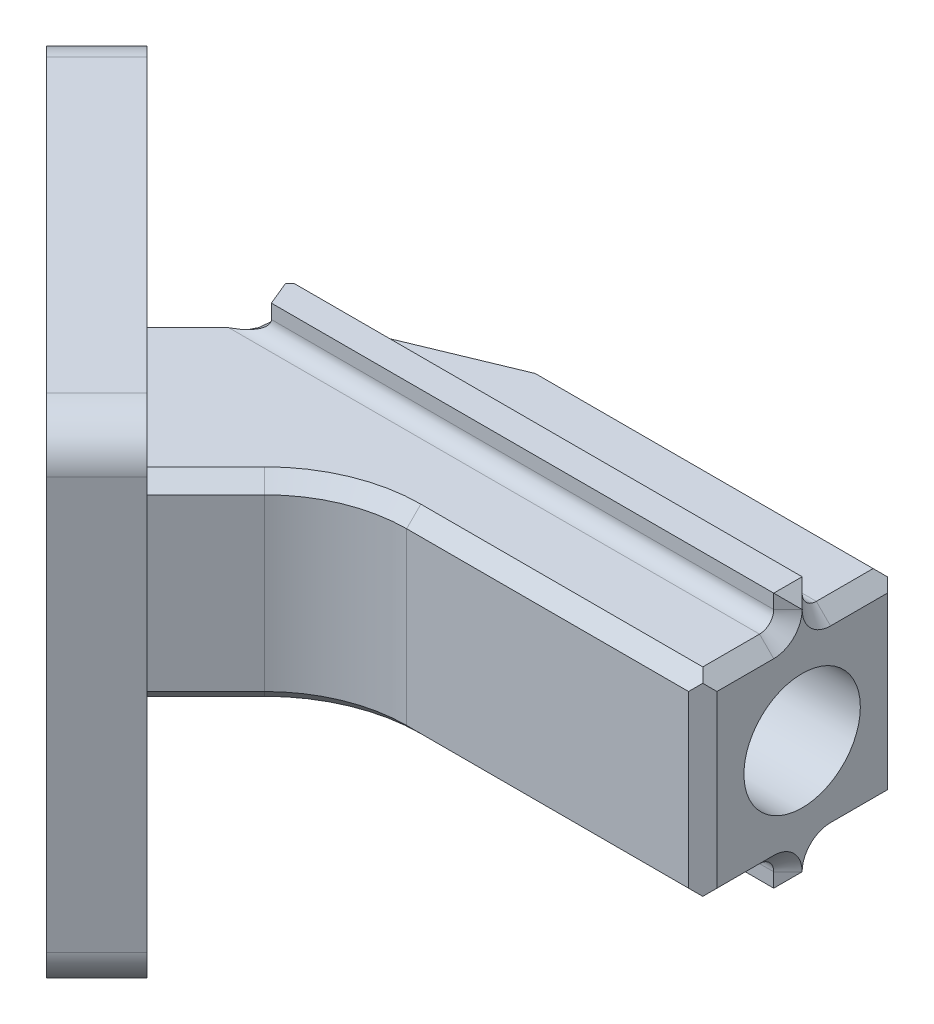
ISO-10303-21;
HEADER;
FILE_DESCRIPTION(('STEP AP214'),'2;1');
FILE_NAME('part.step','',(''),(''),'','','');
FILE_SCHEMA(('AUTOMOTIVE_DESIGN { 1 0 10303 214 1 1 1 1 }'));
ENDSEC;
DATA;
#1=APPLICATION_CONTEXT('core data for automotive mechanical design processes');
#2=APPLICATION_PROTOCOL_DEFINITION('international standard','automotive_design',2000,#1);
#3=PRODUCT_CONTEXT('',#1,'mechanical');
#4=PRODUCT('Part','Part','',(#3));
#5=PRODUCT_RELATED_PRODUCT_CATEGORY('part','',(#4));
#6=PRODUCT_DEFINITION_FORMATION('','',#4);
#7=PRODUCT_DEFINITION_CONTEXT('part definition',#1,'design');
#8=PRODUCT_DEFINITION('design','',#6,#7);
#9=PRODUCT_DEFINITION_SHAPE('','',#8);
#10=(LENGTH_UNIT() NAMED_UNIT(*) SI_UNIT(.MILLI.,.METRE.));
#11=(NAMED_UNIT(*) PLANE_ANGLE_UNIT() SI_UNIT($,.RADIAN.));
#12=(NAMED_UNIT(*) SI_UNIT($,.STERADIAN.) SOLID_ANGLE_UNIT());
#13=UNCERTAINTY_MEASURE_WITH_UNIT(LENGTH_MEASURE(1.E-05),#10,'distance_accuracy_value','');
#14=(GEOMETRIC_REPRESENTATION_CONTEXT(3) GLOBAL_UNCERTAINTY_ASSIGNED_CONTEXT((#13)) GLOBAL_UNIT_ASSIGNED_CONTEXT((#10,
#11,#12)) REPRESENTATION_CONTEXT('',''));
#15=CARTESIAN_POINT('',(0.,0.,0.));
#16=DIRECTION('',(0.,0.,1.));
#17=DIRECTION('',(1.,0.,0.));
#18=AXIS2_PLACEMENT_3D('',#15,#16,#17);
#19=CARTESIAN_POINT('',(0.,0.,0.));
#20=DIRECTION('',(0.,1.,0.));
#21=DIRECTION('',(0.,0.,1.));
#22=AXIS2_PLACEMENT_3D('',#19,#20,#21);
#23=PLANE('',#22);
#24=DIRECTION('',(-1.,0.,0.));
#25=VECTOR('',#24,1.);
#26=CARTESIAN_POINT('',(25.,0.,-5.));
#27=LINE('',#26,#25);
#28=CARTESIAN_POINT('',(-13.3847763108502,0.,-5.));
#29=VERTEX_POINT('',#28);
#30=CARTESIAN_POINT('',(24.,0.,-5.));
#31=VERTEX_POINT('',#30);
#32=EDGE_CURVE('E1029',#29,#31,#27,.F.);
#33=ORIENTED_EDGE('',*,*,#32,.T.);
#34=DIRECTION('',(0.,0.,1.));
#35=VECTOR('',#34,1.);
#36=CARTESIAN_POINT('',(24.,0.,0.));
#37=LINE('',#36,#35);
#38=CARTESIAN_POINT('',(24.,0.,-0.999999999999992));
#39=VERTEX_POINT('',#38);
#40=EDGE_CURVE('E1038',#31,#39,#37,.T.);
#41=ORIENTED_EDGE('',*,*,#40,.T.);
#42=DIRECTION('',(-1.,0.,0.));
#43=VECTOR('',#42,1.);
#44=CARTESIAN_POINT('',(0.,0.,-0.999999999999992));
#45=LINE('',#44,#43);
#46=CARTESIAN_POINT('',(4.14213562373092,0.,-0.999999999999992));
#47=VERTEX_POINT('',#46);
#48=EDGE_CURVE('E1955',#39,#47,#45,.T.);
#49=ORIENTED_EDGE('',*,*,#48,.T.);
#50=CARTESIAN_POINT('',(4.14213562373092,0.,10.));
#51=DIRECTION('',(0.,1.,0.));
#52=DIRECTION('',(0.,0.,1.));
#53=AXIS2_PLACEMENT_3D('',#50,#51,#52);
#54=CIRCLE('',#53,11.);
#55=CARTESIAN_POINT('',(-3.63603896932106,0.,2.22182540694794));
#56=VERTEX_POINT('',#55);
#57=EDGE_CURVE('E1952',#47,#56,#54,.T.);
#58=ORIENTED_EDGE('',*,*,#57,.T.);
#59=DIRECTION('',(-0.707106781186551,0.,0.707106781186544));
#60=VECTOR('',#59,1.);
#61=CARTESIAN_POINT('',(-7.77817459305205,0.,6.36396103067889));
#62=LINE('',#61,#60);
#63=CARTESIAN_POINT('',(-7.77817459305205,0.,6.36396103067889));
#64=VERTEX_POINT('',#63);
#65=EDGE_CURVE('E1944',#56,#64,#62,.T.);
#66=ORIENTED_EDGE('',*,*,#65,.T.);
#67=DIRECTION('',(-0.707106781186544,0.,-0.707106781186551));
#68=VECTOR('',#67,1.);
#69=CARTESIAN_POINT('',(-7.07106781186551,0.,7.07106781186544));
#70=LINE('',#69,#68);
#71=CARTESIAN_POINT('',(-8.36396103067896,0.,5.77817459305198));
#72=VERTEX_POINT('',#71);
#73=EDGE_CURVE('E837',#64,#72,#70,.T.);
#74=ORIENTED_EDGE('',*,*,#73,.T.);
#75=DIRECTION('',(0.707106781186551,0.,-0.707106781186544));
#76=VECTOR('',#75,1.);
#77=CARTESIAN_POINT('',(-10.4852813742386,0.,7.89949493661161));
#78=LINE('',#77,#76);
#79=CARTESIAN_POINT('',(-10.4852813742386,0.,7.89949493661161));
#80=VERTEX_POINT('',#79);
#81=EDGE_CURVE('E1263',#72,#80,#78,.F.);
#82=ORIENTED_EDGE('',*,*,#81,.T.);
#83=DIRECTION('',(0.707106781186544,0.,0.707106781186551));
#84=VECTOR('',#83,1.);
#85=CARTESIAN_POINT('',(-9.19238815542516,0.,9.19238815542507));
#86=LINE('',#85,#84);
#87=CARTESIAN_POINT('',(-17.7989898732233,0.,0.585786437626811));
#88=VERTEX_POINT('',#87);
#89=EDGE_CURVE('E688',#88,#80,#86,.T.);
#90=ORIENTED_EDGE('',*,*,#89,.F.);
#91=DIRECTION('',(0.707106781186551,0.,-0.707106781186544));
#92=VECTOR('',#91,1.);
#93=CARTESIAN_POINT('',(-8.60660171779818,0.,-8.60660171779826));
#94=LINE('',#93,#92);
#95=CARTESIAN_POINT('',(-15.6776695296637,0.,-1.53553390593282));
#96=VERTEX_POINT('',#95);
#97=EDGE_CURVE('E1266',#88,#96,#94,.T.);
#98=ORIENTED_EDGE('',*,*,#97,.T.);
#99=CARTESIAN_POINT('',(-16.2634559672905,0.,-2.12132034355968));
#100=VERTEX_POINT('',#99);
#101=EDGE_CURVE('E828',#96,#100,#70,.T.);
#102=ORIENTED_EDGE('',*,*,#101,.T.);
#103=DIRECTION('',(0.707106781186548,0.,-0.707106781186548));
#104=VECTOR('',#103,1.);
#105=CARTESIAN_POINT('',(-9.19238815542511,0.,-9.19238815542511));
#106=LINE('',#105,#104);
#107=EDGE_CURVE('E1958',#100,#29,#106,.T.);
#108=ORIENTED_EDGE('',*,*,#107,.T.);
#109=EDGE_LOOP('',(#33,#41,#49,#58,#66,#74,#82,#90,#98,#102,#108));
#110=FACE_BOUND('',#109,.T.);
#111=ADVANCED_FACE('F145',(#110),#23,.F.);
#112=DIRECTION('',(1.,0.,0.));
#113=VECTOR('',#112,1.);
#114=CARTESIAN_POINT('',(25.,0.,-13.));
#115=LINE('',#114,#113);
#116=CARTESIAN_POINT('',(0.198912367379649,0.,-13.));
#117=VERTEX_POINT('',#116);
#118=CARTESIAN_POINT('',(24.,0.,-13.));
#119=VERTEX_POINT('',#118);
#120=EDGE_CURVE('E1563',#117,#119,#115,.T.);
#121=ORIENTED_EDGE('',*,*,#120,.T.);
#122=DIRECTION('',(0.,0.,1.));
#123=VECTOR('',#122,1.);
#124=CARTESIAN_POINT('',(24.,0.,0.));
#125=LINE('',#124,#123);
#126=CARTESIAN_POINT('',(24.,0.,-9.));
#127=VERTEX_POINT('',#126);
#128=EDGE_CURVE('E156',#119,#127,#125,.T.);
#129=ORIENTED_EDGE('',*,*,#128,.T.);
#130=DIRECTION('',(1.,0.,0.));
#131=VECTOR('',#130,1.);
#132=CARTESIAN_POINT('',(-11.7989898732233,0.,-9.));
#133=LINE('',#132,#131);
#134=CARTESIAN_POINT('',(-9.45794188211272,0.,-9.));
#135=VERTEX_POINT('',#134);
#136=EDGE_CURVE('E872',#127,#135,#133,.F.);
#137=ORIENTED_EDGE('',*,*,#136,.T.);
#138=DIRECTION('',(0.923879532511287,0.,-0.38268343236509));
#139=VECTOR('',#138,1.);
#140=CARTESIAN_POINT('',(0.382683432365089,0.,-13.0761204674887));
#141=LINE('',#140,#139);
#142=EDGE_CURVE('E1555',#135,#117,#141,.T.);
#143=ORIENTED_EDGE('',*,*,#142,.T.);
#144=EDGE_LOOP('',(#121,#129,#137,#143));
#145=FACE_BOUND('',#144,.T.);
#146=ADVANCED_FACE('F2061',(#145),#23,.F.);
#147=CARTESIAN_POINT('',(0.,14.,0.));
#148=DIRECTION('',(0.,1.,0.));
#149=DIRECTION('',(0.,0.,1.));
#150=AXIS2_PLACEMENT_3D('',#147,#148,#149);
#151=PLANE('',#150);
#152=DIRECTION('',(-1.,0.,0.));
#153=VECTOR('',#152,1.);
#154=CARTESIAN_POINT('',(0.,14.,-9.));
#155=LINE('',#154,#153);
#156=CARTESIAN_POINT('',(-9.4579418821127,14.,-9.));
#157=VERTEX_POINT('',#156);
#158=CARTESIAN_POINT('',(24.,14.,-9.));
#159=VERTEX_POINT('',#158);
#160=EDGE_CURVE('E1104',#157,#159,#155,.F.);
#161=ORIENTED_EDGE('',*,*,#160,.T.);
#162=DIRECTION('',(0.,0.,-1.));
#163=VECTOR('',#162,1.);
#164=CARTESIAN_POINT('',(24.,14.,-13.));
#165=LINE('',#164,#163);
#166=CARTESIAN_POINT('',(24.,14.,-13.));
#167=VERTEX_POINT('',#166);
#168=EDGE_CURVE('E1056',#159,#167,#165,.T.);
#169=ORIENTED_EDGE('',*,*,#168,.T.);
#170=DIRECTION('',(-1.,0.,0.));
#171=VECTOR('',#170,1.);
#172=CARTESIAN_POINT('',(0.,14.,-13.));
#173=LINE('',#172,#171);
#174=CARTESIAN_POINT('',(0.19891236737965,14.,-13.));
#175=VERTEX_POINT('',#174);
#176=EDGE_CURVE('E1073',#167,#175,#173,.T.);
#177=ORIENTED_EDGE('',*,*,#176,.T.);
#178=DIRECTION('',(-0.923879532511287,0.,0.38268343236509));
#179=VECTOR('',#178,1.);
#180=CARTESIAN_POINT('',(-4.56706403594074,14.,-11.0258679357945));
#181=LINE('',#180,#179);
#182=EDGE_CURVE('E1097',#175,#157,#181,.T.);
#183=ORIENTED_EDGE('',*,*,#182,.T.);
#184=EDGE_LOOP('',(#161,#169,#177,#183));
#185=FACE_BOUND('',#184,.T.);
#186=ADVANCED_FACE('F2068',(#185),#151,.T.);
#187=DIRECTION('',(1.,0.,0.));
#188=VECTOR('',#187,1.);
#189=CARTESIAN_POINT('',(25.,14.,-1.00000000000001));
#190=LINE('',#189,#188);
#191=CARTESIAN_POINT('',(4.14213562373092,14.,-1.00000000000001));
#192=VERTEX_POINT('',#191);
#193=CARTESIAN_POINT('',(24.,14.,-1.00000000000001));
#194=VERTEX_POINT('',#193);
#195=EDGE_CURVE('E1984',#192,#194,#190,.T.);
#196=ORIENTED_EDGE('',*,*,#195,.T.);
#197=DIRECTION('',(0.,0.,-1.));
#198=VECTOR('',#197,1.);
#199=CARTESIAN_POINT('',(24.,14.,-5.));
#200=LINE('',#199,#198);
#201=CARTESIAN_POINT('',(24.,14.,-5.));
#202=VERTEX_POINT('',#201);
#203=EDGE_CURVE('E2013',#194,#202,#200,.T.);
#204=ORIENTED_EDGE('',*,*,#203,.T.);
#205=DIRECTION('',(1.,0.,0.));
#206=VECTOR('',#205,1.);
#207=CARTESIAN_POINT('',(0.,14.,-5.));
#208=LINE('',#207,#206);
#209=CARTESIAN_POINT('',(-13.3847763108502,14.,-4.99999999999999));
#210=VERTEX_POINT('',#209);
#211=EDGE_CURVE('E1011',#202,#210,#208,.F.);
#212=ORIENTED_EDGE('',*,*,#211,.T.);
#213=DIRECTION('',(-0.707106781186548,0.,0.707106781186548));
#214=VECTOR('',#213,1.);
#215=CARTESIAN_POINT('',(-16.2634559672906,14.,-2.12132034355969));
#216=LINE('',#215,#214);
#217=CARTESIAN_POINT('',(-16.2634559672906,14.,-2.1213203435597));
#218=VERTEX_POINT('',#217);
#219=EDGE_CURVE('E1093',#210,#218,#216,.T.);
#220=ORIENTED_EDGE('',*,*,#219,.T.);
#221=DIRECTION('',(-0.707106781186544,0.,-0.707106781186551));
#222=VECTOR('',#221,1.);
#223=CARTESIAN_POINT('',(-7.07106781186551,14.,7.07106781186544));
#224=LINE('',#223,#222);
#225=CARTESIAN_POINT('',(-15.6776695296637,14.,-1.53553390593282));
#226=VERTEX_POINT('',#225);
#227=EDGE_CURVE('E836',#226,#218,#224,.T.);
#228=ORIENTED_EDGE('',*,*,#227,.F.);
#229=DIRECTION('',(0.707106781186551,0.,-0.707106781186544));
#230=VECTOR('',#229,1.);
#231=CARTESIAN_POINT('',(-17.7989898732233,14.,0.585786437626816));
#232=LINE('',#231,#230);
#233=CARTESIAN_POINT('',(-17.7989898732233,14.,0.585786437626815));
#234=VERTEX_POINT('',#233);
#235=EDGE_CURVE('E1231',#226,#234,#232,.F.);
#236=ORIENTED_EDGE('',*,*,#235,.T.);
#237=DIRECTION('',(-0.707106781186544,0.,-0.707106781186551));
#238=VECTOR('',#237,1.);
#239=CARTESIAN_POINT('',(-9.19238815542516,14.,9.19238815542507));
#240=LINE('',#239,#238);
#241=CARTESIAN_POINT('',(-10.4852813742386,14.,7.8994949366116));
#242=VERTEX_POINT('',#241);
#243=EDGE_CURVE('E777',#242,#234,#240,.T.);
#244=ORIENTED_EDGE('',*,*,#243,.F.);
#245=DIRECTION('',(0.707106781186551,0.,-0.707106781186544));
#246=VECTOR('',#245,1.);
#247=CARTESIAN_POINT('',(-1.29289321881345,14.,-1.29289321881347));
#248=LINE('',#247,#246);
#249=CARTESIAN_POINT('',(-8.36396103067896,14.,5.77817459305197));
#250=VERTEX_POINT('',#249);
#251=EDGE_CURVE('E1227',#242,#250,#248,.T.);
#252=ORIENTED_EDGE('',*,*,#251,.T.);
#253=CARTESIAN_POINT('',(-7.77817459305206,14.,6.36396103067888));
#254=VERTEX_POINT('',#253);
#255=EDGE_CURVE('E832',#254,#250,#224,.T.);
#256=ORIENTED_EDGE('',*,*,#255,.F.);
#257=DIRECTION('',(0.707106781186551,0.,-0.707106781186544));
#258=VECTOR('',#257,1.);
#259=CARTESIAN_POINT('',(-0.70710678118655,14.,-0.707106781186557));
#260=LINE('',#259,#258);
#261=CARTESIAN_POINT('',(-3.63603896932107,14.,2.22182540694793));
#262=VERTEX_POINT('',#261);
#263=EDGE_CURVE('E1099',#254,#262,#260,.T.);
#264=ORIENTED_EDGE('',*,*,#263,.T.);
#265=CARTESIAN_POINT('',(4.14213562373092,14.,10.));
#266=DIRECTION('',(0.,1.,0.));
#267=DIRECTION('',(0.,0.,1.));
#268=AXIS2_PLACEMENT_3D('',#265,#266,#267);
#269=CIRCLE('',#268,11.);
#270=EDGE_CURVE('E1993',#262,#192,#269,.F.);
#271=ORIENTED_EDGE('',*,*,#270,.T.);
#272=EDGE_LOOP('',(#196,#204,#212,#220,#228,#236,#244,#252,#256,#264,#271));
#273=FACE_BOUND('',#272,.T.);
#274=ADVANCED_FACE('F2000',(#273),#151,.T.);
#275=CARTESIAN_POINT('',(-7.07106781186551,0.,7.07106781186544));
#276=DIRECTION('',(-0.707106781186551,0.,0.707106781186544));
#277=DIRECTION('',(0.707106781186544,0.,0.707106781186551));
#278=AXIS2_PLACEMENT_3D('',#275,#276,#277);
#279=PLANE('',#278);
#280=DIRECTION('',(0.,-1.,0.));
#281=VECTOR('',#280,1.);
#282=CARTESIAN_POINT('',(-24.3951839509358,24.5,-10.2530483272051));
#283=LINE('',#282,#281);
#284=CARTESIAN_POINT('',(-24.3951839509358,21.5,-10.2530483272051));
#285=VERTEX_POINT('',#284);
#286=CARTESIAN_POINT('',(-24.3951839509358,-7.5,-10.2530483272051));
#287=VERTEX_POINT('',#286);
#288=EDGE_CURVE('E817',#285,#287,#283,.T.);
#289=ORIENTED_EDGE('',*,*,#288,.F.);
#290=CARTESIAN_POINT('',(-22.2738636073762,21.5,-8.13172798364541));
#291=DIRECTION('',(-0.707106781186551,0.,0.707106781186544));
#292=DIRECTION('',(0.707106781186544,0.,0.707106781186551));
#293=AXIS2_PLACEMENT_3D('',#290,#291,#292);
#294=CIRCLE('',#293,3.);
#295=CARTESIAN_POINT('',(-22.2738636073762,24.5,-8.13172798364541));
#296=VERTEX_POINT('',#295);
#297=EDGE_CURVE('E1147',#285,#296,#294,.F.);
#298=ORIENTED_EDGE('',*,*,#297,.T.);
#299=DIRECTION('',(-0.707106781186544,0.,-0.707106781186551));
#300=VECTOR('',#299,1.);
#301=CARTESIAN_POINT('',(-24.3951839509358,24.5,-10.2530483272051));
#302=LINE('',#301,#300);
#303=CARTESIAN_POINT('',(-1.76776695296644,24.5,12.3743686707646));
#304=VERTEX_POINT('',#303);
#305=EDGE_CURVE('E813',#304,#296,#302,.T.);
#306=ORIENTED_EDGE('',*,*,#305,.F.);
#307=CARTESIAN_POINT('',(-1.76776695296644,21.5,12.3743686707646));
#308=DIRECTION('',(-0.707106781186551,0.,0.707106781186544));
#309=DIRECTION('',(0.707106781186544,0.,0.707106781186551));
#310=AXIS2_PLACEMENT_3D('',#307,#308,#309);
#311=CIRCLE('',#310,3.);
#312=CARTESIAN_POINT('',(0.353553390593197,21.5,14.4956890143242));
#313=VERTEX_POINT('',#312);
#314=EDGE_CURVE('E1150',#304,#313,#311,.F.);
#315=ORIENTED_EDGE('',*,*,#314,.T.);
#316=DIRECTION('',(0.,1.,0.));
#317=VECTOR('',#316,1.);
#318=CARTESIAN_POINT('',(0.353553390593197,24.5,14.4956890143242));
#319=LINE('',#318,#317);
#320=CARTESIAN_POINT('',(0.353553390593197,-7.5,14.4956890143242));
#321=VERTEX_POINT('',#320);
#322=EDGE_CURVE('E781',#321,#313,#319,.T.);
#323=ORIENTED_EDGE('',*,*,#322,.F.);
#324=CARTESIAN_POINT('',(-1.76776695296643,-7.5,12.3743686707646));
#325=DIRECTION('',(-0.707106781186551,0.,0.707106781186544));
#326=DIRECTION('',(0.707106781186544,0.,0.707106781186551));
#327=AXIS2_PLACEMENT_3D('',#324,#325,#326);
#328=CIRCLE('',#327,3.);
#329=CARTESIAN_POINT('',(-1.76776695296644,-10.5,12.3743686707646));
#330=VERTEX_POINT('',#329);
#331=EDGE_CURVE('E1153',#321,#330,#328,.F.);
#332=ORIENTED_EDGE('',*,*,#331,.T.);
#333=DIRECTION('',(0.707106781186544,0.,0.707106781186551));
#334=VECTOR('',#333,1.);
#335=CARTESIAN_POINT('',(-24.3951839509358,-10.5,-10.2530483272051));
#336=LINE('',#335,#334);
#337=CARTESIAN_POINT('',(-22.2738636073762,-10.5,-8.13172798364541));
#338=VERTEX_POINT('',#337);
#339=EDGE_CURVE('E797',#338,#330,#336,.T.);
#340=ORIENTED_EDGE('',*,*,#339,.F.);
#341=CARTESIAN_POINT('',(-22.2738636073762,-7.5,-8.13172798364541));
#342=DIRECTION('',(-0.707106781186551,0.,0.707106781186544));
#343=DIRECTION('',(0.707106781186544,0.,0.707106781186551));
#344=AXIS2_PLACEMENT_3D('',#341,#342,#343);
#345=CIRCLE('',#344,3.);
#346=EDGE_CURVE('E1156',#338,#287,#345,.F.);
#347=ORIENTED_EDGE('',*,*,#346,.T.);
#348=EDGE_LOOP('',(#289,#298,#306,#315,#323,#332,#340,#347));
#349=FACE_BOUND('',#348,.T.);
#350=DIRECTION('',(0.499999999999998,-0.707106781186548,0.500000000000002));
#351=VECTOR('',#350,1.);
#352=CARTESIAN_POINT('',(-7.57106781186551,-0.70710678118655,6.57106781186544));
#353=LINE('',#352,#351);
#354=CARTESIAN_POINT('',(-21.7738636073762,19.3786796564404,-7.63172798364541));
#355=VERTEX_POINT('',#354);
#356=CARTESIAN_POINT('',(-17.1776695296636,12.8786796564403,-3.03553390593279));
#357=VERTEX_POINT('',#356);
#358=EDGE_CURVE('E733',#355,#357,#353,.T.);
#359=ORIENTED_EDGE('',*,*,#358,.F.);
#360=CARTESIAN_POINT('',(-22.2738636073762,18.6715728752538,-8.13172798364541));
#361=DIRECTION('',(-0.707106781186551,0.,0.707106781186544));
#362=DIRECTION('',(0.707106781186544,0.,0.707106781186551));
#363=AXIS2_PLACEMENT_3D('',#360,#361,#362);
#364=CIRCLE('',#363,1.);
#365=CARTESIAN_POINT('',(-22.9809703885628,18.6715728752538,-8.83883476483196));
#366=VERTEX_POINT('',#365);
#367=EDGE_CURVE('E1294',#355,#366,#364,.T.);
#368=ORIENTED_EDGE('',*,*,#367,.T.);
#369=DIRECTION('',(0.,-1.,0.));
#370=VECTOR('',#369,1.);
#371=CARTESIAN_POINT('',(-22.9809703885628,0.,-8.83883476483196));
#372=LINE('',#371,#370);
#373=CARTESIAN_POINT('',(-22.9809703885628,-4.6715728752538,-8.83883476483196));
#374=VERTEX_POINT('',#373);
#375=EDGE_CURVE('E729',#366,#374,#372,.T.);
#376=ORIENTED_EDGE('',*,*,#375,.T.);
#377=CARTESIAN_POINT('',(-22.2738636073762,-4.6715728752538,-8.13172798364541));
#378=DIRECTION('',(-0.707106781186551,0.,0.707106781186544));
#379=DIRECTION('',(0.707106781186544,0.,0.707106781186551));
#380=AXIS2_PLACEMENT_3D('',#377,#378,#379);
#381=CIRCLE('',#380,1.);
#382=CARTESIAN_POINT('',(-21.7738636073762,-5.37867965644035,-7.63172798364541));
#383=VERTEX_POINT('',#382);
#384=EDGE_CURVE('E1290',#374,#383,#381,.T.);
#385=ORIENTED_EDGE('',*,*,#384,.T.);
#386=DIRECTION('',(-0.499999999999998,-0.707106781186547,-0.500000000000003));
#387=VECTOR('',#386,1.);
#388=CARTESIAN_POINT('',(-12.5208152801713,7.70710678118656,1.62132034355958));
#389=LINE('',#388,#387);
#390=CARTESIAN_POINT('',(-17.1776695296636,1.12132034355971,-3.03553390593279));
#391=VERTEX_POINT('',#390);
#392=EDGE_CURVE('E717',#391,#383,#389,.T.);
#393=ORIENTED_EDGE('',*,*,#392,.F.);
#394=CARTESIAN_POINT('',(-17.6776695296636,1.82842712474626,-3.53553390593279));
#395=DIRECTION('',(-0.707106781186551,0.,0.707106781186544));
#396=DIRECTION('',(0.707106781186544,0.,0.707106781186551));
#397=AXIS2_PLACEMENT_3D('',#394,#395,#396);
#398=CIRCLE('',#397,1.);
#399=CARTESIAN_POINT('',(-16.9705627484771,1.82842712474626,-2.82842712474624));
#400=VERTEX_POINT('',#399);
#401=EDGE_CURVE('E1166',#391,#400,#398,.T.);
#402=ORIENTED_EDGE('',*,*,#401,.T.);
#403=DIRECTION('',(0.,-1.,0.));
#404=VECTOR('',#403,1.);
#405=CARTESIAN_POINT('',(-16.9705627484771,14.,-2.82842712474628));
#406=LINE('',#405,#404);
#407=CARTESIAN_POINT('',(-16.9705627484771,1.00000000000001,-2.82842712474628));
#408=VERTEX_POINT('',#407);
#409=EDGE_CURVE('E843',#400,#408,#406,.T.);
#410=ORIENTED_EDGE('',*,*,#409,.T.);
#411=DIRECTION('',(-0.499999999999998,0.707106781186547,-0.500000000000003));
#412=VECTOR('',#411,1.);
#413=CARTESIAN_POINT('',(-11.667261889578,-6.49999999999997,2.47487373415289));
#414=LINE('',#413,#412);
#415=EDGE_CURVE('E2100',#408,#100,#414,.F.);
#416=ORIENTED_EDGE('',*,*,#415,.T.);
#417=ORIENTED_EDGE('',*,*,#101,.F.);
#418=CARTESIAN_POINT('',(-15.6776695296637,-1.,-1.53553390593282));
#419=DIRECTION('',(-0.707106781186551,0.,0.707106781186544));
#420=DIRECTION('',(0.707106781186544,0.,0.707106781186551));
#421=AXIS2_PLACEMENT_3D('',#418,#419,#420);
#422=CIRCLE('',#421,1.);
#423=CARTESIAN_POINT('',(-16.1776695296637,-0.292893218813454,-2.03553390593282));
#424=VERTEX_POINT('',#423);
#425=EDGE_CURVE('E1187',#96,#424,#422,.T.);
#426=ORIENTED_EDGE('',*,*,#425,.T.);
#427=DIRECTION('',(-0.499999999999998,-0.707106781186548,-0.500000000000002));
#428=VECTOR('',#427,1.);
#429=CARTESIAN_POINT('',(-11.5208152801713,6.29289321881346,2.62132034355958));
#430=LINE('',#429,#428);
#431=CARTESIAN_POINT('',(-20.7738636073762,-6.79289321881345,-6.6317279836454));
#432=VERTEX_POINT('',#431);
#433=EDGE_CURVE('E693',#424,#432,#430,.T.);
#434=ORIENTED_EDGE('',*,*,#433,.T.);
#435=CARTESIAN_POINT('',(-20.2738636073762,-7.5,-6.1317279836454));
#436=DIRECTION('',(-0.707106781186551,0.,0.707106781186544));
#437=DIRECTION('',(0.707106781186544,0.,0.707106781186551));
#438=AXIS2_PLACEMENT_3D('',#435,#436,#437);
#439=CIRCLE('',#438,1.);
#440=CARTESIAN_POINT('',(-20.2738636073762,-8.5,-6.1317279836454));
#441=VERTEX_POINT('',#440);
#442=EDGE_CURVE('E1287',#432,#441,#439,.T.);
#443=ORIENTED_EDGE('',*,*,#442,.T.);
#444=DIRECTION('',(-0.707106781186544,0.,-0.707106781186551));
#445=VECTOR('',#444,1.);
#446=CARTESIAN_POINT('',(-7.07106781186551,-8.5,7.07106781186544));
#447=LINE('',#446,#445);
#448=CARTESIAN_POINT('',(-3.76776695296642,-8.5,10.3743686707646));
#449=VERTEX_POINT('',#448);
#450=EDGE_CURVE('E706',#449,#441,#447,.T.);
#451=ORIENTED_EDGE('',*,*,#450,.F.);
#452=CARTESIAN_POINT('',(-3.76776695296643,-7.5,10.3743686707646));
#453=DIRECTION('',(-0.707106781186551,0.,0.707106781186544));
#454=DIRECTION('',(0.707106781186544,0.,0.707106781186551));
#455=AXIS2_PLACEMENT_3D('',#452,#453,#454);
#456=CIRCLE('',#455,1.);
#457=CARTESIAN_POINT('',(-3.26776695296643,-6.79289321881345,10.8743686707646));
#458=VERTEX_POINT('',#457);
#459=EDGE_CURVE('E1283',#449,#458,#456,.T.);
#460=ORIENTED_EDGE('',*,*,#459,.T.);
#461=DIRECTION('',(0.499999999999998,-0.707106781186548,0.500000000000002));
#462=VECTOR('',#461,1.);
#463=CARTESIAN_POINT('',(-7.57106781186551,-0.70710678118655,6.57106781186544));
#464=LINE('',#463,#462);
#465=CARTESIAN_POINT('',(-7.86396103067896,-0.292893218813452,6.27817459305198));
#466=VERTEX_POINT('',#465);
#467=EDGE_CURVE('E687',#466,#458,#464,.T.);
#468=ORIENTED_EDGE('',*,*,#467,.F.);
#469=CARTESIAN_POINT('',(-8.36396103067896,-1.,5.77817459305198));
#470=DIRECTION('',(-0.707106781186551,0.,0.707106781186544));
#471=DIRECTION('',(0.707106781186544,0.,0.707106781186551));
#472=AXIS2_PLACEMENT_3D('',#469,#470,#471);
#473=CIRCLE('',#472,1.);
#474=EDGE_CURVE('E1190',#466,#72,#473,.T.);
#475=ORIENTED_EDGE('',*,*,#474,.T.);
#476=ORIENTED_EDGE('',*,*,#73,.F.);
#477=DIRECTION('',(0.499999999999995,0.707106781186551,0.5));
#478=VECTOR('',#477,1.);
#479=CARTESIAN_POINT('',(-7.42462120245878,0.499999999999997,6.71751442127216));
#480=LINE('',#479,#478);
#481=CARTESIAN_POINT('',(-7.07106781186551,1.,7.07106781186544));
#482=VERTEX_POINT('',#481);
#483=EDGE_CURVE('E2096',#64,#482,#480,.T.);
#484=ORIENTED_EDGE('',*,*,#483,.T.);
#485=DIRECTION('',(0.,-1.,0.));
#486=VECTOR('',#485,1.);
#487=CARTESIAN_POINT('',(-7.07106781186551,14.,7.07106781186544));
#488=LINE('',#487,#486);
#489=CARTESIAN_POINT('',(-7.07106781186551,1.82842712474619,7.07106781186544));
#490=VERTEX_POINT('',#489);
#491=EDGE_CURVE('E835',#490,#482,#488,.T.);
#492=ORIENTED_EDGE('',*,*,#491,.F.);
#493=CARTESIAN_POINT('',(-6.36396103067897,1.82842712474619,7.77817459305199));
#494=DIRECTION('',(-0.707106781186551,0.,0.707106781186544));
#495=DIRECTION('',(0.707106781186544,0.,0.707106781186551));
#496=AXIS2_PLACEMENT_3D('',#493,#494,#495);
#497=CIRCLE('',#496,1.);
#498=CARTESIAN_POINT('',(-6.86396103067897,1.12132034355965,7.27817459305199));
#499=VERTEX_POINT('',#498);
#500=EDGE_CURVE('E1180',#490,#499,#497,.T.);
#501=ORIENTED_EDGE('',*,*,#500,.T.);
#502=DIRECTION('',(0.499999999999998,-0.707106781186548,0.500000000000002));
#503=VECTOR('',#502,1.);
#504=CARTESIAN_POINT('',(-6.57106781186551,0.707106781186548,7.57106781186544));
#505=LINE('',#504,#503);
#506=CARTESIAN_POINT('',(-2.26776695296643,-5.37867965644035,11.8743686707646));
#507=VERTEX_POINT('',#506);
#508=EDGE_CURVE('E703',#499,#507,#505,.T.);
#509=ORIENTED_EDGE('',*,*,#508,.T.);
#510=CARTESIAN_POINT('',(-1.76776695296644,-4.6715728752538,12.3743686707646));
#511=DIRECTION('',(-0.707106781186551,0.,0.707106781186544));
#512=DIRECTION('',(0.707106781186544,0.,0.707106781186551));
#513=AXIS2_PLACEMENT_3D('',#510,#511,#512);
#514=CIRCLE('',#513,1.);
#515=CARTESIAN_POINT('',(-1.06066017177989,-4.6715728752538,13.0814754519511));
#516=VERTEX_POINT('',#515);
#517=EDGE_CURVE('E1280',#507,#516,#514,.T.);
#518=ORIENTED_EDGE('',*,*,#517,.T.);
#519=DIRECTION('',(0.,-1.,0.));
#520=VECTOR('',#519,1.);
#521=CARTESIAN_POINT('',(-1.06066017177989,0.,13.0814754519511));
#522=LINE('',#521,#520);
#523=CARTESIAN_POINT('',(-1.06066017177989,18.6715728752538,13.0814754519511));
#524=VERTEX_POINT('',#523);
#525=EDGE_CURVE('E744',#524,#516,#522,.T.);
#526=ORIENTED_EDGE('',*,*,#525,.F.);
#527=CARTESIAN_POINT('',(-1.76776695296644,18.6715728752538,12.3743686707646));
#528=DIRECTION('',(-0.707106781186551,0.,0.707106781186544));
#529=DIRECTION('',(0.707106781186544,0.,0.707106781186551));
#530=AXIS2_PLACEMENT_3D('',#527,#528,#529);
#531=CIRCLE('',#530,1.);
#532=CARTESIAN_POINT('',(-2.26776695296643,19.3786796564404,11.8743686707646));
#533=VERTEX_POINT('',#532);
#534=EDGE_CURVE('E1277',#524,#533,#531,.T.);
#535=ORIENTED_EDGE('',*,*,#534,.T.);
#536=DIRECTION('',(-0.499999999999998,-0.707106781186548,-0.500000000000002));
#537=VECTOR('',#536,1.);
#538=CARTESIAN_POINT('',(-11.5208152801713,6.29289321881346,2.62132034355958));
#539=LINE('',#538,#537);
#540=CARTESIAN_POINT('',(-6.86396103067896,12.8786796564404,7.27817459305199));
#541=VERTEX_POINT('',#540);
#542=EDGE_CURVE('E757',#533,#541,#539,.T.);
#543=ORIENTED_EDGE('',*,*,#542,.T.);
#544=CARTESIAN_POINT('',(-6.36396103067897,12.1715728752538,7.77817459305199));
#545=DIRECTION('',(-0.707106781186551,0.,0.707106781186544));
#546=DIRECTION('',(0.707106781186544,0.,0.707106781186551));
#547=AXIS2_PLACEMENT_3D('',#544,#545,#546);
#548=CIRCLE('',#547,1.);
#549=CARTESIAN_POINT('',(-7.07106781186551,12.1715728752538,7.07106781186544));
#550=VERTEX_POINT('',#549);
#551=EDGE_CURVE('E1183',#541,#550,#548,.T.);
#552=ORIENTED_EDGE('',*,*,#551,.T.);
#553=CARTESIAN_POINT('',(-7.07106781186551,13.,7.07106781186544));
#554=VERTEX_POINT('',#553);
#555=EDGE_CURVE('E840',#554,#550,#488,.T.);
#556=ORIENTED_EDGE('',*,*,#555,.F.);
#557=DIRECTION('',(0.499999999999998,-0.707106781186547,0.500000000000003));
#558=VECTOR('',#557,1.);
#559=CARTESIAN_POINT('',(-2.47487373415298,6.5,11.667261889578));
#560=LINE('',#559,#558);
#561=EDGE_CURVE('E973',#554,#254,#560,.F.);
#562=ORIENTED_EDGE('',*,*,#561,.T.);
#563=ORIENTED_EDGE('',*,*,#255,.T.);
#564=CARTESIAN_POINT('',(-8.36396103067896,15.,5.77817459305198));
#565=DIRECTION('',(-0.707106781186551,0.,0.707106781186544));
#566=DIRECTION('',(0.707106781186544,0.,0.707106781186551));
#567=AXIS2_PLACEMENT_3D('',#564,#565,#566);
#568=CIRCLE('',#567,1.);
#569=CARTESIAN_POINT('',(-7.86396103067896,14.2928932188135,6.27817459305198));
#570=VERTEX_POINT('',#569);
#571=EDGE_CURVE('E1177',#250,#570,#568,.T.);
#572=ORIENTED_EDGE('',*,*,#571,.T.);
#573=DIRECTION('',(-0.499999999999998,-0.707106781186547,-0.500000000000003));
#574=VECTOR('',#573,1.);
#575=CARTESIAN_POINT('',(-12.5208152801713,7.70710678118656,1.62132034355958));
#576=LINE('',#575,#574);
#577=CARTESIAN_POINT('',(-3.26776695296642,20.7928932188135,10.8743686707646));
#578=VERTEX_POINT('',#577);
#579=EDGE_CURVE('E769',#578,#570,#576,.T.);
#580=ORIENTED_EDGE('',*,*,#579,.F.);
#581=CARTESIAN_POINT('',(-3.76776695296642,21.5,10.3743686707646));
#582=DIRECTION('',(-0.707106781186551,0.,0.707106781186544));
#583=DIRECTION('',(0.707106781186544,0.,0.707106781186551));
#584=AXIS2_PLACEMENT_3D('',#581,#582,#583);
#585=CIRCLE('',#584,1.);
#586=CARTESIAN_POINT('',(-3.76776695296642,22.5,10.3743686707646));
#587=VERTEX_POINT('',#586);
#588=EDGE_CURVE('E1274',#578,#587,#585,.T.);
#589=ORIENTED_EDGE('',*,*,#588,.T.);
#590=DIRECTION('',(-0.707106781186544,0.,-0.707106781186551));
#591=VECTOR('',#590,1.);
#592=CARTESIAN_POINT('',(-7.07106781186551,22.5,7.07106781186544));
#593=LINE('',#592,#591);
#594=CARTESIAN_POINT('',(-20.2738636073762,22.5,-6.1317279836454));
#595=VERTEX_POINT('',#594);
#596=EDGE_CURVE('E785',#587,#595,#593,.T.);
#597=ORIENTED_EDGE('',*,*,#596,.T.);
#598=CARTESIAN_POINT('',(-20.2738636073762,21.5,-6.1317279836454));
#599=DIRECTION('',(-0.707106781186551,0.,0.707106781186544));
#600=DIRECTION('',(0.707106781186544,0.,0.707106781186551));
#601=AXIS2_PLACEMENT_3D('',#598,#599,#600);
#602=CIRCLE('',#601,1.);
#603=CARTESIAN_POINT('',(-20.7738636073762,20.7928932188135,-6.6317279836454));
#604=VERTEX_POINT('',#603);
#605=EDGE_CURVE('E1297',#595,#604,#602,.T.);
#606=ORIENTED_EDGE('',*,*,#605,.T.);
#607=DIRECTION('',(0.499999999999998,-0.707106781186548,0.500000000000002));
#608=VECTOR('',#607,1.);
#609=CARTESIAN_POINT('',(-6.57106781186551,0.707106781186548,7.57106781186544));
#610=LINE('',#609,#608);
#611=CARTESIAN_POINT('',(-16.1776695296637,14.2928932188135,-2.03553390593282));
#612=VERTEX_POINT('',#611);
#613=EDGE_CURVE('E728',#604,#612,#610,.T.);
#614=ORIENTED_EDGE('',*,*,#613,.T.);
#615=CARTESIAN_POINT('',(-15.6776695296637,15.,-1.53553390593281));
#616=DIRECTION('',(-0.707106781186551,0.,0.707106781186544));
#617=DIRECTION('',(0.707106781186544,0.,0.707106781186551));
#618=AXIS2_PLACEMENT_3D('',#615,#616,#617);
#619=CIRCLE('',#618,1.);
#620=EDGE_CURVE('E1173',#612,#226,#619,.T.);
#621=ORIENTED_EDGE('',*,*,#620,.T.);
#622=ORIENTED_EDGE('',*,*,#227,.T.);
#623=DIRECTION('',(-0.499999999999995,-0.707106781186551,-0.5));
#624=VECTOR('',#623,1.);
#625=CARTESIAN_POINT('',(-16.6170093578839,13.4999999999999,-2.47487373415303));
#626=LINE('',#625,#624);
#627=CARTESIAN_POINT('',(-16.9705627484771,13.,-2.82842712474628));
#628=VERTEX_POINT('',#627);
#629=EDGE_CURVE('E2105',#218,#628,#626,.T.);
#630=ORIENTED_EDGE('',*,*,#629,.T.);
#631=CARTESIAN_POINT('',(-16.9705627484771,12.1715728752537,-2.82842712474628));
#632=VERTEX_POINT('',#631);
#633=EDGE_CURVE('E844',#628,#632,#406,.T.);
#634=ORIENTED_EDGE('',*,*,#633,.T.);
#635=CARTESIAN_POINT('',(-17.6776695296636,12.1715728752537,-3.53553390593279));
#636=DIRECTION('',(-0.707106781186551,0.,0.707106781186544));
#637=DIRECTION('',(0.707106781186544,0.,0.707106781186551));
#638=AXIS2_PLACEMENT_3D('',#635,#636,#637);
#639=CIRCLE('',#638,1.);
#640=EDGE_CURVE('E1170',#632,#357,#639,.T.);
#641=ORIENTED_EDGE('',*,*,#640,.T.);
#642=EDGE_LOOP('',(#359,#368,#376,#385,#393,#402,#410,#416,#417,#426,#434,#443,#451,#460,#468,
#475,#476,#484,#492,#501,#509,#518,#526,#535,#543,#552,#556,#562,#563,#572,#580,#589,#597,#606,
#614,#621,#622,#630,#634,#641));
#643=FACE_BOUND('',#642,.T.);
#644=ADVANCED_FACE('F1453',(#349,#643),#279,.F.);
#645=CARTESIAN_POINT('',(0.,14.,0.));
#646=DIRECTION('',(0.,0.,-1.));
#647=DIRECTION('',(-1.,0.,0.));
#648=AXIS2_PLACEMENT_3D('',#645,#646,#647);
#649=PLANE('',#648);
#650=DIRECTION('',(1.,0.,0.));
#651=VECTOR('',#650,1.);
#652=CARTESIAN_POINT('',(0.,1.,0.));
#653=LINE('',#652,#651);
#654=CARTESIAN_POINT('',(4.14213562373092,1.,0.));
#655=VERTEX_POINT('',#654);
#656=CARTESIAN_POINT('',(24.,1.,0.));
#657=VERTEX_POINT('',#656);
#658=EDGE_CURVE('E2121',#655,#657,#653,.T.);
#659=ORIENTED_EDGE('',*,*,#658,.T.);
#660=DIRECTION('',(0.,1.,0.));
#661=VECTOR('',#660,1.);
#662=CARTESIAN_POINT('',(24.,14.,0.));
#663=LINE('',#662,#661);
#664=CARTESIAN_POINT('',(24.,13.,0.));
#665=VERTEX_POINT('',#664);
#666=EDGE_CURVE('E1047',#657,#665,#663,.T.);
#667=ORIENTED_EDGE('',*,*,#666,.T.);
#668=DIRECTION('',(-1.,0.,0.));
#669=VECTOR('',#668,1.);
#670=CARTESIAN_POINT('',(4.14213562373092,13.,0.));
#671=LINE('',#670,#669);
#672=CARTESIAN_POINT('',(4.14213562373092,13.,0.));
#673=VERTEX_POINT('',#672);
#674=EDGE_CURVE('E1579',#665,#673,#671,.T.);
#675=ORIENTED_EDGE('',*,*,#674,.T.);
#676=DIRECTION('',(0.,-1.,0.));
#677=VECTOR('',#676,1.);
#678=CARTESIAN_POINT('',(4.14213562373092,14.,0.));
#679=LINE('',#678,#677);
#680=EDGE_CURVE('E1387',#673,#655,#679,.T.);
#681=ORIENTED_EDGE('',*,*,#680,.T.);
#682=EDGE_LOOP('',(#659,#667,#675,#681));
#683=FACE_BOUND('',#682,.T.);
#684=ADVANCED_FACE('F1449',(#683),#649,.F.);
#685=CARTESIAN_POINT('',(25.,14.,0.));
#686=DIRECTION('',(-1.,0.,0.));
#687=DIRECTION('',(0.,0.,1.));
#688=AXIS2_PLACEMENT_3D('',#685,#686,#687);
#689=PLANE('',#688);
#690=DIRECTION('',(0.,0.,1.));
#691=VECTOR('',#690,1.);
#692=CARTESIAN_POINT('',(25.,13.,-1.00000000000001));
#693=LINE('',#692,#691);
#694=CARTESIAN_POINT('',(25.,13.,-5.));
#695=VERTEX_POINT('',#694);
#696=CARTESIAN_POINT('',(25.,13.,-1.));
#697=VERTEX_POINT('',#696);
#698=EDGE_CURVE('E1004',#695,#697,#693,.T.);
#699=ORIENTED_EDGE('',*,*,#698,.T.);
#700=DIRECTION('',(0.,-1.,0.));
#701=VECTOR('',#700,1.);
#702=CARTESIAN_POINT('',(25.,14.,-1.));
#703=LINE('',#702,#701);
#704=CARTESIAN_POINT('',(25.,1.,-1.));
#705=VERTEX_POINT('',#704);
#706=EDGE_CURVE('E1007',#697,#705,#703,.T.);
#707=ORIENTED_EDGE('',*,*,#706,.T.);
#708=DIRECTION('',(0.,0.,-1.));
#709=VECTOR('',#708,1.);
#710=CARTESIAN_POINT('',(25.,1.,0.));
#711=LINE('',#710,#709);
#712=CARTESIAN_POINT('',(25.,1.,-5.));
#713=VERTEX_POINT('',#712);
#714=EDGE_CURVE('E1001',#705,#713,#711,.T.);
#715=ORIENTED_EDGE('',*,*,#714,.T.);
#716=CARTESIAN_POINT('',(25.,-1.,-5.));
#717=DIRECTION('',(-1.,0.,0.));
#718=DIRECTION('',(0.,0.,1.));
#719=AXIS2_PLACEMENT_3D('',#716,#717,#718);
#720=CIRCLE('',#719,2.);
#721=CARTESIAN_POINT('',(25.,-1.,-7.));
#722=VERTEX_POINT('',#721);
#723=EDGE_CURVE('E994',#713,#722,#720,.T.);
#724=ORIENTED_EDGE('',*,*,#723,.T.);
#725=CARTESIAN_POINT('',(25.,-1.,-9.));
#726=DIRECTION('',(-1.,0.,0.));
#727=DIRECTION('',(0.,0.,1.));
#728=AXIS2_PLACEMENT_3D('',#725,#726,#727);
#729=CIRCLE('',#728,2.);
#730=CARTESIAN_POINT('',(25.,1.,-9.));
#731=VERTEX_POINT('',#730);
#732=EDGE_CURVE('E985',#722,#731,#729,.T.);
#733=ORIENTED_EDGE('',*,*,#732,.T.);
#734=DIRECTION('',(0.,0.,-1.));
#735=VECTOR('',#734,1.);
#736=CARTESIAN_POINT('',(25.,1.,0.));
#737=LINE('',#736,#735);
#738=CARTESIAN_POINT('',(25.,1.,-13.));
#739=VERTEX_POINT('',#738);
#740=EDGE_CURVE('E982',#731,#739,#737,.T.);
#741=ORIENTED_EDGE('',*,*,#740,.T.);
#742=DIRECTION('',(0.,1.,0.));
#743=VECTOR('',#742,1.);
#744=CARTESIAN_POINT('',(25.,13.,-13.));
#745=LINE('',#744,#743);
#746=CARTESIAN_POINT('',(25.,13.,-13.));
#747=VERTEX_POINT('',#746);
#748=EDGE_CURVE('E979',#739,#747,#745,.T.);
#749=ORIENTED_EDGE('',*,*,#748,.T.);
#750=DIRECTION('',(0.,0.,1.));
#751=VECTOR('',#750,1.);
#752=CARTESIAN_POINT('',(25.,13.,-9.));
#753=LINE('',#752,#751);
#754=CARTESIAN_POINT('',(25.,13.,-9.));
#755=VERTEX_POINT('',#754);
#756=EDGE_CURVE('E988',#747,#755,#753,.T.);
#757=ORIENTED_EDGE('',*,*,#756,.T.);
#758=CARTESIAN_POINT('',(25.,15.,-9.));
#759=DIRECTION('',(-1.,0.,0.));
#760=DIRECTION('',(0.,0.,1.));
#761=AXIS2_PLACEMENT_3D('',#758,#759,#760);
#762=CIRCLE('',#761,2.00000000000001);
#763=CARTESIAN_POINT('',(25.,15.,-6.99999999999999));
#764=VERTEX_POINT('',#763);
#765=EDGE_CURVE('E991',#755,#764,#762,.T.);
#766=ORIENTED_EDGE('',*,*,#765,.T.);
#767=CARTESIAN_POINT('',(25.,15.,-5.));
#768=DIRECTION('',(-1.,0.,0.));
#769=DIRECTION('',(0.,0.,1.));
#770=AXIS2_PLACEMENT_3D('',#767,#768,#769);
#771=CIRCLE('',#770,2.00000000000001);
#772=EDGE_CURVE('E997',#764,#695,#771,.T.);
#773=ORIENTED_EDGE('',*,*,#772,.T.);
#774=EDGE_LOOP('',(#699,#707,#715,#724,#733,#741,#749,#757,#766,#773));
#775=FACE_BOUND('',#774,.T.);
#776=CARTESIAN_POINT('',(25.,7.,-7.));
#777=DIRECTION('',(1.,0.,0.));
#778=DIRECTION('',(0.,0.,-1.));
#779=AXIS2_PLACEMENT_3D('',#776,#777,#778);
#780=CIRCLE('',#779,4.1);
#781=CARTESIAN_POINT('',(25.,7.,-11.1));
#782=VERTEX_POINT('',#781);
#783=EDGE_CURVE('E809',#782,#782,#780,.T.);
#784=ORIENTED_EDGE('',*,*,#783,.F.);
#785=EDGE_LOOP('',(#784));
#786=FACE_BOUND('',#785,.T.);
#787=ADVANCED_FACE('F1446',(#775,#786),#689,.F.);
#788=CARTESIAN_POINT('',(0.,14.,-14.));
#789=DIRECTION('',(0.,0.,-1.));
#790=DIRECTION('',(-1.,0.,0.));
#791=AXIS2_PLACEMENT_3D('',#788,#789,#790);
#792=PLANE('',#791);
#793=DIRECTION('',(1.,0.,0.));
#794=VECTOR('',#793,1.);
#795=CARTESIAN_POINT('',(0.,13.,-14.));
#796=LINE('',#795,#794);
#797=CARTESIAN_POINT('',(0.,13.,-14.));
#798=VERTEX_POINT('',#797);
#799=CARTESIAN_POINT('',(24.,13.,-14.));
#800=VERTEX_POINT('',#799);
#801=EDGE_CURVE('E1087',#798,#800,#796,.T.);
#802=ORIENTED_EDGE('',*,*,#801,.T.);
#803=DIRECTION('',(0.,-1.,0.));
#804=VECTOR('',#803,1.);
#805=CARTESIAN_POINT('',(24.,1.,-14.));
#806=LINE('',#805,#804);
#807=CARTESIAN_POINT('',(24.,1.,-14.));
#808=VERTEX_POINT('',#807);
#809=EDGE_CURVE('E12',#800,#808,#806,.T.);
#810=ORIENTED_EDGE('',*,*,#809,.T.);
#811=DIRECTION('',(-1.,0.,0.));
#812=VECTOR('',#811,1.);
#813=CARTESIAN_POINT('',(0.,1.,-14.));
#814=LINE('',#813,#812);
#815=CARTESIAN_POINT('',(0.,1.,-14.));
#816=VERTEX_POINT('',#815);
#817=EDGE_CURVE('E1085',#808,#816,#814,.T.);
#818=ORIENTED_EDGE('',*,*,#817,.T.);
#819=DIRECTION('',(0.,-1.,0.));
#820=VECTOR('',#819,1.);
#821=CARTESIAN_POINT('',(0.,14.,-14.));
#822=LINE('',#821,#820);
#823=EDGE_CURVE('E850',#798,#816,#822,.T.);
#824=ORIENTED_EDGE('',*,*,#823,.F.);
#825=EDGE_LOOP('',(#802,#810,#818,#824));
#826=FACE_BOUND('',#825,.T.);
#827=ADVANCED_FACE('F1083',(#826),#792,.T.);
#828=CARTESIAN_POINT('',(-4.94974746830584,14.,-11.9497474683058));
#829=DIRECTION('',(-0.38268343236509,0.,-0.923879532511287));
#830=DIRECTION('',(-0.923879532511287,0.,0.38268343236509));
#831=AXIS2_PLACEMENT_3D('',#828,#829,#830);
#832=PLANE('',#831);
#833=DIRECTION('',(0.,-1.,0.));
#834=VECTOR('',#833,1.);
#835=CARTESIAN_POINT('',(-9.89949493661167,14.,-9.89949493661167));
#836=LINE('',#835,#834);
#837=CARTESIAN_POINT('',(-9.89949493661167,13.0001392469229,-9.89949493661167));
#838=VERTEX_POINT('',#837);
#839=CARTESIAN_POINT('',(-9.89949493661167,0.999860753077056,-9.89949493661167));
#840=VERTEX_POINT('',#839);
#841=EDGE_CURVE('E847',#838,#840,#836,.T.);
#842=ORIENTED_EDGE('',*,*,#841,.F.);
#843=CARTESIAN_POINT('',(-9.84062531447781,13.,-9.92387953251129));
#844=CARTESIAN_POINT('',(-10.445465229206,12.9998829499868,-9.6733466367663));
#845=CARTESIAN_POINT('',(-11.0500769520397,13.0474983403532,-9.42290826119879));
#846=CARTESIAN_POINT('',(-11.612610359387,13.1395503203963,-9.1898992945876));
#847=B_SPLINE_CURVE_WITH_KNOTS('',3,(#843,#844,#845,#846),.UNSPECIFIED.,.F.,.F.,(4,4),
(4.71238898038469,5.08816027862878),.UNSPECIFIED.);
#848=CARTESIAN_POINT('',(-9.84062531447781,13.,-9.92387953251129));
#849=VERTEX_POINT('',#848);
#850=EDGE_CURVE('E1416',#838,#849,#847,.F.);
#851=ORIENTED_EDGE('',*,*,#850,.T.);
#852=DIRECTION('',(0.923879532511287,0.,-0.38268343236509));
#853=VECTOR('',#852,1.);
#854=CARTESIAN_POINT('',(-4.94974746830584,13.,-11.9497474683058));
#855=LINE('',#854,#853);
#856=EDGE_CURVE('E1402',#849,#798,#855,.T.);
#857=ORIENTED_EDGE('',*,*,#856,.T.);
#858=ORIENTED_EDGE('',*,*,#823,.T.);
#859=DIRECTION('',(-0.923879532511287,0.,0.38268343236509));
#860=VECTOR('',#859,1.);
#861=CARTESIAN_POINT('',(-9.89949493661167,1.,-9.89949493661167));
#862=LINE('',#861,#860);
#863=CARTESIAN_POINT('',(-9.84062531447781,1.,-9.92387953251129));
#864=VERTEX_POINT('',#863);
#865=EDGE_CURVE('E1399',#816,#864,#862,.T.);
#866=ORIENTED_EDGE('',*,*,#865,.T.);
#867=CARTESIAN_POINT('',(-11.612610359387,0.860449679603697,-9.18989929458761));
#868=CARTESIAN_POINT('',(-11.0500769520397,0.952501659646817,-9.4229082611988));
#869=CARTESIAN_POINT('',(-10.445465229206,1.00011705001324,-9.6733466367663));
#870=CARTESIAN_POINT('',(-9.84062531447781,1.,-9.92387953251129));
#871=B_SPLINE_CURVE_WITH_KNOTS('',3,(#867,#868,#869,#870),.UNSPECIFIED.,.F.,.F.,(4,4),
(1.19502502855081,1.5707963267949),.UNSPECIFIED.);
#872=EDGE_CURVE('E1412',#864,#840,#871,.F.);
#873=ORIENTED_EDGE('',*,*,#872,.T.);
#874=EDGE_LOOP('',(#842,#851,#857,#858,#866,#873));
#875=FACE_BOUND('',#874,.T.);
#876=ADVANCED_FACE('F1398',(#875),#832,.T.);
#877=CARTESIAN_POINT('',(-9.89949493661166,14.,-9.89949493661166));
#878=DIRECTION('',(0.707106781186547,0.,0.707106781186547));
#879=DIRECTION('',(0.707106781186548,0.,-0.707106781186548));
#880=AXIS2_PLACEMENT_3D('',#877,#878,#879);
#881=PLANE('',#880);
#882=CARTESIAN_POINT('',(-12.7989898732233,7.,-7.));
#883=DIRECTION('',(0.707106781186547,0.,0.707106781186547));
#884=DIRECTION('',(0.707106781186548,0.,-0.707106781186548));
#885=AXIS2_PLACEMENT_3D('',#882,#883,#884);
#886=ELLIPSE('',#885,2.82842712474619,2.);
#887=CARTESIAN_POINT('',(-10.7989898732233,7.,-9.));
#888=VERTEX_POINT('',#887);
#889=EDGE_CURVE('E150',#888,#888,#886,.T.);
#890=ORIENTED_EDGE('',*,*,#889,.T.);
#891=EDGE_LOOP('',(#890));
#892=FACE_BOUND('',#891,.T.);
#893=DIRECTION('',(0.707106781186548,0.,-0.707106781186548));
#894=VECTOR('',#893,1.);
#895=CARTESIAN_POINT('',(-13.7989898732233,-2.,-6.));
#896=LINE('',#895,#894);
#897=CARTESIAN_POINT('',(-12.0918830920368,-2.,-7.70710678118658));
#898=VERTEX_POINT('',#897);
#899=CARTESIAN_POINT('',(-11.7989898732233,-2.,-8.));
#900=VERTEX_POINT('',#899);
#901=EDGE_CURVE('E640',#898,#900,#896,.T.);
#902=ORIENTED_EDGE('',*,*,#901,.F.);
#903=DIRECTION('',(0.,1.,0.));
#904=VECTOR('',#903,1.);
#905=CARTESIAN_POINT('',(-12.0918830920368,14.,-7.70710678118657));
#906=LINE('',#905,#904);
#907=CARTESIAN_POINT('',(-12.0918830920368,-0.999999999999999,-7.70710678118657));
#908=VERTEX_POINT('',#907);
#909=EDGE_CURVE('E1920',#898,#908,#906,.T.);
#910=ORIENTED_EDGE('',*,*,#909,.T.);
#911=CARTESIAN_POINT('',(-14.0918830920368,1.00000000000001,-5.70710678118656));
#912=CARTESIAN_POINT('',(-13.9609826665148,1.00000881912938,-5.83800720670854));
#913=CARTESIAN_POINT('',(-13.8300876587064,0.98710796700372,-5.96890221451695));
#914=CARTESIAN_POINT('',(-13.5733172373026,0.936033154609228,-6.22567263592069));
#915=CARTESIAN_POINT('',(-13.4474524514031,0.897852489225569,-6.3515374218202));
#916=CARTESIAN_POINT('',(-13.20558000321,0.797665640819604,-6.5934098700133));
#917=CARTESIAN_POINT('',(-13.0895823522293,0.735663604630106,-6.70940752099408));
#918=CARTESIAN_POINT('',(-12.8719028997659,0.590214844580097,-6.92708697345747));
#919=CARTESIAN_POINT('',(-12.7702301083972,0.506774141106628,-7.02875976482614));
#920=CARTESIAN_POINT('',(-12.5851089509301,0.321652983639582,-7.21388092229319));
#921=CARTESIAN_POINT('',(-12.501668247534,0.219980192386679,-7.2973216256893));
#922=CARTESIAN_POINT('',(-12.3562194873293,0.0023007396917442,-7.44277038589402));
#923=CARTESIAN_POINT('',(-12.294217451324,-0.113696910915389,-7.50477242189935));
#924=CARTESIAN_POINT('',(-12.1940306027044,-0.355569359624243,-7.60495927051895));
#925=CARTESIAN_POINT('',(-12.155849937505,-0.481434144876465,-7.64313993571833));
#926=CARTESIAN_POINT('',(-12.1047751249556,-0.738204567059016,-7.69421474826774));
#927=CARTESIAN_POINT('',(-12.0918742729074,-0.869099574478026,-7.70711560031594));
#928=CARTESIAN_POINT('',(-12.0918830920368,-0.999999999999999,-7.70710678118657));
#929=B_SPLINE_CURVE_WITH_KNOTS('',3,(#911,#912,#913,#914,#915,#916,#917,#918,#919,#920,#921,
#922,#923,#924,#925,#926,#927,#928),.UNSPECIFIED.,.F.,.F.,(4,2,2,2,2,2,2,2,4),(0.,
0.196349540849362,0.392699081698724,0.589048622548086,0.785398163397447,0.981747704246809,
1.17809724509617,1.37444678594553,1.57079632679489),.UNSPECIFIED.);
#930=CARTESIAN_POINT('',(-14.0918830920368,1.00000000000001,-5.70710678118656));
#931=VERTEX_POINT('',#930);
#932=EDGE_CURVE('E1907',#908,#931,#929,.F.);
#933=ORIENTED_EDGE('',*,*,#932,.T.);
#934=DIRECTION('',(-0.707106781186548,0.,0.707106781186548));
#935=VECTOR('',#934,1.);
#936=CARTESIAN_POINT('',(-9.89949493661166,1.00000000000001,-9.89949493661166));
#937=LINE('',#936,#935);
#938=EDGE_CURVE('E1903',#931,#408,#937,.T.);
#939=ORIENTED_EDGE('',*,*,#938,.T.);
#940=ORIENTED_EDGE('',*,*,#409,.F.);
#941=DIRECTION('',(0.707106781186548,0.,-0.707106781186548));
#942=VECTOR('',#941,1.);
#943=CARTESIAN_POINT('',(-19.0918830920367,1.82842712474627,-0.707106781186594));
#944=LINE('',#943,#942);
#945=CARTESIAN_POINT('',(-19.0918830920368,1.82842712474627,-0.707106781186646));
#946=VERTEX_POINT('',#945);
#947=EDGE_CURVE('E1211',#400,#946,#944,.F.);
#948=ORIENTED_EDGE('',*,*,#947,.T.);
#949=DIRECTION('',(0.,-1.,0.));
#950=VECTOR('',#949,1.);
#951=CARTESIAN_POINT('',(-19.0918830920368,0.,-0.707106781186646));
#952=LINE('',#951,#950);
#953=CARTESIAN_POINT('',(-19.0918830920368,12.1715728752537,-0.707106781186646));
#954=VERTEX_POINT('',#953);
#955=EDGE_CURVE('E721',#954,#946,#952,.T.);
#956=ORIENTED_EDGE('',*,*,#955,.F.);
#957=DIRECTION('',(0.707106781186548,0.,-0.707106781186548));
#958=VECTOR('',#957,1.);
#959=CARTESIAN_POINT('',(-16.9705627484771,12.1715728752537,-2.82842712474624));
#960=LINE('',#959,#958);
#961=EDGE_CURVE('E1207',#954,#632,#960,.T.);
#962=ORIENTED_EDGE('',*,*,#961,.T.);
#963=ORIENTED_EDGE('',*,*,#633,.F.);
#964=DIRECTION('',(0.707106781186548,0.,-0.707106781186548));
#965=VECTOR('',#964,1.);
#966=CARTESIAN_POINT('',(-14.7989898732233,13.,-4.99999999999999));
#967=LINE('',#966,#965);
#968=CARTESIAN_POINT('',(-14.0918830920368,13.,-5.70710678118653));
#969=VERTEX_POINT('',#968);
#970=EDGE_CURVE('E1886',#628,#969,#967,.T.);
#971=ORIENTED_EDGE('',*,*,#970,.T.);
#972=CARTESIAN_POINT('',(-12.0918830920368,15.,-7.70710678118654));
#973=CARTESIAN_POINT('',(-12.0918742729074,14.869099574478,-7.7071156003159));
#974=CARTESIAN_POINT('',(-12.1047751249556,14.738204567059,-7.6942147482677));
#975=CARTESIAN_POINT('',(-12.155849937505,14.4814341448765,-7.64313993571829));
#976=CARTESIAN_POINT('',(-12.1940306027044,14.3555693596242,-7.60495927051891));
#977=CARTESIAN_POINT('',(-12.294217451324,14.1136969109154,-7.50477242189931));
#978=CARTESIAN_POINT('',(-12.3562194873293,13.9976992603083,-7.44277038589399));
#979=CARTESIAN_POINT('',(-12.5016682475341,13.7800198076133,-7.29732162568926));
#980=CARTESIAN_POINT('',(-12.5851089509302,13.6783470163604,-7.21388092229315));
#981=CARTESIAN_POINT('',(-12.7702301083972,13.4932258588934,-7.0287597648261));
#982=CARTESIAN_POINT('',(-12.8719028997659,13.4097851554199,-6.92708697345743));
#983=CARTESIAN_POINT('',(-13.0895823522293,13.2643363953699,-6.70940752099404));
#984=CARTESIAN_POINT('',(-13.2055800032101,13.2023343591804,-6.59340987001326));
#985=CARTESIAN_POINT('',(-13.4474524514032,13.1021475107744,-6.35153742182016));
#986=CARTESIAN_POINT('',(-13.5733172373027,13.0639668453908,-6.22567263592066));
#987=CARTESIAN_POINT('',(-13.8300876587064,13.0128920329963,-5.96890221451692));
#988=CARTESIAN_POINT('',(-13.9609826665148,12.9999911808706,-5.8380072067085));
#989=CARTESIAN_POINT('',(-14.0918830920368,13.,-5.70710678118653));
#990=B_SPLINE_CURVE_WITH_KNOTS('',3,(#972,#973,#974,#975,#976,#977,#978,#979,#980,#981,#982,
#983,#984,#985,#986,#987,#988,#989),.UNSPECIFIED.,.F.,.F.,(4,2,2,2,2,2,2,2,4),(4.71238898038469,
4.90873852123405,5.10508806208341,5.30143760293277,5.49778714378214,5.6941366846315,
5.89048622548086,6.08683576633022,6.28318530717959),.UNSPECIFIED.);
#991=CARTESIAN_POINT('',(-12.0918830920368,15.,-7.70710678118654));
#992=VERTEX_POINT('',#991);
#993=EDGE_CURVE('E1718',#969,#992,#990,.F.);
#994=ORIENTED_EDGE('',*,*,#993,.T.);
#995=DIRECTION('',(0.,1.,0.));
#996=VECTOR('',#995,1.);
#997=CARTESIAN_POINT('',(-12.0918830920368,14.,-7.70710678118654));
#998=LINE('',#997,#996);
#999=CARTESIAN_POINT('',(-12.0918830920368,16.,-7.70710678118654));
#1000=VERTEX_POINT('',#999);
#1001=EDGE_CURVE('E1893',#992,#1000,#998,.T.);
#1002=ORIENTED_EDGE('',*,*,#1001,.T.);
#1003=DIRECTION('',(-0.707106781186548,0.,0.707106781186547));
#1004=VECTOR('',#1003,1.);
#1005=CARTESIAN_POINT('',(-11.7989898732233,16.,-8.));
#1006=LINE('',#1005,#1004);
#1007=CARTESIAN_POINT('',(-11.7989898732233,16.,-8.));
#1008=VERTEX_POINT('',#1007);
#1009=EDGE_CURVE('E675',#1008,#1000,#1006,.T.);
#1010=ORIENTED_EDGE('',*,*,#1009,.F.);
#1011=DIRECTION('',(0.,-1.,0.));
#1012=VECTOR('',#1011,1.);
#1013=CARTESIAN_POINT('',(-11.7989898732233,16.,-8.));
#1014=LINE('',#1013,#1012);
#1015=CARTESIAN_POINT('',(-11.7989898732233,15.,-8.));
#1016=VERTEX_POINT('',#1015);
#1017=EDGE_CURVE('E683',#1008,#1016,#1014,.T.);
#1018=ORIENTED_EDGE('',*,*,#1017,.T.);
#1019=CARTESIAN_POINT('',(-10.7989898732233,15.,-9.));
#1020=DIRECTION('',(0.707106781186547,0.,0.707106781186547));
#1021=DIRECTION('',(-0.707106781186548,0.,0.707106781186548));
#1022=AXIS2_PLACEMENT_3D('',#1019,#1020,#1021);
#1023=ELLIPSE('',#1022,1.4142135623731,1.);
#1024=CARTESIAN_POINT('',(-11.1492758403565,14.0633571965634,-8.64971403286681));
#1025=VERTEX_POINT('',#1024);
#1026=EDGE_CURVE('E857',#1016,#1025,#1023,.T.);
#1027=ORIENTED_EDGE('',*,*,#1026,.T.);
#1028=CARTESIAN_POINT('',(-9.89949496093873,13.0001392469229,-9.89949491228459));
#1029=CARTESIAN_POINT('',(-9.95851631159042,13.0327981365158,-9.84047202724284));
#1030=CARTESIAN_POINT('',(-10.0170614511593,13.0671799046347,-9.7819222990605));
#1031=CARTESIAN_POINT('',(-10.1317309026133,13.138544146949,-9.66724456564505));
#1032=CARTESIAN_POINT('',(-10.1878798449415,13.1754474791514,-9.6110919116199));
#1033=CARTESIAN_POINT('',(-10.2976449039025,13.2515607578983,-9.50132662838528));
#1034=CARTESIAN_POINT('',(-10.3512891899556,13.2906891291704,-9.4476856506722));
#1035=CARTESIAN_POINT('',(-10.4559463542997,13.3709682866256,-9.34303804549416));
#1036=CARTESIAN_POINT('',(-10.5069911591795,13.4120357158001,-9.29199940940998));
#1037=CARTESIAN_POINT('',(-10.6123348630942,13.5009579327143,-9.18665425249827));
#1038=CARTESIAN_POINT('',(-10.6665158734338,13.5490912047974,-9.13246433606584));
#1039=CARTESIAN_POINT('',(-10.7716602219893,13.6474310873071,-9.02730511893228));
#1040=CARTESIAN_POINT('',(-10.8226713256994,13.6975354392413,-8.97628797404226));
#1041=CARTESIAN_POINT('',(-10.9213928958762,13.7994540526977,-8.87756705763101));
#1042=CARTESIAN_POINT('',(-10.9691567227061,13.8511643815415,-8.82980952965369));
#1043=CARTESIAN_POINT('',(-11.0613068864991,13.9559425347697,-8.73767295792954));
#1044=CARTESIAN_POINT('',(-11.1057528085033,14.0089056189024,-8.69323428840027));
#1045=CARTESIAN_POINT('',(-11.1492770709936,14.0633508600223,-8.64971301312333));
#1046=B_SPLINE_CURVE_WITH_KNOTS('',3,(#1028,#1029,#1030,#1031,#1032,#1033,#1034,#1035,#1036,
#1037,#1038,#1039,#1040,#1041,#1042,#1043,#1044,#1045),.UNSPECIFIED.,.F.,.F.,(4,2,2,2,2,2,2,2,
4),(0.,0.268879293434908,0.531501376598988,0.787504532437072,1.03658154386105,1.3079614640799,
1.57137954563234,1.82648078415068,2.0729711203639),.UNSPECIFIED.);
#1047=EDGE_CURVE('E1810',#1025,#838,#1046,.F.);
#1048=ORIENTED_EDGE('',*,*,#1047,.T.);
#1049=ORIENTED_EDGE('',*,*,#841,.T.);
#1050=CARTESIAN_POINT('',(-11.1492770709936,-0.0633508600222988,-8.64971301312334));
#1051=CARTESIAN_POINT('',(-11.1057511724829,-0.0089035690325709,-8.6932359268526));
#1052=CARTESIAN_POINT('',(-11.061303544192,0.0440614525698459,-8.73767630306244));
#1053=CARTESIAN_POINT('',(-10.9691497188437,0.148843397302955,-8.82981653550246));
#1054=CARTESIAN_POINT('',(-10.9213839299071,0.200555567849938,-8.87757602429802));
#1055=CARTESIAN_POINT('',(-10.8226581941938,0.302477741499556,-8.97630110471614));
#1056=CARTESIAN_POINT('',(-10.7716448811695,0.352583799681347,-9.02732045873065));
#1057=CARTESIAN_POINT('',(-10.6664958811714,0.450926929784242,-9.13248432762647));
#1058=CARTESIAN_POINT('',(-10.6123124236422,0.499061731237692,-9.18667669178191));
#1059=CARTESIAN_POINT('',(-10.5069679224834,0.587983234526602,-9.29202264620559));
#1060=CARTESIAN_POINT('',(-10.4559248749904,0.629048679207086,-9.34305952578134));
#1061=CARTESIAN_POINT('',(-10.3512714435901,0.709323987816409,-9.44770339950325));
#1062=CARTESIAN_POINT('',(-10.297629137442,0.748450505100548,-9.50134239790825));
#1063=CARTESIAN_POINT('',(-10.1878682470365,0.824560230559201,-9.61110351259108));
#1064=CARTESIAN_POINT('',(-10.1317214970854,0.861461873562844,-9.66725397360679));
#1065=CARTESIAN_POINT('',(-10.0170566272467,0.932822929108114,-9.7819271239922));
#1066=CARTESIAN_POINT('',(-9.95851388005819,0.967203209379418,-9.84047445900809));
#1067=CARTESIAN_POINT('',(-9.89949496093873,0.999860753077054,-9.89949491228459));
#1068=B_SPLINE_CURVE_WITH_KNOTS('',3,(#1050,#1051,#1052,#1053,#1054,#1055,#1056,#1057,#1058,
#1059,#1060,#1061,#1062,#1063,#1064,#1065,#1066,#1067),.UNSPECIFIED.,.F.,.F.,(4,2,2,2,2,2,2,2,
4),(0.,0.246499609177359,0.501610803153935,0.765039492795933,1.03643063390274,1.28549823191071,
1.541491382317,1.8041029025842,2.07297111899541),.UNSPECIFIED.);
#1069=CARTESIAN_POINT('',(-11.1492758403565,-0.0633571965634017,-8.64971403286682));
#1070=VERTEX_POINT('',#1069);
#1071=EDGE_CURVE('E862',#840,#1070,#1068,.F.);
#1072=ORIENTED_EDGE('',*,*,#1071,.T.);
#1073=CARTESIAN_POINT('',(-10.7989898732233,-1.,-9.));
#1074=DIRECTION('',(0.707106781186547,0.,0.707106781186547));
#1075=DIRECTION('',(-0.707106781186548,0.,0.707106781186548));
#1076=AXIS2_PLACEMENT_3D('',#1073,#1074,#1075);
#1077=ELLIPSE('',#1076,1.4142135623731,1.);
#1078=CARTESIAN_POINT('',(-11.7989898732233,-1.,-8.));
#1079=VERTEX_POINT('',#1078);
#1080=EDGE_CURVE('E659',#1070,#1079,#1077,.T.);
#1081=ORIENTED_EDGE('',*,*,#1080,.T.);
#1082=DIRECTION('',(0.,1.,0.));
#1083=VECTOR('',#1082,1.);
#1084=CARTESIAN_POINT('',(-11.7989898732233,-2.,-8.));
#1085=LINE('',#1084,#1083);
#1086=EDGE_CURVE('E656',#900,#1079,#1085,.T.);
#1087=ORIENTED_EDGE('',*,*,#1086,.F.);
#1088=EDGE_LOOP('',(#902,#910,#933,#939,#940,#948,#956,#962,#963,#971,#994,#1002,#1010,#1018,
#1027,#1048,#1049,#1072,#1081,#1087));
#1089=FACE_BOUND('',#1088,.T.);
#1090=ADVANCED_FACE('F657',(#892,#1089),#881,.F.);
#1091=CARTESIAN_POINT('',(0.,14.,0.));
#1092=DIRECTION('',(0.707106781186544,0.,0.707106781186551));
#1093=DIRECTION('',(0.707106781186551,0.,-0.707106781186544));
#1094=AXIS2_PLACEMENT_3D('',#1091,#1092,#1093);
#1095=PLANE('',#1094);
#1096=ORIENTED_EDGE('',*,*,#491,.T.);
#1097=DIRECTION('',(0.707106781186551,0.,-0.707106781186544));
#1098=VECTOR('',#1097,1.);
#1099=CARTESIAN_POINT('',(-2.92893218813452,1.,2.92893218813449));
#1100=LINE('',#1099,#1098);
#1101=CARTESIAN_POINT('',(-2.92893218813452,1.,2.92893218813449));
#1102=VERTEX_POINT('',#1101);
#1103=EDGE_CURVE('E2084',#482,#1102,#1100,.T.);
#1104=ORIENTED_EDGE('',*,*,#1103,.T.);
#1105=DIRECTION('',(0.,-1.,0.));
#1106=VECTOR('',#1105,1.);
#1107=CARTESIAN_POINT('',(-2.92893218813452,14.,2.92893218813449));
#1108=LINE('',#1107,#1106);
#1109=CARTESIAN_POINT('',(-2.92893218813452,13.,2.92893218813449));
#1110=VERTEX_POINT('',#1109);
#1111=EDGE_CURVE('E1384',#1102,#1110,#1108,.F.);
#1112=ORIENTED_EDGE('',*,*,#1111,.T.);
#1113=DIRECTION('',(-0.707106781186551,0.,0.707106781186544));
#1114=VECTOR('',#1113,1.);
#1115=CARTESIAN_POINT('',(0.,13.,0.));
#1116=LINE('',#1115,#1114);
#1117=EDGE_CURVE('E2101',#1110,#554,#1116,.T.);
#1118=ORIENTED_EDGE('',*,*,#1117,.T.);
#1119=ORIENTED_EDGE('',*,*,#555,.T.);
#1120=DIRECTION('',(0.707106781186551,0.,-0.707106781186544));
#1121=VECTOR('',#1120,1.);
#1122=CARTESIAN_POINT('',(-9.19238815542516,12.1715728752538,9.19238815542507));
#1123=LINE('',#1122,#1121);
#1124=CARTESIAN_POINT('',(-9.19238815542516,12.1715728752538,9.19238815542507));
#1125=VERTEX_POINT('',#1124);
#1126=EDGE_CURVE('E1243',#550,#1125,#1123,.F.);
#1127=ORIENTED_EDGE('',*,*,#1126,.T.);
#1128=DIRECTION('',(0.,1.,0.));
#1129=VECTOR('',#1128,1.);
#1130=CARTESIAN_POINT('',(-9.19238815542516,0.,9.19238815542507));
#1131=LINE('',#1130,#1129);
#1132=CARTESIAN_POINT('',(-9.19238815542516,1.82842712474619,9.19238815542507));
#1133=VERTEX_POINT('',#1132);
#1134=EDGE_CURVE('E743',#1133,#1125,#1131,.T.);
#1135=ORIENTED_EDGE('',*,*,#1134,.F.);
#1136=DIRECTION('',(0.707106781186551,0.,-0.707106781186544));
#1137=VECTOR('',#1136,1.);
#1138=CARTESIAN_POINT('',(-7.07106781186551,1.82842712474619,7.07106781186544));
#1139=LINE('',#1138,#1137);
#1140=EDGE_CURVE('E1246',#1133,#490,#1139,.T.);
#1141=ORIENTED_EDGE('',*,*,#1140,.T.);
#1142=EDGE_LOOP('',(#1096,#1104,#1112,#1118,#1119,#1127,#1135,#1141));
#1143=FACE_BOUND('',#1142,.T.);
#1144=ADVANCED_FACE('F2072',(#1143),#1095,.T.);
#1145=CARTESIAN_POINT('',(5.,7.,-7.));
#1146=DIRECTION('',(1.,0.,0.));
#1147=DIRECTION('',(0.,0.,-1.));
#1148=AXIS2_PLACEMENT_3D('',#1145,#1146,#1147);
#1149=CYLINDRICAL_SURFACE('',#1148,4.1);
#1150=CARTESIAN_POINT('',(5.,7.,-7.));
#1151=DIRECTION('',(1.,0.,0.));
#1152=DIRECTION('',(0.,0.,-1.));
#1153=AXIS2_PLACEMENT_3D('',#1150,#1151,#1152);
#1154=CIRCLE('',#1153,4.1);
#1155=CARTESIAN_POINT('',(5.,7.,-11.1));
#1156=VERTEX_POINT('',#1155);
#1157=EDGE_CURVE('E824',#1156,#1156,#1154,.T.);
#1158=ORIENTED_EDGE('',*,*,#1157,.F.);
#1159=EDGE_LOOP('',(#1158));
#1160=FACE_BOUND('',#1159,.T.);
#1161=ORIENTED_EDGE('',*,*,#783,.T.);
#1162=EDGE_LOOP('',(#1161));
#1163=FACE_BOUND('',#1162,.T.);
#1164=ADVANCED_FACE('F2074',(#1160,#1163),#1149,.F.);
#1165=CARTESIAN_POINT('',(5.,7.,-7.));
#1166=DIRECTION('',(1.,0.,0.));
#1167=DIRECTION('',(0.,0.,-1.));
#1168=AXIS2_PLACEMENT_3D('',#1165,#1166,#1167);
#1169=PLANE('',#1168);
#1170=CARTESIAN_POINT('',(5.,7.,-7.));
#1171=DIRECTION('',(1.,0.,0.));
#1172=DIRECTION('',(0.,0.,-1.));
#1173=AXIS2_PLACEMENT_3D('',#1170,#1171,#1172);
#1174=CIRCLE('',#1173,2.);
#1175=CARTESIAN_POINT('',(5.,7.,-9.));
#1176=VERTEX_POINT('',#1175);
#1177=EDGE_CURVE('E2162',#1176,#1176,#1174,.T.);
#1178=ORIENTED_EDGE('',*,*,#1177,.F.);
#1179=EDGE_LOOP('',(#1178));
#1180=FACE_BOUND('',#1179,.T.);
#1181=ORIENTED_EDGE('',*,*,#1157,.T.);
#1182=EDGE_LOOP('',(#1181));
#1183=FACE_BOUND('',#1182,.T.);
#1184=ADVANCED_FACE('F1458',(#1180,#1183),#1169,.T.);
#1185=CARTESIAN_POINT('',(4.14213562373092,14.,10.));
#1186=DIRECTION('',(0.,-1.,0.));
#1187=DIRECTION('',(0.,0.,-1.));
#1188=AXIS2_PLACEMENT_3D('',#1185,#1186,#1187);
#1189=CYLINDRICAL_SURFACE('',#1188,10.);
#1190=ORIENTED_EDGE('',*,*,#1111,.F.);
#1191=CARTESIAN_POINT('',(4.14213562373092,1.,10.));
#1192=DIRECTION('',(0.,1.,0.));
#1193=DIRECTION('',(0.,0.,1.));
#1194=AXIS2_PLACEMENT_3D('',#1191,#1192,#1193);
#1195=CIRCLE('',#1194,10.);
#1196=EDGE_CURVE('E2108',#1102,#655,#1195,.F.);
#1197=ORIENTED_EDGE('',*,*,#1196,.T.);
#1198=ORIENTED_EDGE('',*,*,#680,.F.);
#1199=CARTESIAN_POINT('',(4.14213562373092,13.,10.));
#1200=DIRECTION('',(0.,1.,0.));
#1201=DIRECTION('',(0.,0.,1.));
#1202=AXIS2_PLACEMENT_3D('',#1199,#1200,#1201);
#1203=CIRCLE('',#1202,10.);
#1204=EDGE_CURVE('E2006',#673,#1110,#1203,.T.);
#1205=ORIENTED_EDGE('',*,*,#1204,.T.);
#1206=EDGE_LOOP('',(#1190,#1197,#1198,#1205));
#1207=FACE_BOUND('',#1206,.T.);
#1208=ADVANCED_FACE('F1454',(#1207),#1189,.F.);
#1209=CARTESIAN_POINT('',(-3.18198051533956,24.5,18.0312229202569));
#1210=DIRECTION('',(-0.707106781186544,0.,-0.707106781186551));
#1211=DIRECTION('',(-0.707106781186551,0.,0.707106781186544));
#1212=AXIS2_PLACEMENT_3D('',#1209,#1210,#1211);
#1213=PLANE('',#1212);
#1214=ORIENTED_EDGE('',*,*,#322,.T.);
#1215=DIRECTION('',(0.707106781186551,0.,-0.707106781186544));
#1216=VECTOR('',#1215,1.);
#1217=CARTESIAN_POINT('',(-3.18198051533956,21.5,18.0312229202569));
#1218=LINE('',#1217,#1216);
#1219=CARTESIAN_POINT('',(-3.18198051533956,21.5,18.0312229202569));
#1220=VERTEX_POINT('',#1219);
#1221=EDGE_CURVE('E1121',#313,#1220,#1218,.F.);
#1222=ORIENTED_EDGE('',*,*,#1221,.T.);
#1223=DIRECTION('',(0.,1.,0.));
#1224=VECTOR('',#1223,1.);
#1225=CARTESIAN_POINT('',(-3.18198051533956,24.5,18.0312229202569));
#1226=LINE('',#1225,#1224);
#1227=CARTESIAN_POINT('',(-3.18198051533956,-7.5,18.0312229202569));
#1228=VERTEX_POINT('',#1227);
#1229=EDGE_CURVE('E792',#1228,#1220,#1226,.T.);
#1230=ORIENTED_EDGE('',*,*,#1229,.F.);
#1231=DIRECTION('',(0.707106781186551,0.,-0.707106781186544));
#1232=VECTOR('',#1231,1.);
#1233=CARTESIAN_POINT('',(-3.18198051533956,-7.5,18.0312229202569));
#1234=LINE('',#1233,#1232);
#1235=EDGE_CURVE('E1124',#1228,#321,#1234,.T.);
#1236=ORIENTED_EDGE('',*,*,#1235,.T.);
#1237=EDGE_LOOP('',(#1214,#1222,#1230,#1236));
#1238=FACE_BOUND('',#1237,.T.);
#1239=ADVANCED_FACE('F1457',(#1238),#1213,.F.);
#1240=CARTESIAN_POINT('',(-27.9307178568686,24.5,-6.71751442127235));
#1241=DIRECTION('',(0.,-1.,0.));
#1242=DIRECTION('',(0.,0.,-1.));
#1243=AXIS2_PLACEMENT_3D('',#1240,#1241,#1242);
#1244=PLANE('',#1243);
#1245=ORIENTED_EDGE('',*,*,#305,.T.);
#1246=DIRECTION('',(0.707106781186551,0.,-0.707106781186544));
#1247=VECTOR('',#1246,1.);
#1248=CARTESIAN_POINT('',(-25.809397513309,24.5,-4.59619407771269));
#1249=LINE('',#1248,#1247);
#1250=CARTESIAN_POINT('',(-25.809397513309,24.5,-4.59619407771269));
#1251=VERTEX_POINT('',#1250);
#1252=EDGE_CURVE('E1140',#296,#1251,#1249,.F.);
#1253=ORIENTED_EDGE('',*,*,#1252,.T.);
#1254=DIRECTION('',(-0.707106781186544,0.,-0.707106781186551));
#1255=VECTOR('',#1254,1.);
#1256=CARTESIAN_POINT('',(-27.9307178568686,24.5,-6.71751442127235));
#1257=LINE('',#1256,#1255);
#1258=CARTESIAN_POINT('',(-5.30330085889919,24.5,15.9099025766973));
#1259=VERTEX_POINT('',#1258);
#1260=EDGE_CURVE('E796',#1259,#1251,#1257,.T.);
#1261=ORIENTED_EDGE('',*,*,#1260,.F.);
#1262=DIRECTION('',(0.707106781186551,0.,-0.707106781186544));
#1263=VECTOR('',#1262,1.);
#1264=CARTESIAN_POINT('',(-5.30330085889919,24.5,15.9099025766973));
#1265=LINE('',#1264,#1263);
#1266=EDGE_CURVE('E1143',#1259,#304,#1265,.T.);
#1267=ORIENTED_EDGE('',*,*,#1266,.T.);
#1268=EDGE_LOOP('',(#1245,#1253,#1261,#1267));
#1269=FACE_BOUND('',#1268,.T.);
#1270=ADVANCED_FACE('F2269',(#1269),#1244,.F.);
#1271=CARTESIAN_POINT('',(-27.9307178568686,24.5,-6.71751442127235));
#1272=DIRECTION('',(0.707106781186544,0.,0.707106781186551));
#1273=DIRECTION('',(0.707106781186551,0.,-0.707106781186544));
#1274=AXIS2_PLACEMENT_3D('',#1271,#1272,#1273);
#1275=PLANE('',#1274);
#1276=DIRECTION('',(0.,-1.,0.));
#1277=VECTOR('',#1276,1.);
#1278=CARTESIAN_POINT('',(-27.9307178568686,24.5,-6.71751442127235));
#1279=LINE('',#1278,#1277);
#1280=CARTESIAN_POINT('',(-27.9307178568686,21.5,-6.71751442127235));
#1281=VERTEX_POINT('',#1280);
#1282=CARTESIAN_POINT('',(-27.9307178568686,-7.5,-6.71751442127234));
#1283=VERTEX_POINT('',#1282);
#1284=EDGE_CURVE('E801',#1281,#1283,#1279,.T.);
#1285=ORIENTED_EDGE('',*,*,#1284,.F.);
#1286=DIRECTION('',(0.707106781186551,0.,-0.707106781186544));
#1287=VECTOR('',#1286,1.);
#1288=CARTESIAN_POINT('',(-27.9307178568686,21.5,-6.71751442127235));
#1289=LINE('',#1288,#1287);
#1290=EDGE_CURVE('E1159',#1281,#285,#1289,.T.);
#1291=ORIENTED_EDGE('',*,*,#1290,.T.);
#1292=ORIENTED_EDGE('',*,*,#288,.T.);
#1293=DIRECTION('',(0.707106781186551,0.,-0.707106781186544));
#1294=VECTOR('',#1293,1.);
#1295=CARTESIAN_POINT('',(-27.9307178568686,-7.5,-6.71751442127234));
#1296=LINE('',#1295,#1294);
#1297=EDGE_CURVE('E1163',#287,#1283,#1296,.F.);
#1298=ORIENTED_EDGE('',*,*,#1297,.T.);
#1299=EDGE_LOOP('',(#1285,#1291,#1292,#1298));
#1300=FACE_BOUND('',#1299,.T.);
#1301=ADVANCED_FACE('F2265',(#1300),#1275,.F.);
#1302=CARTESIAN_POINT('',(-27.9307178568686,-10.5,-6.71751442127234));
#1303=DIRECTION('',(0.,1.,0.));
#1304=DIRECTION('',(0.,0.,1.));
#1305=AXIS2_PLACEMENT_3D('',#1302,#1303,#1304);
#1306=PLANE('',#1305);
#1307=ORIENTED_EDGE('',*,*,#339,.T.);
#1308=DIRECTION('',(0.707106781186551,0.,-0.707106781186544));
#1309=VECTOR('',#1308,1.);
#1310=CARTESIAN_POINT('',(-5.30330085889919,-10.5,15.9099025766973));
#1311=LINE('',#1310,#1309);
#1312=CARTESIAN_POINT('',(-5.3033008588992,-10.5,15.9099025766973));
#1313=VERTEX_POINT('',#1312);
#1314=EDGE_CURVE('E1114',#330,#1313,#1311,.F.);
#1315=ORIENTED_EDGE('',*,*,#1314,.T.);
#1316=DIRECTION('',(0.707106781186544,0.,0.707106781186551));
#1317=VECTOR('',#1316,1.);
#1318=CARTESIAN_POINT('',(-27.9307178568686,-10.5,-6.71751442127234));
#1319=LINE('',#1318,#1317);
#1320=CARTESIAN_POINT('',(-25.809397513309,-10.5,-4.59619407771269));
#1321=VERTEX_POINT('',#1320);
#1322=EDGE_CURVE('E805',#1321,#1313,#1319,.T.);
#1323=ORIENTED_EDGE('',*,*,#1322,.F.);
#1324=DIRECTION('',(0.707106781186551,0.,-0.707106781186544));
#1325=VECTOR('',#1324,1.);
#1326=CARTESIAN_POINT('',(-25.809397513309,-10.5,-4.59619407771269));
#1327=LINE('',#1326,#1325);
#1328=EDGE_CURVE('E1117',#1321,#338,#1327,.T.);
#1329=ORIENTED_EDGE('',*,*,#1328,.T.);
#1330=EDGE_LOOP('',(#1307,#1315,#1323,#1329));
#1331=FACE_BOUND('',#1330,.T.);
#1332=ADVANCED_FACE('F2258',(#1331),#1306,.F.);
#1333=CARTESIAN_POINT('',(-10.6066017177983,0.,10.6066017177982));
#1334=DIRECTION('',(-0.707106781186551,0.,0.707106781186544));
#1335=DIRECTION('',(0.707106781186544,0.,0.707106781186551));
#1336=AXIS2_PLACEMENT_3D('',#1333,#1334,#1335);
#1337=PLANE('',#1336);
#1338=ORIENTED_EDGE('',*,*,#1260,.T.);
#1339=CARTESIAN_POINT('',(-25.809397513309,21.5,-4.59619407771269));
#1340=DIRECTION('',(-0.707106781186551,0.,0.707106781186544));
#1341=DIRECTION('',(0.707106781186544,0.,0.707106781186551));
#1342=AXIS2_PLACEMENT_3D('',#1339,#1340,#1341);
#1343=CIRCLE('',#1342,3.);
#1344=EDGE_CURVE('E1128',#1251,#1281,#1343,.T.);
#1345=ORIENTED_EDGE('',*,*,#1344,.T.);
#1346=ORIENTED_EDGE('',*,*,#1284,.T.);
#1347=CARTESIAN_POINT('',(-25.809397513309,-7.5,-4.59619407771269));
#1348=DIRECTION('',(-0.707106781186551,0.,0.707106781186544));
#1349=DIRECTION('',(0.707106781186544,0.,0.707106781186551));
#1350=AXIS2_PLACEMENT_3D('',#1347,#1348,#1349);
#1351=CIRCLE('',#1350,3.);
#1352=EDGE_CURVE('E1137',#1283,#1321,#1351,.T.);
#1353=ORIENTED_EDGE('',*,*,#1352,.T.);
#1354=ORIENTED_EDGE('',*,*,#1322,.T.);
#1355=CARTESIAN_POINT('',(-5.30330085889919,-7.5,15.9099025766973));
#1356=DIRECTION('',(-0.707106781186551,0.,0.707106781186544));
#1357=DIRECTION('',(0.707106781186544,0.,0.707106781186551));
#1358=AXIS2_PLACEMENT_3D('',#1355,#1356,#1357);
#1359=CIRCLE('',#1358,3.);
#1360=EDGE_CURVE('E1134',#1313,#1228,#1359,.T.);
#1361=ORIENTED_EDGE('',*,*,#1360,.T.);
#1362=ORIENTED_EDGE('',*,*,#1229,.T.);
#1363=CARTESIAN_POINT('',(-5.30330085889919,21.5,15.9099025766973));
#1364=DIRECTION('',(-0.707106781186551,0.,0.707106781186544));
#1365=DIRECTION('',(0.707106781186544,0.,0.707106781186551));
#1366=AXIS2_PLACEMENT_3D('',#1363,#1364,#1365);
#1367=CIRCLE('',#1366,3.);
#1368=EDGE_CURVE('E1131',#1220,#1259,#1367,.T.);
#1369=ORIENTED_EDGE('',*,*,#1368,.T.);
#1370=EDGE_LOOP('',(#1338,#1345,#1346,#1353,#1354,#1361,#1362,#1369));
#1371=FACE_BOUND('',#1370,.T.);
#1372=ADVANCED_FACE('F2254',(#1371),#1337,.T.);
#1373=CARTESIAN_POINT('',(-8.69238815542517,0.707106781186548,9.69238815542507));
#1374=DIRECTION('',(0.499999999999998,0.707106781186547,0.500000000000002));
#1375=DIRECTION('',(0.,-0.577350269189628,0.816496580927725));
#1376=AXIS2_PLACEMENT_3D('',#1373,#1374,#1375);
#1377=PLANE('',#1376);
#1378=DIRECTION('',(0.499999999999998,-0.707106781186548,0.500000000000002));
#1379=VECTOR('',#1378,1.);
#1380=CARTESIAN_POINT('',(-8.69238815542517,0.707106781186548,9.69238815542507));
#1381=LINE('',#1380,#1379);
#1382=CARTESIAN_POINT('',(-22.8951839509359,20.7928932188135,-4.51040764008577));
#1383=VERTEX_POINT('',#1382);
#1384=CARTESIAN_POINT('',(-18.2989898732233,14.2928932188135,0.0857864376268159));
#1385=VERTEX_POINT('',#1384);
#1386=EDGE_CURVE('E764',#1383,#1385,#1381,.T.);
#1387=ORIENTED_EDGE('',*,*,#1386,.T.);
#1388=DIRECTION('',(0.707106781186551,0.,-0.707106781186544));
#1389=VECTOR('',#1388,1.);
#1390=CARTESIAN_POINT('',(-16.1776695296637,14.2928932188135,-2.03553390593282));
#1391=LINE('',#1390,#1389);
#1392=EDGE_CURVE('E1214',#1385,#612,#1391,.T.);
#1393=ORIENTED_EDGE('',*,*,#1392,.T.);
#1394=ORIENTED_EDGE('',*,*,#613,.F.);
#1395=DIRECTION('',(0.707106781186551,0.,-0.707106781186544));
#1396=VECTOR('',#1395,1.);
#1397=CARTESIAN_POINT('',(-22.8951839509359,20.7928932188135,-4.51040764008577));
#1398=LINE('',#1397,#1396);
#1399=EDGE_CURVE('E1374',#604,#1383,#1398,.F.);
#1400=ORIENTED_EDGE('',*,*,#1399,.T.);
#1401=EDGE_LOOP('',(#1387,#1393,#1394,#1400));
#1402=FACE_BOUND('',#1401,.T.);
#1403=ADVANCED_FACE('F2247',(#1402),#1377,.T.);
#1404=CARTESIAN_POINT('',(-14.642135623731,7.70710678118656,3.74264068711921));
#1405=DIRECTION('',(0.499999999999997,-0.707106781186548,0.500000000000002));
#1406=DIRECTION('',(0.,-0.577350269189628,-0.816496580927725));
#1407=AXIS2_PLACEMENT_3D('',#1404,#1405,#1406);
#1408=PLANE('',#1407);
#1409=ORIENTED_EDGE('',*,*,#579,.T.);
#1410=DIRECTION('',(0.707106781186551,0.,-0.707106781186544));
#1411=VECTOR('',#1410,1.);
#1412=CARTESIAN_POINT('',(-9.98528137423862,14.2928932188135,8.39949493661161));
#1413=LINE('',#1412,#1411);
#1414=CARTESIAN_POINT('',(-9.98528137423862,14.2928932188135,8.39949493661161));
#1415=VERTEX_POINT('',#1414);
#1416=EDGE_CURVE('E1224',#570,#1415,#1413,.F.);
#1417=ORIENTED_EDGE('',*,*,#1416,.T.);
#1418=DIRECTION('',(-0.499999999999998,-0.707106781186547,-0.500000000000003));
#1419=VECTOR('',#1418,1.);
#1420=CARTESIAN_POINT('',(-14.642135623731,7.70710678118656,3.74264068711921));
#1421=LINE('',#1420,#1419);
#1422=CARTESIAN_POINT('',(-5.38908729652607,20.7928932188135,12.9956890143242));
#1423=VERTEX_POINT('',#1422);
#1424=EDGE_CURVE('E773',#1423,#1415,#1421,.T.);
#1425=ORIENTED_EDGE('',*,*,#1424,.F.);
#1426=DIRECTION('',(0.707106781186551,0.,-0.707106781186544));
#1427=VECTOR('',#1426,1.);
#1428=CARTESIAN_POINT('',(-5.38908729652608,20.7928932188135,12.9956890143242));
#1429=LINE('',#1428,#1427);
#1430=EDGE_CURVE('E1300',#1423,#578,#1429,.T.);
#1431=ORIENTED_EDGE('',*,*,#1430,.T.);
#1432=EDGE_LOOP('',(#1409,#1417,#1425,#1431));
#1433=FACE_BOUND('',#1432,.T.);
#1434=ADVANCED_FACE('F2244',(#1433),#1408,.F.);
#1435=CARTESIAN_POINT('',(-9.19238815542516,22.5,9.19238815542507));
#1436=DIRECTION('',(0.,-1.,0.));
#1437=DIRECTION('',(0.,0.,-1.));
#1438=AXIS2_PLACEMENT_3D('',#1435,#1436,#1437);
#1439=PLANE('',#1438);
#1440=DIRECTION('',(-0.707106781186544,0.,-0.707106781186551));
#1441=VECTOR('',#1440,1.);
#1442=CARTESIAN_POINT('',(-9.19238815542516,22.5,9.19238815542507));
#1443=LINE('',#1442,#1441);
#1444=CARTESIAN_POINT('',(-5.88908729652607,22.5,12.4956890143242));
#1445=VERTEX_POINT('',#1444);
#1446=CARTESIAN_POINT('',(-22.3951839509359,22.5,-4.01040764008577));
#1447=VERTEX_POINT('',#1446);
#1448=EDGE_CURVE('E768',#1445,#1447,#1443,.T.);
#1449=ORIENTED_EDGE('',*,*,#1448,.T.);
#1450=DIRECTION('',(0.707106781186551,0.,-0.707106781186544));
#1451=VECTOR('',#1450,1.);
#1452=CARTESIAN_POINT('',(-20.2738636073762,22.5,-6.1317279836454));
#1453=LINE('',#1452,#1451);
#1454=EDGE_CURVE('E1377',#1447,#595,#1453,.T.);
#1455=ORIENTED_EDGE('',*,*,#1454,.T.);
#1456=ORIENTED_EDGE('',*,*,#596,.F.);
#1457=DIRECTION('',(0.707106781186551,0.,-0.707106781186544));
#1458=VECTOR('',#1457,1.);
#1459=CARTESIAN_POINT('',(-5.88908729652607,22.5,12.4956890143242));
#1460=LINE('',#1459,#1458);
#1461=EDGE_CURVE('E1381',#587,#1445,#1460,.F.);
#1462=ORIENTED_EDGE('',*,*,#1461,.T.);
#1463=EDGE_LOOP('',(#1449,#1455,#1456,#1462));
#1464=FACE_BOUND('',#1463,.T.);
#1465=ADVANCED_FACE('F2242',(#1464),#1439,.T.);
#1466=CARTESIAN_POINT('',(-9.19238815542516,0.,9.19238815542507));
#1467=DIRECTION('',(0.707106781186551,0.,-0.707106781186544));
#1468=DIRECTION('',(-0.707106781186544,0.,-0.707106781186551));
#1469=AXIS2_PLACEMENT_3D('',#1466,#1467,#1468);
#1470=PLANE('',#1469);
#1471=ORIENTED_EDGE('',*,*,#1424,.T.);
#1472=CARTESIAN_POINT('',(-10.4852813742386,15.,7.89949493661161));
#1473=DIRECTION('',(0.707106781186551,0.,-0.707106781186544));
#1474=DIRECTION('',(-0.707106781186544,0.,-0.707106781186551));
#1475=AXIS2_PLACEMENT_3D('',#1472,#1473,#1474);
#1476=CIRCLE('',#1475,1.);
#1477=EDGE_CURVE('E1218',#1415,#242,#1476,.T.);
#1478=ORIENTED_EDGE('',*,*,#1477,.T.);
#1479=ORIENTED_EDGE('',*,*,#243,.T.);
#1480=CARTESIAN_POINT('',(-17.7989898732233,15.,0.585786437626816));
#1481=DIRECTION('',(0.707106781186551,0.,-0.707106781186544));
#1482=DIRECTION('',(-0.707106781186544,0.,-0.707106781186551));
#1483=AXIS2_PLACEMENT_3D('',#1480,#1481,#1482);
#1484=CIRCLE('',#1483,1.);
#1485=EDGE_CURVE('E1221',#234,#1385,#1484,.T.);
#1486=ORIENTED_EDGE('',*,*,#1485,.T.);
#1487=ORIENTED_EDGE('',*,*,#1386,.F.);
#1488=CARTESIAN_POINT('',(-22.3951839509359,21.5,-4.01040764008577));
#1489=DIRECTION('',(0.707106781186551,0.,-0.707106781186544));
#1490=DIRECTION('',(-0.707106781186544,0.,-0.707106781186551));
#1491=AXIS2_PLACEMENT_3D('',#1488,#1489,#1490);
#1492=CIRCLE('',#1491,1.);
#1493=EDGE_CURVE('E1368',#1383,#1447,#1492,.T.);
#1494=ORIENTED_EDGE('',*,*,#1493,.T.);
#1495=ORIENTED_EDGE('',*,*,#1448,.F.);
#1496=CARTESIAN_POINT('',(-5.88908729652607,21.5,12.4956890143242));
#1497=DIRECTION('',(0.707106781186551,0.,-0.707106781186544));
#1498=DIRECTION('',(-0.707106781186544,0.,-0.707106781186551));
#1499=AXIS2_PLACEMENT_3D('',#1496,#1497,#1498);
#1500=CIRCLE('',#1499,1.);
#1501=EDGE_CURVE('E1371',#1445,#1423,#1500,.T.);
#1502=ORIENTED_EDGE('',*,*,#1501,.T.);
#1503=EDGE_LOOP('',(#1471,#1478,#1479,#1486,#1487,#1494,#1495,#1502));
#1504=FACE_BOUND('',#1503,.T.);
#1505=ADVANCED_FACE('F2202',(#1504),#1470,.T.);
#1506=CARTESIAN_POINT('',(-13.642135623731,6.29289321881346,4.74264068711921));
#1507=DIRECTION('',(0.499999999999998,-0.707106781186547,0.500000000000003));
#1508=DIRECTION('',(0.,-0.577350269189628,-0.816496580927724));
#1509=AXIS2_PLACEMENT_3D('',#1506,#1507,#1508);
#1510=PLANE('',#1509);
#1511=ORIENTED_EDGE('',*,*,#433,.F.);
#1512=DIRECTION('',(0.707106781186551,0.,-0.707106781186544));
#1513=VECTOR('',#1512,1.);
#1514=CARTESIAN_POINT('',(-18.2989898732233,-0.292893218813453,0.0857864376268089));
#1515=LINE('',#1514,#1513);
#1516=CARTESIAN_POINT('',(-18.2989898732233,-0.292893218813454,0.0857864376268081));
#1517=VERTEX_POINT('',#1516);
#1518=EDGE_CURVE('E1254',#424,#1517,#1515,.F.);
#1519=ORIENTED_EDGE('',*,*,#1518,.T.);
#1520=DIRECTION('',(-0.499999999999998,-0.707106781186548,-0.500000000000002));
#1521=VECTOR('',#1520,1.);
#1522=CARTESIAN_POINT('',(-13.642135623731,6.29289321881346,4.74264068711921));
#1523=LINE('',#1522,#1521);
#1524=CARTESIAN_POINT('',(-22.8951839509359,-6.79289321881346,-4.51040764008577));
#1525=VERTEX_POINT('',#1524);
#1526=EDGE_CURVE('E700',#1517,#1525,#1523,.T.);
#1527=ORIENTED_EDGE('',*,*,#1526,.T.);
#1528=DIRECTION('',(0.707106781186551,0.,-0.707106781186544));
#1529=VECTOR('',#1528,1.);
#1530=CARTESIAN_POINT('',(-22.8951839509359,-6.79289321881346,-4.51040764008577));
#1531=LINE('',#1530,#1529);
#1532=EDGE_CURVE('E1343',#1525,#432,#1531,.T.);
#1533=ORIENTED_EDGE('',*,*,#1532,.T.);
#1534=EDGE_LOOP('',(#1511,#1519,#1527,#1533));
#1535=FACE_BOUND('',#1534,.T.);
#1536=ADVANCED_FACE('F2198',(#1535),#1510,.T.);
#1537=CARTESIAN_POINT('',(-9.19238815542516,-8.5,9.19238815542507));
#1538=DIRECTION('',(0.,-1.,0.));
#1539=DIRECTION('',(0.,0.,-1.));
#1540=AXIS2_PLACEMENT_3D('',#1537,#1538,#1539);
#1541=PLANE('',#1540);
#1542=ORIENTED_EDGE('',*,*,#450,.T.);
#1543=DIRECTION('',(0.707106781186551,0.,-0.707106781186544));
#1544=VECTOR('',#1543,1.);
#1545=CARTESIAN_POINT('',(-22.3951839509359,-8.5,-4.01040764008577));
#1546=LINE('',#1545,#1544);
#1547=CARTESIAN_POINT('',(-22.3951839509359,-8.5,-4.01040764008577));
#1548=VERTEX_POINT('',#1547);
#1549=EDGE_CURVE('E1336',#441,#1548,#1546,.F.);
#1550=ORIENTED_EDGE('',*,*,#1549,.T.);
#1551=DIRECTION('',(-0.707106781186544,0.,-0.707106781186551));
#1552=VECTOR('',#1551,1.);
#1553=CARTESIAN_POINT('',(-9.19238815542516,-8.5,9.19238815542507));
#1554=LINE('',#1553,#1552);
#1555=CARTESIAN_POINT('',(-5.88908729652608,-8.5,12.4956890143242));
#1556=VERTEX_POINT('',#1555);
#1557=EDGE_CURVE('E696',#1556,#1548,#1554,.T.);
#1558=ORIENTED_EDGE('',*,*,#1557,.F.);
#1559=DIRECTION('',(0.707106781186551,0.,-0.707106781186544));
#1560=VECTOR('',#1559,1.);
#1561=CARTESIAN_POINT('',(-3.76776695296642,-8.5,10.3743686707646));
#1562=LINE('',#1561,#1560);
#1563=EDGE_CURVE('E1339',#1556,#449,#1562,.T.);
#1564=ORIENTED_EDGE('',*,*,#1563,.T.);
#1565=EDGE_LOOP('',(#1542,#1550,#1558,#1564));
#1566=FACE_BOUND('',#1565,.T.);
#1567=ADVANCED_FACE('F2201',(#1566),#1541,.F.);
#1568=CARTESIAN_POINT('',(-9.69238815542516,-0.70710678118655,8.69238815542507));
#1569=DIRECTION('',(0.499999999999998,0.707106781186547,0.500000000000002));
#1570=DIRECTION('',(0.,-0.577350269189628,0.816496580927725));
#1571=AXIS2_PLACEMENT_3D('',#1568,#1569,#1570);
#1572=PLANE('',#1571);
#1573=DIRECTION('',(0.499999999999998,-0.707106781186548,0.500000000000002));
#1574=VECTOR('',#1573,1.);
#1575=CARTESIAN_POINT('',(-9.69238815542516,-0.70710678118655,8.69238815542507));
#1576=LINE('',#1575,#1574);
#1577=CARTESIAN_POINT('',(-9.98528137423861,-0.292893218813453,8.39949493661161));
#1578=VERTEX_POINT('',#1577);
#1579=CARTESIAN_POINT('',(-5.38908729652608,-6.79289321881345,12.9956890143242));
#1580=VERTEX_POINT('',#1579);
#1581=EDGE_CURVE('E692',#1578,#1580,#1576,.T.);
#1582=ORIENTED_EDGE('',*,*,#1581,.F.);
#1583=DIRECTION('',(0.707106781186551,0.,-0.707106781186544));
#1584=VECTOR('',#1583,1.);
#1585=CARTESIAN_POINT('',(-7.86396103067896,-0.292893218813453,6.27817459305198));
#1586=LINE('',#1585,#1584);
#1587=EDGE_CURVE('E1270',#1578,#466,#1586,.T.);
#1588=ORIENTED_EDGE('',*,*,#1587,.T.);
#1589=ORIENTED_EDGE('',*,*,#467,.T.);
#1590=DIRECTION('',(0.707106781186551,0.,-0.707106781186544));
#1591=VECTOR('',#1590,1.);
#1592=CARTESIAN_POINT('',(-5.38908729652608,-6.79289321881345,12.9956890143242));
#1593=LINE('',#1592,#1591);
#1594=EDGE_CURVE('E1325',#458,#1580,#1593,.F.);
#1595=ORIENTED_EDGE('',*,*,#1594,.T.);
#1596=EDGE_LOOP('',(#1582,#1588,#1589,#1595));
#1597=FACE_BOUND('',#1596,.T.);
#1598=ADVANCED_FACE('F2196',(#1597),#1572,.F.);
#1599=CARTESIAN_POINT('',(-9.19238815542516,0.,9.19238815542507));
#1600=DIRECTION('',(0.707106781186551,0.,-0.707106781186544));
#1601=DIRECTION('',(-0.707106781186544,0.,-0.707106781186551));
#1602=AXIS2_PLACEMENT_3D('',#1599,#1600,#1601);
#1603=PLANE('',#1602);
#1604=ORIENTED_EDGE('',*,*,#89,.T.);
#1605=CARTESIAN_POINT('',(-10.4852813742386,-1.,7.89949493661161));
#1606=DIRECTION('',(0.707106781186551,0.,-0.707106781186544));
#1607=DIRECTION('',(-0.707106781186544,0.,-0.707106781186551));
#1608=AXIS2_PLACEMENT_3D('',#1605,#1606,#1607);
#1609=CIRCLE('',#1608,1.);
#1610=EDGE_CURVE('E1257',#80,#1578,#1609,.T.);
#1611=ORIENTED_EDGE('',*,*,#1610,.T.);
#1612=ORIENTED_EDGE('',*,*,#1581,.T.);
#1613=CARTESIAN_POINT('',(-5.88908729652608,-7.5,12.4956890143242));
#1614=DIRECTION('',(0.707106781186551,0.,-0.707106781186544));
#1615=DIRECTION('',(-0.707106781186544,0.,-0.707106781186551));
#1616=AXIS2_PLACEMENT_3D('',#1613,#1614,#1615);
#1617=CIRCLE('',#1616,1.);
#1618=EDGE_CURVE('E1333',#1580,#1556,#1617,.T.);
#1619=ORIENTED_EDGE('',*,*,#1618,.T.);
#1620=ORIENTED_EDGE('',*,*,#1557,.T.);
#1621=CARTESIAN_POINT('',(-22.3951839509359,-7.5,-4.01040764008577));
#1622=DIRECTION('',(0.707106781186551,0.,-0.707106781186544));
#1623=DIRECTION('',(-0.707106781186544,0.,-0.707106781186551));
#1624=AXIS2_PLACEMENT_3D('',#1621,#1622,#1623);
#1625=CIRCLE('',#1624,1.);
#1626=EDGE_CURVE('E1329',#1548,#1525,#1625,.T.);
#1627=ORIENTED_EDGE('',*,*,#1626,.T.);
#1628=ORIENTED_EDGE('',*,*,#1526,.F.);
#1629=CARTESIAN_POINT('',(-17.7989898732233,-1.,0.585786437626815));
#1630=DIRECTION('',(0.707106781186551,0.,-0.707106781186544));
#1631=DIRECTION('',(-0.707106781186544,0.,-0.707106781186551));
#1632=AXIS2_PLACEMENT_3D('',#1629,#1630,#1631);
#1633=CIRCLE('',#1632,1.);
#1634=EDGE_CURVE('E1260',#1517,#88,#1633,.T.);
#1635=ORIENTED_EDGE('',*,*,#1634,.T.);
#1636=EDGE_LOOP('',(#1604,#1611,#1612,#1619,#1620,#1627,#1628,#1635));
#1637=FACE_BOUND('',#1636,.T.);
#1638=ADVANCED_FACE('F2192',(#1637),#1603,.T.);
#1639=CARTESIAN_POINT('',(-8.69238815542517,0.707106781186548,9.69238815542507));
#1640=DIRECTION('',(0.499999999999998,0.707106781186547,0.500000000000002));
#1641=DIRECTION('',(0.,-0.577350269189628,0.816496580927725));
#1642=AXIS2_PLACEMENT_3D('',#1639,#1640,#1641);
#1643=PLANE('',#1642);
#1644=ORIENTED_EDGE('',*,*,#508,.F.);
#1645=DIRECTION('',(0.707106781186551,0.,-0.707106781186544));
#1646=VECTOR('',#1645,1.);
#1647=CARTESIAN_POINT('',(-8.98528137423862,1.12132034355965,9.39949493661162));
#1648=LINE('',#1647,#1646);
#1649=CARTESIAN_POINT('',(-8.98528137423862,1.12132034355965,9.39949493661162));
#1650=VERTEX_POINT('',#1649);
#1651=EDGE_CURVE('E1234',#499,#1650,#1648,.F.);
#1652=ORIENTED_EDGE('',*,*,#1651,.T.);
#1653=DIRECTION('',(0.499999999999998,-0.707106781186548,0.500000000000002));
#1654=VECTOR('',#1653,1.);
#1655=CARTESIAN_POINT('',(-8.69238815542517,0.707106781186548,9.69238815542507));
#1656=LINE('',#1655,#1654);
#1657=CARTESIAN_POINT('',(-4.38908729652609,-5.37867965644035,13.9956890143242));
#1658=VERTEX_POINT('',#1657);
#1659=EDGE_CURVE('E740',#1650,#1658,#1656,.T.);
#1660=ORIENTED_EDGE('',*,*,#1659,.T.);
#1661=DIRECTION('',(0.707106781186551,0.,-0.707106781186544));
#1662=VECTOR('',#1661,1.);
#1663=CARTESIAN_POINT('',(-4.38908729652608,-5.37867965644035,13.9956890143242));
#1664=LINE('',#1663,#1662);
#1665=EDGE_CURVE('E1321',#1658,#507,#1664,.T.);
#1666=ORIENTED_EDGE('',*,*,#1665,.T.);
#1667=EDGE_LOOP('',(#1644,#1652,#1660,#1666));
#1668=FACE_BOUND('',#1667,.T.);
#1669=ADVANCED_FACE('F2195',(#1668),#1643,.T.);
#1670=CARTESIAN_POINT('',(-3.18198051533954,0.,15.2027957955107));
#1671=DIRECTION('',(0.707106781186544,0.,0.707106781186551));
#1672=DIRECTION('',(0.707106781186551,0.,-0.707106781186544));
#1673=AXIS2_PLACEMENT_3D('',#1670,#1671,#1672);
#1674=PLANE('',#1673);
#1675=ORIENTED_EDGE('',*,*,#525,.T.);
#1676=DIRECTION('',(0.707106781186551,0.,-0.707106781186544));
#1677=VECTOR('',#1676,1.);
#1678=CARTESIAN_POINT('',(-3.18198051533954,-4.6715728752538,15.2027957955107));
#1679=LINE('',#1678,#1677);
#1680=CARTESIAN_POINT('',(-3.18198051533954,-4.6715728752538,15.2027957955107));
#1681=VERTEX_POINT('',#1680);
#1682=EDGE_CURVE('E1314',#516,#1681,#1679,.F.);
#1683=ORIENTED_EDGE('',*,*,#1682,.T.);
#1684=DIRECTION('',(0.,-1.,0.));
#1685=VECTOR('',#1684,1.);
#1686=CARTESIAN_POINT('',(-3.18198051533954,0.,15.2027957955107));
#1687=LINE('',#1686,#1685);
#1688=CARTESIAN_POINT('',(-3.18198051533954,18.6715728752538,15.2027957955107));
#1689=VERTEX_POINT('',#1688);
#1690=EDGE_CURVE('E734',#1689,#1681,#1687,.T.);
#1691=ORIENTED_EDGE('',*,*,#1690,.F.);
#1692=DIRECTION('',(0.707106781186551,0.,-0.707106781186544));
#1693=VECTOR('',#1692,1.);
#1694=CARTESIAN_POINT('',(-3.18198051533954,18.6715728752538,15.2027957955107));
#1695=LINE('',#1694,#1693);
#1696=EDGE_CURVE('E1317',#1689,#524,#1695,.T.);
#1697=ORIENTED_EDGE('',*,*,#1696,.T.);
#1698=EDGE_LOOP('',(#1675,#1683,#1691,#1697));
#1699=FACE_BOUND('',#1698,.T.);
#1700=ADVANCED_FACE('F2230',(#1699),#1674,.F.);
#1701=CARTESIAN_POINT('',(-13.642135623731,6.29289321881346,4.74264068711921));
#1702=DIRECTION('',(0.499999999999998,-0.707106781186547,0.500000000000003));
#1703=DIRECTION('',(0.,-0.577350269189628,-0.816496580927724));
#1704=AXIS2_PLACEMENT_3D('',#1701,#1702,#1703);
#1705=PLANE('',#1704);
#1706=DIRECTION('',(-0.499999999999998,-0.707106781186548,-0.500000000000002));
#1707=VECTOR('',#1706,1.);
#1708=CARTESIAN_POINT('',(-13.642135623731,6.29289321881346,4.74264068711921));
#1709=LINE('',#1708,#1707);
#1710=CARTESIAN_POINT('',(-4.38908729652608,19.3786796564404,13.9956890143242));
#1711=VERTEX_POINT('',#1710);
#1712=CARTESIAN_POINT('',(-8.98528137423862,12.8786796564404,9.39949493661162));
#1713=VERTEX_POINT('',#1712);
#1714=EDGE_CURVE('E748',#1711,#1713,#1709,.T.);
#1715=ORIENTED_EDGE('',*,*,#1714,.T.);
#1716=DIRECTION('',(0.707106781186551,0.,-0.707106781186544));
#1717=VECTOR('',#1716,1.);
#1718=CARTESIAN_POINT('',(-6.86396103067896,12.8786796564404,7.27817459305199));
#1719=LINE('',#1718,#1717);
#1720=EDGE_CURVE('E1250',#1713,#541,#1719,.T.);
#1721=ORIENTED_EDGE('',*,*,#1720,.T.);
#1722=ORIENTED_EDGE('',*,*,#542,.F.);
#1723=DIRECTION('',(0.707106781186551,0.,-0.707106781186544));
#1724=VECTOR('',#1723,1.);
#1725=CARTESIAN_POINT('',(-4.38908729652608,19.3786796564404,13.9956890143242));
#1726=LINE('',#1725,#1724);
#1727=EDGE_CURVE('E1304',#533,#1711,#1726,.F.);
#1728=ORIENTED_EDGE('',*,*,#1727,.T.);
#1729=EDGE_LOOP('',(#1715,#1721,#1722,#1728));
#1730=FACE_BOUND('',#1729,.T.);
#1731=ADVANCED_FACE('F2228',(#1730),#1705,.T.);
#1732=CARTESIAN_POINT('',(-9.19238815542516,0.,9.19238815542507));
#1733=DIRECTION('',(0.707106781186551,0.,-0.707106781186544));
#1734=DIRECTION('',(-0.707106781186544,0.,-0.707106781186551));
#1735=AXIS2_PLACEMENT_3D('',#1732,#1733,#1734);
#1736=PLANE('',#1735);
#1737=ORIENTED_EDGE('',*,*,#1134,.T.);
#1738=CARTESIAN_POINT('',(-8.48528137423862,12.1715728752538,9.89949493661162));
#1739=DIRECTION('',(0.707106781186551,0.,-0.707106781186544));
#1740=DIRECTION('',(-0.707106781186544,0.,-0.707106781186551));
#1741=AXIS2_PLACEMENT_3D('',#1738,#1739,#1740);
#1742=CIRCLE('',#1741,1.);
#1743=EDGE_CURVE('E1237',#1125,#1713,#1742,.T.);
#1744=ORIENTED_EDGE('',*,*,#1743,.T.);
#1745=ORIENTED_EDGE('',*,*,#1714,.F.);
#1746=CARTESIAN_POINT('',(-3.88908729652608,18.6715728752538,14.4956890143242));
#1747=DIRECTION('',(0.707106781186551,0.,-0.707106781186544));
#1748=DIRECTION('',(-0.707106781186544,0.,-0.707106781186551));
#1749=AXIS2_PLACEMENT_3D('',#1746,#1747,#1748);
#1750=CIRCLE('',#1749,1.);
#1751=EDGE_CURVE('E1311',#1711,#1689,#1750,.T.);
#1752=ORIENTED_EDGE('',*,*,#1751,.T.);
#1753=ORIENTED_EDGE('',*,*,#1690,.T.);
#1754=CARTESIAN_POINT('',(-3.88908729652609,-4.6715728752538,14.4956890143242));
#1755=DIRECTION('',(0.707106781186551,0.,-0.707106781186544));
#1756=DIRECTION('',(-0.707106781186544,0.,-0.707106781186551));
#1757=AXIS2_PLACEMENT_3D('',#1754,#1755,#1756);
#1758=CIRCLE('',#1757,1.);
#1759=EDGE_CURVE('E1307',#1681,#1658,#1758,.T.);
#1760=ORIENTED_EDGE('',*,*,#1759,.T.);
#1761=ORIENTED_EDGE('',*,*,#1659,.F.);
#1762=CARTESIAN_POINT('',(-8.48528137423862,1.82842712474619,9.89949493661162));
#1763=DIRECTION('',(0.707106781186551,0.,-0.707106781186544));
#1764=DIRECTION('',(-0.707106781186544,0.,-0.707106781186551));
#1765=AXIS2_PLACEMENT_3D('',#1762,#1763,#1764);
#1766=CIRCLE('',#1765,1.);
#1767=EDGE_CURVE('E1240',#1650,#1133,#1766,.T.);
#1768=ORIENTED_EDGE('',*,*,#1767,.T.);
#1769=EDGE_LOOP('',(#1737,#1744,#1745,#1752,#1753,#1760,#1761,#1768));
#1770=FACE_BOUND('',#1769,.T.);
#1771=ADVANCED_FACE('F2224',(#1770),#1736,.T.);
#1772=CARTESIAN_POINT('',(-25.1022907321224,0.,-6.71751442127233));
#1773=DIRECTION('',(0.707106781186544,0.,0.707106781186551));
#1774=DIRECTION('',(0.707106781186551,0.,-0.707106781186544));
#1775=AXIS2_PLACEMENT_3D('',#1772,#1773,#1774);
#1776=PLANE('',#1775);
#1777=ORIENTED_EDGE('',*,*,#375,.F.);
#1778=DIRECTION('',(0.707106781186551,0.,-0.707106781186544));
#1779=VECTOR('',#1778,1.);
#1780=CARTESIAN_POINT('',(-25.1022907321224,18.6715728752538,-6.71751442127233));
#1781=LINE('',#1780,#1779);
#1782=CARTESIAN_POINT('',(-25.1022907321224,18.6715728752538,-6.71751442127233));
#1783=VERTEX_POINT('',#1782);
#1784=EDGE_CURVE('E1357',#366,#1783,#1781,.F.);
#1785=ORIENTED_EDGE('',*,*,#1784,.T.);
#1786=DIRECTION('',(0.,-1.,0.));
#1787=VECTOR('',#1786,1.);
#1788=CARTESIAN_POINT('',(-25.1022907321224,0.,-6.71751442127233));
#1789=LINE('',#1788,#1787);
#1790=CARTESIAN_POINT('',(-25.1022907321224,-4.6715728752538,-6.71751442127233));
#1791=VERTEX_POINT('',#1790);
#1792=EDGE_CURVE('E712',#1783,#1791,#1789,.T.);
#1793=ORIENTED_EDGE('',*,*,#1792,.T.);
#1794=DIRECTION('',(0.707106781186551,0.,-0.707106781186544));
#1795=VECTOR('',#1794,1.);
#1796=CARTESIAN_POINT('',(-25.1022907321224,-4.6715728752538,-6.71751442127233));
#1797=LINE('',#1796,#1795);
#1798=EDGE_CURVE('E1360',#1791,#374,#1797,.T.);
#1799=ORIENTED_EDGE('',*,*,#1798,.T.);
#1800=EDGE_LOOP('',(#1777,#1785,#1793,#1799));
#1801=FACE_BOUND('',#1800,.T.);
#1802=ADVANCED_FACE('F2217',(#1801),#1776,.T.);
#1803=CARTESIAN_POINT('',(-14.642135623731,7.70710678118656,3.74264068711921));
#1804=DIRECTION('',(0.499999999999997,-0.707106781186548,0.500000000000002));
#1805=DIRECTION('',(0.,-0.577350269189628,-0.816496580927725));
#1806=AXIS2_PLACEMENT_3D('',#1803,#1804,#1805);
#1807=PLANE('',#1806);
#1808=DIRECTION('',(-0.499999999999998,-0.707106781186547,-0.500000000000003));
#1809=VECTOR('',#1808,1.);
#1810=CARTESIAN_POINT('',(-14.642135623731,7.70710678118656,3.74264068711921));
#1811=LINE('',#1810,#1809);
#1812=CARTESIAN_POINT('',(-19.2989898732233,1.12132034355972,-0.914213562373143));
#1813=VERTEX_POINT('',#1812);
#1814=CARTESIAN_POINT('',(-23.8951839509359,-5.37867965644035,-5.51040764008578));
#1815=VERTEX_POINT('',#1814);
#1816=EDGE_CURVE('E725',#1813,#1815,#1811,.T.);
#1817=ORIENTED_EDGE('',*,*,#1816,.F.);
#1818=DIRECTION('',(0.707106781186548,0.,-0.707106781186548));
#1819=VECTOR('',#1818,1.);
#1820=CARTESIAN_POINT('',(-17.1776695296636,1.12132034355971,-3.03553390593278));
#1821=LINE('',#1820,#1819);
#1822=EDGE_CURVE('E1194',#1813,#391,#1821,.T.);
#1823=ORIENTED_EDGE('',*,*,#1822,.T.);
#1824=ORIENTED_EDGE('',*,*,#392,.T.);
#1825=DIRECTION('',(0.707106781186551,0.,-0.707106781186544));
#1826=VECTOR('',#1825,1.);
#1827=CARTESIAN_POINT('',(-23.8951839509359,-5.37867965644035,-5.51040764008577));
#1828=LINE('',#1827,#1826);
#1829=EDGE_CURVE('E1347',#383,#1815,#1828,.F.);
#1830=ORIENTED_EDGE('',*,*,#1829,.T.);
#1831=EDGE_LOOP('',(#1817,#1823,#1824,#1830));
#1832=FACE_BOUND('',#1831,.T.);
#1833=ADVANCED_FACE('F2214',(#1832),#1807,.F.);
#1834=CARTESIAN_POINT('',(-9.69238815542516,-0.70710678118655,8.69238815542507));
#1835=DIRECTION('',(0.499999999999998,0.707106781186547,0.500000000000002));
#1836=DIRECTION('',(0.,-0.577350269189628,0.816496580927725));
#1837=AXIS2_PLACEMENT_3D('',#1834,#1835,#1836);
#1838=PLANE('',#1837);
#1839=ORIENTED_EDGE('',*,*,#358,.T.);
#1840=DIRECTION('',(0.707106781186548,0.,-0.707106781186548));
#1841=VECTOR('',#1840,1.);
#1842=CARTESIAN_POINT('',(-19.2989898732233,12.8786796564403,-0.914213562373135));
#1843=LINE('',#1842,#1841);
#1844=CARTESIAN_POINT('',(-19.2989898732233,12.8786796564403,-0.914213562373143));
#1845=VERTEX_POINT('',#1844);
#1846=EDGE_CURVE('E1204',#357,#1845,#1843,.F.);
#1847=ORIENTED_EDGE('',*,*,#1846,.T.);
#1848=DIRECTION('',(0.499999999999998,-0.707106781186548,0.500000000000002));
#1849=VECTOR('',#1848,1.);
#1850=CARTESIAN_POINT('',(-9.69238815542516,-0.70710678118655,8.69238815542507));
#1851=LINE('',#1850,#1849);
#1852=CARTESIAN_POINT('',(-23.8951839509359,19.3786796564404,-5.51040764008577));
#1853=VERTEX_POINT('',#1852);
#1854=EDGE_CURVE('E716',#1853,#1845,#1851,.T.);
#1855=ORIENTED_EDGE('',*,*,#1854,.F.);
#1856=DIRECTION('',(0.707106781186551,0.,-0.707106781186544));
#1857=VECTOR('',#1856,1.);
#1858=CARTESIAN_POINT('',(-23.8951839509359,19.3786796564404,-5.51040764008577));
#1859=LINE('',#1858,#1857);
#1860=EDGE_CURVE('E1364',#1853,#355,#1859,.T.);
#1861=ORIENTED_EDGE('',*,*,#1860,.T.);
#1862=EDGE_LOOP('',(#1839,#1847,#1855,#1861));
#1863=FACE_BOUND('',#1862,.T.);
#1864=ADVANCED_FACE('F2212',(#1863),#1838,.F.);
#1865=CARTESIAN_POINT('',(-9.19238815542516,0.,9.19238815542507));
#1866=DIRECTION('',(0.707106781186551,0.,-0.707106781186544));
#1867=DIRECTION('',(-0.707106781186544,0.,-0.707106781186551));
#1868=AXIS2_PLACEMENT_3D('',#1865,#1866,#1867);
#1869=PLANE('',#1868);
#1870=ORIENTED_EDGE('',*,*,#1854,.T.);
#1871=CARTESIAN_POINT('',(-19.7989898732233,12.1715728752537,-1.41421356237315));
#1872=DIRECTION('',(0.707106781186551,0.,-0.707106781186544));
#1873=DIRECTION('',(-0.707106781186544,0.,-0.707106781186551));
#1874=AXIS2_PLACEMENT_3D('',#1871,#1872,#1873);
#1875=CIRCLE('',#1874,1.);
#1876=EDGE_CURVE('E1198',#1845,#954,#1875,.T.);
#1877=ORIENTED_EDGE('',*,*,#1876,.T.);
#1878=ORIENTED_EDGE('',*,*,#955,.T.);
#1879=CARTESIAN_POINT('',(-19.7989898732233,1.82842712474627,-1.41421356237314));
#1880=DIRECTION('',(0.707106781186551,0.,-0.707106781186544));
#1881=DIRECTION('',(-0.707106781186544,0.,-0.707106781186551));
#1882=AXIS2_PLACEMENT_3D('',#1879,#1880,#1881);
#1883=CIRCLE('',#1882,1.);
#1884=EDGE_CURVE('E1201',#946,#1813,#1883,.T.);
#1885=ORIENTED_EDGE('',*,*,#1884,.T.);
#1886=ORIENTED_EDGE('',*,*,#1816,.T.);
#1887=CARTESIAN_POINT('',(-24.3951839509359,-4.6715728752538,-6.01040764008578));
#1888=DIRECTION('',(0.707106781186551,0.,-0.707106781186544));
#1889=DIRECTION('',(-0.707106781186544,0.,-0.707106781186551));
#1890=AXIS2_PLACEMENT_3D('',#1887,#1888,#1889);
#1891=CIRCLE('',#1890,1.);
#1892=EDGE_CURVE('E1354',#1815,#1791,#1891,.T.);
#1893=ORIENTED_EDGE('',*,*,#1892,.T.);
#1894=ORIENTED_EDGE('',*,*,#1792,.F.);
#1895=CARTESIAN_POINT('',(-24.3951839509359,18.6715728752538,-6.01040764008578));
#1896=DIRECTION('',(0.707106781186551,0.,-0.707106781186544));
#1897=DIRECTION('',(-0.707106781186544,0.,-0.707106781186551));
#1898=AXIS2_PLACEMENT_3D('',#1895,#1896,#1897);
#1899=CIRCLE('',#1898,1.);
#1900=EDGE_CURVE('E1351',#1783,#1853,#1899,.T.);
#1901=ORIENTED_EDGE('',*,*,#1900,.T.);
#1902=EDGE_LOOP('',(#1870,#1877,#1878,#1885,#1886,#1893,#1894,#1901));
#1903=FACE_BOUND('',#1902,.T.);
#1904=ADVANCED_FACE('F1464',(#1903),#1869,.T.);
#1905=CARTESIAN_POINT('',(-22.3951839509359,21.5,-4.01040764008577));
#1906=DIRECTION('',(-0.707106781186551,0.,0.707106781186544));
#1907=DIRECTION('',(0.707106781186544,0.,0.707106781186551));
#1908=AXIS2_PLACEMENT_3D('',#1905,#1906,#1907);
#1909=CYLINDRICAL_SURFACE('',#1908,1.);
#1910=ORIENTED_EDGE('',*,*,#1493,.F.);
#1911=ORIENTED_EDGE('',*,*,#1399,.F.);
#1912=ORIENTED_EDGE('',*,*,#605,.F.);
#1913=ORIENTED_EDGE('',*,*,#1454,.F.);
#1914=EDGE_LOOP('',(#1910,#1911,#1912,#1913));
#1915=FACE_BOUND('',#1914,.T.);
#1916=ADVANCED_FACE('F1460',(#1915),#1909,.F.);
#1917=CARTESIAN_POINT('',(-24.3951839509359,18.6715728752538,-6.01040764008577));
#1918=DIRECTION('',(0.707106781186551,0.,-0.707106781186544));
#1919=DIRECTION('',(-0.707106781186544,0.,-0.707106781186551));
#1920=AXIS2_PLACEMENT_3D('',#1917,#1918,#1919);
#1921=CYLINDRICAL_SURFACE('',#1920,1.);
#1922=ORIENTED_EDGE('',*,*,#1900,.F.);
#1923=ORIENTED_EDGE('',*,*,#1784,.F.);
#1924=ORIENTED_EDGE('',*,*,#367,.F.);
#1925=ORIENTED_EDGE('',*,*,#1860,.F.);
#1926=EDGE_LOOP('',(#1922,#1923,#1924,#1925));
#1927=FACE_BOUND('',#1926,.T.);
#1928=ADVANCED_FACE('F1463',(#1927),#1921,.F.);
#1929=CARTESIAN_POINT('',(-24.3951839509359,-4.6715728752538,-6.01040764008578));
#1930=DIRECTION('',(0.707106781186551,0.,-0.707106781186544));
#1931=DIRECTION('',(-0.707106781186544,0.,-0.707106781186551));
#1932=AXIS2_PLACEMENT_3D('',#1929,#1930,#1931);
#1933=CYLINDRICAL_SURFACE('',#1932,1.);
#1934=ORIENTED_EDGE('',*,*,#1892,.F.);
#1935=ORIENTED_EDGE('',*,*,#1829,.F.);
#1936=ORIENTED_EDGE('',*,*,#384,.F.);
#1937=ORIENTED_EDGE('',*,*,#1798,.F.);
#1938=EDGE_LOOP('',(#1934,#1935,#1936,#1937));
#1939=FACE_BOUND('',#1938,.T.);
#1940=ADVANCED_FACE('F1468',(#1939),#1933,.F.);
#1941=CARTESIAN_POINT('',(-22.3951839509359,-7.5,-4.01040764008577));
#1942=DIRECTION('',(0.707106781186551,0.,-0.707106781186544));
#1943=DIRECTION('',(-0.707106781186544,0.,-0.707106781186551));
#1944=AXIS2_PLACEMENT_3D('',#1941,#1942,#1943);
#1945=CYLINDRICAL_SURFACE('',#1944,1.);
#1946=ORIENTED_EDGE('',*,*,#1626,.F.);
#1947=ORIENTED_EDGE('',*,*,#1549,.F.);
#1948=ORIENTED_EDGE('',*,*,#442,.F.);
#1949=ORIENTED_EDGE('',*,*,#1532,.F.);
#1950=EDGE_LOOP('',(#1946,#1947,#1948,#1949));
#1951=FACE_BOUND('',#1950,.T.);
#1952=ADVANCED_FACE('F1472',(#1951),#1945,.F.);
#1953=CARTESIAN_POINT('',(-5.88908729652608,-7.5,12.4956890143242));
#1954=DIRECTION('',(-0.707106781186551,0.,0.707106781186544));
#1955=DIRECTION('',(0.707106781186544,0.,0.707106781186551));
#1956=AXIS2_PLACEMENT_3D('',#1953,#1954,#1955);
#1957=CYLINDRICAL_SURFACE('',#1956,1.);
#1958=ORIENTED_EDGE('',*,*,#1618,.F.);
#1959=ORIENTED_EDGE('',*,*,#1594,.F.);
#1960=ORIENTED_EDGE('',*,*,#459,.F.);
#1961=ORIENTED_EDGE('',*,*,#1563,.F.);
#1962=EDGE_LOOP('',(#1958,#1959,#1960,#1961));
#1963=FACE_BOUND('',#1962,.T.);
#1964=ADVANCED_FACE('F1476',(#1963),#1957,.F.);
#1965=CARTESIAN_POINT('',(-3.88908729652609,-4.6715728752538,14.4956890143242));
#1966=DIRECTION('',(0.707106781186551,0.,-0.707106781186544));
#1967=DIRECTION('',(-0.707106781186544,0.,-0.707106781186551));
#1968=AXIS2_PLACEMENT_3D('',#1965,#1966,#1967);
#1969=CYLINDRICAL_SURFACE('',#1968,1.);
#1970=ORIENTED_EDGE('',*,*,#1759,.F.);
#1971=ORIENTED_EDGE('',*,*,#1682,.F.);
#1972=ORIENTED_EDGE('',*,*,#517,.F.);
#1973=ORIENTED_EDGE('',*,*,#1665,.F.);
#1974=EDGE_LOOP('',(#1970,#1971,#1972,#1973));
#1975=FACE_BOUND('',#1974,.T.);
#1976=ADVANCED_FACE('F1480',(#1975),#1969,.F.);
#1977=CARTESIAN_POINT('',(-3.88908729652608,18.6715728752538,14.4956890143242));
#1978=DIRECTION('',(0.707106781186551,0.,-0.707106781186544));
#1979=DIRECTION('',(-0.707106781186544,0.,-0.707106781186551));
#1980=AXIS2_PLACEMENT_3D('',#1977,#1978,#1979);
#1981=CYLINDRICAL_SURFACE('',#1980,1.);
#1982=ORIENTED_EDGE('',*,*,#1751,.F.);
#1983=ORIENTED_EDGE('',*,*,#1727,.F.);
#1984=ORIENTED_EDGE('',*,*,#534,.F.);
#1985=ORIENTED_EDGE('',*,*,#1696,.F.);
#1986=EDGE_LOOP('',(#1982,#1983,#1984,#1985));
#1987=FACE_BOUND('',#1986,.T.);
#1988=ADVANCED_FACE('F1484',(#1987),#1981,.F.);
#1989=CARTESIAN_POINT('',(-5.88908729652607,21.5,12.4956890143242));
#1990=DIRECTION('',(0.707106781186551,0.,-0.707106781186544));
#1991=DIRECTION('',(-0.707106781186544,0.,-0.707106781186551));
#1992=AXIS2_PLACEMENT_3D('',#1989,#1990,#1991);
#1993=CYLINDRICAL_SURFACE('',#1992,1.);
#1994=ORIENTED_EDGE('',*,*,#1501,.F.);
#1995=ORIENTED_EDGE('',*,*,#1461,.F.);
#1996=ORIENTED_EDGE('',*,*,#588,.F.);
#1997=ORIENTED_EDGE('',*,*,#1430,.F.);
#1998=EDGE_LOOP('',(#1994,#1995,#1996,#1997));
#1999=FACE_BOUND('',#1998,.T.);
#2000=ADVANCED_FACE('F1488',(#1999),#1993,.F.);
#2001=CARTESIAN_POINT('',(-10.4852813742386,-1.,7.89949493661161));
#2002=DIRECTION('',(-0.707106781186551,0.,0.707106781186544));
#2003=DIRECTION('',(0.707106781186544,0.,0.707106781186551));
#2004=AXIS2_PLACEMENT_3D('',#2001,#2002,#2003);
#2005=CYLINDRICAL_SURFACE('',#2004,1.);
#2006=ORIENTED_EDGE('',*,*,#1610,.F.);
#2007=ORIENTED_EDGE('',*,*,#81,.F.);
#2008=ORIENTED_EDGE('',*,*,#474,.F.);
#2009=ORIENTED_EDGE('',*,*,#1587,.F.);
#2010=EDGE_LOOP('',(#2006,#2007,#2008,#2009));
#2011=FACE_BOUND('',#2010,.T.);
#2012=ADVANCED_FACE('F1492',(#2011),#2005,.F.);
#2013=CARTESIAN_POINT('',(-8.60660171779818,-1.,-8.60660171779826));
#2014=DIRECTION('',(0.707106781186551,0.,-0.707106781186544));
#2015=DIRECTION('',(-0.707106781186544,0.,-0.707106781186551));
#2016=AXIS2_PLACEMENT_3D('',#2013,#2014,#2015);
#2017=CYLINDRICAL_SURFACE('',#2016,1.);
#2018=ORIENTED_EDGE('',*,*,#1634,.F.);
#2019=ORIENTED_EDGE('',*,*,#1518,.F.);
#2020=ORIENTED_EDGE('',*,*,#425,.F.);
#2021=ORIENTED_EDGE('',*,*,#97,.F.);
#2022=EDGE_LOOP('',(#2018,#2019,#2020,#2021));
#2023=FACE_BOUND('',#2022,.T.);
#2024=ADVANCED_FACE('F1496',(#2023),#2017,.F.);
#2025=CARTESIAN_POINT('',(-8.48528137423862,12.1715728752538,9.89949493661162));
#2026=DIRECTION('',(-0.707106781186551,0.,0.707106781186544));
#2027=DIRECTION('',(0.707106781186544,0.,0.707106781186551));
#2028=AXIS2_PLACEMENT_3D('',#2025,#2026,#2027);
#2029=CYLINDRICAL_SURFACE('',#2028,1.);
#2030=ORIENTED_EDGE('',*,*,#1743,.F.);
#2031=ORIENTED_EDGE('',*,*,#1126,.F.);
#2032=ORIENTED_EDGE('',*,*,#551,.F.);
#2033=ORIENTED_EDGE('',*,*,#1720,.F.);
#2034=EDGE_LOOP('',(#2030,#2031,#2032,#2033));
#2035=FACE_BOUND('',#2034,.T.);
#2036=ADVANCED_FACE('F1500',(#2035),#2029,.F.);
#2037=CARTESIAN_POINT('',(0.707106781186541,1.82842712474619,0.707106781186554));
#2038=DIRECTION('',(-0.707106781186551,0.,0.707106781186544));
#2039=DIRECTION('',(0.707106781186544,0.,0.707106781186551));
#2040=AXIS2_PLACEMENT_3D('',#2037,#2038,#2039);
#2041=CYLINDRICAL_SURFACE('',#2040,1.);
#2042=ORIENTED_EDGE('',*,*,#1767,.F.);
#2043=ORIENTED_EDGE('',*,*,#1651,.F.);
#2044=ORIENTED_EDGE('',*,*,#500,.F.);
#2045=ORIENTED_EDGE('',*,*,#1140,.F.);
#2046=EDGE_LOOP('',(#2042,#2043,#2044,#2045));
#2047=FACE_BOUND('',#2046,.T.);
#2048=ADVANCED_FACE('F1504',(#2047),#2041,.F.);
#2049=CARTESIAN_POINT('',(-1.29289321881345,15.,-1.29289321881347));
#2050=DIRECTION('',(0.707106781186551,0.,-0.707106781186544));
#2051=DIRECTION('',(-0.707106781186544,0.,-0.707106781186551));
#2052=AXIS2_PLACEMENT_3D('',#2049,#2050,#2051);
#2053=CYLINDRICAL_SURFACE('',#2052,1.);
#2054=ORIENTED_EDGE('',*,*,#1477,.F.);
#2055=ORIENTED_EDGE('',*,*,#1416,.F.);
#2056=ORIENTED_EDGE('',*,*,#571,.F.);
#2057=ORIENTED_EDGE('',*,*,#251,.F.);
#2058=EDGE_LOOP('',(#2054,#2055,#2056,#2057));
#2059=FACE_BOUND('',#2058,.T.);
#2060=ADVANCED_FACE('F1508',(#2059),#2053,.F.);
#2061=CARTESIAN_POINT('',(-17.7989898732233,15.,0.585786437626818));
#2062=DIRECTION('',(-0.707106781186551,0.,0.707106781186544));
#2063=DIRECTION('',(0.707106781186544,0.,0.707106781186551));
#2064=AXIS2_PLACEMENT_3D('',#2061,#2062,#2063);
#2065=CYLINDRICAL_SURFACE('',#2064,1.);
#2066=ORIENTED_EDGE('',*,*,#1485,.F.);
#2067=ORIENTED_EDGE('',*,*,#235,.F.);
#2068=ORIENTED_EDGE('',*,*,#620,.F.);
#2069=ORIENTED_EDGE('',*,*,#1392,.F.);
#2070=EDGE_LOOP('',(#2066,#2067,#2068,#2069));
#2071=FACE_BOUND('',#2070,.T.);
#2072=ADVANCED_FACE('F1512',(#2071),#2065,.F.);
#2073=CARTESIAN_POINT('',(-10.6066017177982,12.1715728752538,-10.6066017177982));
#2074=DIRECTION('',(-0.707106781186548,0.,0.707106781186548));
#2075=DIRECTION('',(0.707106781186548,0.,0.707106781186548));
#2076=AXIS2_PLACEMENT_3D('',#2073,#2074,#2075);
#2077=CYLINDRICAL_SURFACE('',#2076,1.);
#2078=ORIENTED_EDGE('',*,*,#1876,.F.);
#2079=ORIENTED_EDGE('',*,*,#1846,.F.);
#2080=ORIENTED_EDGE('',*,*,#640,.F.);
#2081=ORIENTED_EDGE('',*,*,#961,.F.);
#2082=EDGE_LOOP('',(#2078,#2079,#2080,#2081));
#2083=FACE_BOUND('',#2082,.T.);
#2084=ADVANCED_FACE('F1516',(#2083),#2077,.F.);
#2085=CARTESIAN_POINT('',(-19.7989898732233,1.82842712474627,-1.4142135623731));
#2086=DIRECTION('',(-0.707106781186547,0.,0.707106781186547));
#2087=DIRECTION('',(0.707106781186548,0.,0.707106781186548));
#2088=AXIS2_PLACEMENT_3D('',#2085,#2086,#2087);
#2089=CYLINDRICAL_SURFACE('',#2088,1.);
#2090=ORIENTED_EDGE('',*,*,#1884,.F.);
#2091=ORIENTED_EDGE('',*,*,#947,.F.);
#2092=ORIENTED_EDGE('',*,*,#401,.F.);
#2093=ORIENTED_EDGE('',*,*,#1822,.F.);
#2094=EDGE_LOOP('',(#2090,#2091,#2092,#2093));
#2095=FACE_BOUND('',#2094,.T.);
#2096=ADVANCED_FACE('F1520',(#2095),#2089,.F.);
#2097=CARTESIAN_POINT('',(-25.809397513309,21.5,-4.59619407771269));
#2098=DIRECTION('',(0.707106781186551,0.,-0.707106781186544));
#2099=DIRECTION('',(-0.707106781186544,0.,-0.707106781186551));
#2100=AXIS2_PLACEMENT_3D('',#2097,#2098,#2099);
#2101=CYLINDRICAL_SURFACE('',#2100,3.);
#2102=ORIENTED_EDGE('',*,*,#1344,.F.);
#2103=ORIENTED_EDGE('',*,*,#1252,.F.);
#2104=ORIENTED_EDGE('',*,*,#297,.F.);
#2105=ORIENTED_EDGE('',*,*,#1290,.F.);
#2106=EDGE_LOOP('',(#2102,#2103,#2104,#2105));
#2107=FACE_BOUND('',#2106,.T.);
#2108=ADVANCED_FACE('F1524',(#2107),#2101,.T.);
#2109=CARTESIAN_POINT('',(-5.30330085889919,21.5,15.9099025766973));
#2110=DIRECTION('',(0.707106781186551,0.,-0.707106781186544));
#2111=DIRECTION('',(-0.707106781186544,0.,-0.707106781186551));
#2112=AXIS2_PLACEMENT_3D('',#2109,#2110,#2111);
#2113=CYLINDRICAL_SURFACE('',#2112,3.);
#2114=ORIENTED_EDGE('',*,*,#1368,.F.);
#2115=ORIENTED_EDGE('',*,*,#1221,.F.);
#2116=ORIENTED_EDGE('',*,*,#314,.F.);
#2117=ORIENTED_EDGE('',*,*,#1266,.F.);
#2118=EDGE_LOOP('',(#2114,#2115,#2116,#2117));
#2119=FACE_BOUND('',#2118,.T.);
#2120=ADVANCED_FACE('F1528',(#2119),#2113,.T.);
#2121=CARTESIAN_POINT('',(-5.30330085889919,-7.5,15.9099025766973));
#2122=DIRECTION('',(0.707106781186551,0.,-0.707106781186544));
#2123=DIRECTION('',(-0.707106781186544,0.,-0.707106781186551));
#2124=AXIS2_PLACEMENT_3D('',#2121,#2122,#2123);
#2125=CYLINDRICAL_SURFACE('',#2124,3.);
#2126=ORIENTED_EDGE('',*,*,#1360,.F.);
#2127=ORIENTED_EDGE('',*,*,#1314,.F.);
#2128=ORIENTED_EDGE('',*,*,#331,.F.);
#2129=ORIENTED_EDGE('',*,*,#1235,.F.);
#2130=EDGE_LOOP('',(#2126,#2127,#2128,#2129));
#2131=FACE_BOUND('',#2130,.T.);
#2132=ADVANCED_FACE('F1532',(#2131),#2125,.T.);
#2133=CARTESIAN_POINT('',(-25.809397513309,-7.5,-4.59619407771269));
#2134=DIRECTION('',(0.707106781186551,0.,-0.707106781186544));
#2135=DIRECTION('',(-0.707106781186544,0.,-0.707106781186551));
#2136=AXIS2_PLACEMENT_3D('',#2133,#2134,#2135);
#2137=CYLINDRICAL_SURFACE('',#2136,3.);
#2138=ORIENTED_EDGE('',*,*,#1352,.F.);
#2139=ORIENTED_EDGE('',*,*,#1297,.F.);
#2140=ORIENTED_EDGE('',*,*,#346,.F.);
#2141=ORIENTED_EDGE('',*,*,#1328,.F.);
#2142=EDGE_LOOP('',(#2138,#2139,#2140,#2141));
#2143=FACE_BOUND('',#2142,.T.);
#2144=ADVANCED_FACE('F1536',(#2143),#2137,.T.);
#2145=CARTESIAN_POINT('',(25.,16.,-8.));
#2146=DIRECTION('',(0.,0.,1.));
#2147=DIRECTION('',(1.,0.,0.));
#2148=AXIS2_PLACEMENT_3D('',#2145,#2146,#2147);
#2149=PLANE('',#2148);
#2150=DIRECTION('',(-1.,0.,0.));
#2151=VECTOR('',#2150,1.);
#2152=CARTESIAN_POINT('',(25.,16.,-8.));
#2153=LINE('',#2152,#2151);
#2154=CARTESIAN_POINT('',(24.,16.,-8.));
#2155=VERTEX_POINT('',#2154);
#2156=EDGE_CURVE('E664',#2155,#1008,#2153,.T.);
#2157=ORIENTED_EDGE('',*,*,#2156,.F.);
#2158=DIRECTION('',(0.,-1.,0.));
#2159=VECTOR('',#2158,1.);
#2160=CARTESIAN_POINT('',(24.,16.,-8.));
#2161=LINE('',#2160,#2159);
#2162=CARTESIAN_POINT('',(24.,15.,-8.));
#2163=VERTEX_POINT('',#2162);
#2164=EDGE_CURVE('E1050',#2155,#2163,#2161,.T.);
#2165=ORIENTED_EDGE('',*,*,#2164,.T.);
#2166=DIRECTION('',(-1.,0.,0.));
#2167=VECTOR('',#2166,1.);
#2168=CARTESIAN_POINT('',(25.,15.,-8.));
#2169=LINE('',#2168,#2167);
#2170=EDGE_CURVE('E1108',#2163,#1016,#2169,.T.);
#2171=ORIENTED_EDGE('',*,*,#2170,.T.);
#2172=ORIENTED_EDGE('',*,*,#1017,.F.);
#2173=EDGE_LOOP('',(#2157,#2165,#2171,#2172));
#2174=FACE_BOUND('',#2173,.T.);
#2175=ADVANCED_FACE('F1540',(#2174),#2149,.F.);
#2176=CARTESIAN_POINT('',(25.,16.,-6.));
#2177=DIRECTION('',(0.,0.,-1.));
#2178=DIRECTION('',(-1.,0.,0.));
#2179=AXIS2_PLACEMENT_3D('',#2176,#2177,#2178);
#2180=PLANE('',#2179);
#2181=DIRECTION('',(1.,0.,0.));
#2182=VECTOR('',#2181,1.);
#2183=CARTESIAN_POINT('',(25.,15.,-6.));
#2184=LINE('',#2183,#2182);
#2185=CARTESIAN_POINT('',(-11.3847763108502,15.,-5.99999999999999));
#2186=VERTEX_POINT('',#2185);
#2187=CARTESIAN_POINT('',(24.,15.,-6.));
#2188=VERTEX_POINT('',#2187);
#2189=EDGE_CURVE('E1016',#2186,#2188,#2184,.T.);
#2190=ORIENTED_EDGE('',*,*,#2189,.T.);
#2191=DIRECTION('',(0.,1.,0.));
#2192=VECTOR('',#2191,1.);
#2193=CARTESIAN_POINT('',(24.,16.,-6.));
#2194=LINE('',#2193,#2192);
#2195=CARTESIAN_POINT('',(24.,16.,-6.));
#2196=VERTEX_POINT('',#2195);
#2197=EDGE_CURVE('E976',#2188,#2196,#2194,.T.);
#2198=ORIENTED_EDGE('',*,*,#2197,.T.);
#2199=DIRECTION('',(1.,0.,0.));
#2200=VECTOR('',#2199,1.);
#2201=CARTESIAN_POINT('',(25.,16.,-6.));
#2202=LINE('',#2201,#2200);
#2203=CARTESIAN_POINT('',(-11.3847763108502,16.,-5.99999999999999));
#2204=VERTEX_POINT('',#2203);
#2205=EDGE_CURVE('E679',#2204,#2196,#2202,.T.);
#2206=ORIENTED_EDGE('',*,*,#2205,.F.);
#2207=DIRECTION('',(0.,-1.,0.));
#2208=VECTOR('',#2207,1.);
#2209=CARTESIAN_POINT('',(-11.3847763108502,16.,-5.99999999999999));
#2210=LINE('',#2209,#2208);
#2211=EDGE_CURVE('E1961',#2204,#2186,#2210,.T.);
#2212=ORIENTED_EDGE('',*,*,#2211,.T.);
#2213=EDGE_LOOP('',(#2190,#2198,#2206,#2212));
#2214=FACE_BOUND('',#2213,.T.);
#2215=ADVANCED_FACE('F2026',(#2214),#2180,.F.);
#2216=CARTESIAN_POINT('',(0.,16.,0.));
#2217=DIRECTION('',(0.,-1.,0.));
#2218=DIRECTION('',(0.,0.,-1.));
#2219=AXIS2_PLACEMENT_3D('',#2216,#2217,#2218);
#2220=PLANE('',#2219);
#2221=ORIENTED_EDGE('',*,*,#2205,.T.);
#2222=DIRECTION('',(0.,0.,-1.));
#2223=VECTOR('',#2222,1.);
#2224=CARTESIAN_POINT('',(24.,16.,0.));
#2225=LINE('',#2224,#2223);
#2226=EDGE_CURVE('E972',#2196,#2155,#2225,.T.);
#2227=ORIENTED_EDGE('',*,*,#2226,.T.);
#2228=ORIENTED_EDGE('',*,*,#2156,.T.);
#2229=ORIENTED_EDGE('',*,*,#1009,.T.);
#2230=DIRECTION('',(-0.382683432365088,0.,-0.923879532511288));
#2231=VECTOR('',#2230,1.);
#2232=CARTESIAN_POINT('',(-11.3847763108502,16.,-5.99999999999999));
#2233=LINE('',#2232,#2231);
#2234=EDGE_CURVE('E1970',#1000,#2204,#2233,.F.);
#2235=ORIENTED_EDGE('',*,*,#2234,.T.);
#2236=EDGE_LOOP('',(#2221,#2227,#2228,#2229,#2235));
#2237=FACE_BOUND('',#2236,.T.);
#2238=ADVANCED_FACE('F2052',(#2237),#2220,.F.);
#2239=CARTESIAN_POINT('',(25.,-2.,-6.));
#2240=DIRECTION('',(0.,0.,-1.));
#2241=DIRECTION('',(-1.,0.,0.));
#2242=AXIS2_PLACEMENT_3D('',#2239,#2240,#2241);
#2243=PLANE('',#2242);
#2244=DIRECTION('',(-1.,0.,0.));
#2245=VECTOR('',#2244,1.);
#2246=CARTESIAN_POINT('',(25.,-2.,-6.));
#2247=LINE('',#2246,#2245);
#2248=CARTESIAN_POINT('',(24.,-2.,-6.));
#2249=VERTEX_POINT('',#2248);
#2250=CARTESIAN_POINT('',(-11.3847763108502,-2.,-6.));
#2251=VERTEX_POINT('',#2250);
#2252=EDGE_CURVE('E653',#2249,#2251,#2247,.T.);
#2253=ORIENTED_EDGE('',*,*,#2252,.F.);
#2254=DIRECTION('',(0.,1.,0.));
#2255=VECTOR('',#2254,1.);
#2256=CARTESIAN_POINT('',(24.,-2.,-6.));
#2257=LINE('',#2256,#2255);
#2258=CARTESIAN_POINT('',(24.,-1.,-6.));
#2259=VERTEX_POINT('',#2258);
#2260=EDGE_CURVE('E1032',#2249,#2259,#2257,.T.);
#2261=ORIENTED_EDGE('',*,*,#2260,.T.);
#2262=DIRECTION('',(-1.,0.,0.));
#2263=VECTOR('',#2262,1.);
#2264=CARTESIAN_POINT('',(-13.7989898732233,-1.,-6.));
#2265=LINE('',#2264,#2263);
#2266=CARTESIAN_POINT('',(-11.3847763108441,-1.,-6.));
#2267=VERTEX_POINT('',#2266);
#2268=EDGE_CURVE('E1015',#2259,#2267,#2265,.T.);
#2269=ORIENTED_EDGE('',*,*,#2268,.T.);
#2270=DIRECTION('',(0.,-1.,0.));
#2271=VECTOR('',#2270,1.);
#2272=CARTESIAN_POINT('',(-11.3847763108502,-2.,-6.));
#2273=LINE('',#2272,#2271);
#2274=EDGE_CURVE('E1923',#2267,#2251,#2273,.T.);
#2275=ORIENTED_EDGE('',*,*,#2274,.T.);
#2276=EDGE_LOOP('',(#2253,#2261,#2269,#2275));
#2277=FACE_BOUND('',#2276,.T.);
#2278=ADVANCED_FACE('F2158',(#2277),#2243,.F.);
#2279=CARTESIAN_POINT('',(25.,-2.,-8.));
#2280=DIRECTION('',(0.,0.,1.));
#2281=DIRECTION('',(1.,0.,0.));
#2282=AXIS2_PLACEMENT_3D('',#2279,#2280,#2281);
#2283=PLANE('',#2282);
#2284=DIRECTION('',(1.,0.,0.));
#2285=VECTOR('',#2284,1.);
#2286=CARTESIAN_POINT('',(25.,-1.,-8.));
#2287=LINE('',#2286,#2285);
#2288=CARTESIAN_POINT('',(24.,-1.,-8.));
#2289=VERTEX_POINT('',#2288);
#2290=EDGE_CURVE('E869',#1079,#2289,#2287,.T.);
#2291=ORIENTED_EDGE('',*,*,#2290,.T.);
#2292=DIRECTION('',(0.,-1.,0.));
#2293=VECTOR('',#2292,1.);
#2294=CARTESIAN_POINT('',(24.,-2.,-8.));
#2295=LINE('',#2294,#2293);
#2296=CARTESIAN_POINT('',(24.,-2.,-8.));
#2297=VERTEX_POINT('',#2296);
#2298=EDGE_CURVE('E668',#2289,#2297,#2295,.T.);
#2299=ORIENTED_EDGE('',*,*,#2298,.T.);
#2300=DIRECTION('',(1.,0.,0.));
#2301=VECTOR('',#2300,1.);
#2302=CARTESIAN_POINT('',(25.,-2.,-8.));
#2303=LINE('',#2302,#2301);
#2304=EDGE_CURVE('E645',#900,#2297,#2303,.T.);
#2305=ORIENTED_EDGE('',*,*,#2304,.F.);
#2306=ORIENTED_EDGE('',*,*,#1086,.T.);
#2307=EDGE_LOOP('',(#2291,#2299,#2305,#2306));
#2308=FACE_BOUND('',#2307,.T.);
#2309=ADVANCED_FACE('F666',(#2308),#2283,.F.);
#2310=CARTESIAN_POINT('',(0.,-2.,0.));
#2311=DIRECTION('',(0.,1.,0.));
#2312=DIRECTION('',(0.,0.,1.));
#2313=AXIS2_PLACEMENT_3D('',#2310,#2311,#2312);
#2314=PLANE('',#2313);
#2315=ORIENTED_EDGE('',*,*,#2304,.T.);
#2316=DIRECTION('',(0.,0.,1.));
#2317=VECTOR('',#2316,1.);
#2318=CARTESIAN_POINT('',(24.,-2.,0.));
#2319=LINE('',#2318,#2317);
#2320=EDGE_CURVE('E969',#2297,#2249,#2319,.T.);
#2321=ORIENTED_EDGE('',*,*,#2320,.T.);
#2322=ORIENTED_EDGE('',*,*,#2252,.T.);
#2323=DIRECTION('',(0.382683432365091,0.,0.923879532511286));
#2324=VECTOR('',#2323,1.);
#2325=CARTESIAN_POINT('',(-12.0918830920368,-2.,-7.70710678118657));
#2326=LINE('',#2325,#2324);
#2327=EDGE_CURVE('E648',#2251,#898,#2326,.F.);
#2328=ORIENTED_EDGE('',*,*,#2327,.T.);
#2329=ORIENTED_EDGE('',*,*,#901,.T.);
#2330=EDGE_LOOP('',(#2315,#2321,#2322,#2328,#2329));
#2331=FACE_BOUND('',#2330,.T.);
#2332=ADVANCED_FACE('F642',(#2331),#2314,.F.);
#2333=CARTESIAN_POINT('',(25.,15.,-9.));
#2334=DIRECTION('',(-1.,0.,0.));
#2335=DIRECTION('',(0.,0.,1.));
#2336=AXIS2_PLACEMENT_3D('',#2333,#2334,#2335);
#2337=CYLINDRICAL_SURFACE('',#2336,1.);
#2338=ORIENTED_EDGE('',*,*,#2170,.F.);
#2339=CARTESIAN_POINT('',(24.,15.,-9.));
#2340=DIRECTION('',(-1.,0.,0.));
#2341=DIRECTION('',(0.,0.,1.));
#2342=AXIS2_PLACEMENT_3D('',#2339,#2340,#2341);
#2343=CIRCLE('',#2342,1.);
#2344=EDGE_CURVE('E1053',#2163,#159,#2343,.F.);
#2345=ORIENTED_EDGE('',*,*,#2344,.T.);
#2346=ORIENTED_EDGE('',*,*,#160,.F.);
#2347=CARTESIAN_POINT('',(-11.2299269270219,14.0697751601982,-8.63300988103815));
#2348=CARTESIAN_POINT('',(-10.6673935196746,14.0237491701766,-8.74951436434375));
#2349=CARTESIAN_POINT('',(-10.0627817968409,13.9999414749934,-8.8747335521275));
#2350=CARTESIAN_POINT('',(-9.45794188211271,14.,-9.));
#2351=B_SPLINE_CURVE_WITH_KNOTS('',3,(#2347,#2348,#2349,#2350),.UNSPECIFIED.,.F.,.F.,(4,4),
(4.71238898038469,5.08816027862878),.UNSPECIFIED.);
#2352=EDGE_CURVE('E1564',#157,#1025,#2351,.F.);
#2353=ORIENTED_EDGE('',*,*,#2352,.T.);
#2354=ORIENTED_EDGE('',*,*,#1026,.F.);
#2355=EDGE_LOOP('',(#2338,#2345,#2346,#2353,#2354));
#2356=FACE_BOUND('',#2355,.T.);
#2357=ADVANCED_FACE('F1542',(#2356),#2337,.F.);
#2358=CARTESIAN_POINT('',(25.,15.,-5.));
#2359=DIRECTION('',(1.,0.,0.));
#2360=DIRECTION('',(0.,0.,-1.));
#2361=AXIS2_PLACEMENT_3D('',#2358,#2359,#2360);
#2362=CYLINDRICAL_SURFACE('',#2361,1.);
#2363=ORIENTED_EDGE('',*,*,#211,.F.);
#2364=CARTESIAN_POINT('',(24.,15.,-5.));
#2365=DIRECTION('',(-1.,0.,0.));
#2366=DIRECTION('',(0.,0.,1.));
#2367=AXIS2_PLACEMENT_3D('',#2364,#2365,#2366);
#2368=CIRCLE('',#2367,1.);
#2369=EDGE_CURVE('E1010',#202,#2188,#2368,.F.);
#2370=ORIENTED_EDGE('',*,*,#2369,.T.);
#2371=ORIENTED_EDGE('',*,*,#2189,.F.);
#2372=CARTESIAN_POINT('',(-13.3847763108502,14.,-4.99999999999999));
#2373=CARTESIAN_POINT('',(-13.2538758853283,13.9999955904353,-5.06545021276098));
#2374=CARTESIAN_POINT('',(-13.1229808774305,14.006446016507,-5.13089771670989));
#2375=CARTESIAN_POINT('',(-12.8662104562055,14.0319834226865,-5.25928292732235));
#2376=CARTESIAN_POINT('',(-12.7403456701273,14.0510737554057,-5.32221532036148));
#2377=CARTESIAN_POINT('',(-12.4984732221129,14.1011671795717,-5.44315154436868));
#2378=CARTESIAN_POINT('',(-12.3824755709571,14.1321681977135,-5.50115036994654));
#2379=CARTESIAN_POINT('',(-12.1647961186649,14.2048925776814,-5.60999009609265));
#2380=CARTESIAN_POINT('',(-12.0631233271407,14.2466129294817,-5.66082649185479));
#2381=CARTESIAN_POINT('',(-11.8780021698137,14.3391735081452,-5.75338707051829));
#2382=CARTESIAN_POINT('',(-11.79456146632,14.3900099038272,-5.7951074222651));
#2383=CARTESIAN_POINT('',(-11.6491127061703,14.4988496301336,-5.86783180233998));
#2384=CARTESIAN_POINT('',(-11.5871106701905,14.5568484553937,-5.89883282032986));
#2385=CARTESIAN_POINT('',(-11.4869238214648,14.6777846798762,-5.94892624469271));
#2386=CARTESIAN_POINT('',(-11.4487431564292,14.74071707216,-5.96801657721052));
#2387=CARTESIAN_POINT('',(-11.3976683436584,14.8691022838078,-5.99355398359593));
#2388=CARTESIAN_POINT('',(-11.3847674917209,14.934549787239,-6.00000440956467));
#2389=CARTESIAN_POINT('',(-11.3847763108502,15.,-5.99999999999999));
#2390=B_SPLINE_CURVE_WITH_KNOTS('',3,(#2372,#2373,#2374,#2375,#2376,#2377,#2378,#2379,#2380,
#2381,#2382,#2383,#2384,#2385,#2386,#2387,#2388,#2389),.UNSPECIFIED.,.F.,.F.,(4,2,2,2,2,2,2,2,
4),(4.71238898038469,4.90873852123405,5.10508806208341,5.30143760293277,5.49778714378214,
5.6941366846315,5.89048622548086,6.08683576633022,6.28318530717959),.UNSPECIFIED.);
#2391=EDGE_CURVE('E1975',#2186,#210,#2390,.F.);
#2392=ORIENTED_EDGE('',*,*,#2391,.T.);
#2393=EDGE_LOOP('',(#2363,#2370,#2371,#2392));
#2394=FACE_BOUND('',#2393,.T.);
#2395=ADVANCED_FACE('F1546',(#2394),#2362,.F.);
#2396=CARTESIAN_POINT('',(25.,-1.,-5.));
#2397=DIRECTION('',(1.,0.,0.));
#2398=DIRECTION('',(0.,0.,-1.));
#2399=AXIS2_PLACEMENT_3D('',#2396,#2397,#2398);
#2400=CYLINDRICAL_SURFACE('',#2399,1.);
#2401=ORIENTED_EDGE('',*,*,#2268,.F.);
#2402=CARTESIAN_POINT('',(24.,-1.,-5.));
#2403=DIRECTION('',(-1.,0.,0.));
#2404=DIRECTION('',(0.,0.,1.));
#2405=AXIS2_PLACEMENT_3D('',#2402,#2403,#2404);
#2406=CIRCLE('',#2405,1.);
#2407=EDGE_CURVE('E1035',#2259,#31,#2406,.F.);
#2408=ORIENTED_EDGE('',*,*,#2407,.T.);
#2409=ORIENTED_EDGE('',*,*,#32,.F.);
#2410=CARTESIAN_POINT('',(-11.3847763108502,-1.,-6.));
#2411=CARTESIAN_POINT('',(-11.3847674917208,-0.934549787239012,-6.00000440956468));
#2412=CARTESIAN_POINT('',(-11.3976683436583,-0.869102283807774,-5.99355398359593));
#2413=CARTESIAN_POINT('',(-11.4487431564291,-0.74071707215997,-5.96801657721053));
#2414=CARTESIAN_POINT('',(-11.4869238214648,-0.67778467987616,-5.94892624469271));
#2415=CARTESIAN_POINT('',(-11.5871106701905,-0.556848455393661,-5.89883282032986));
#2416=CARTESIAN_POINT('',(-11.6491127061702,-0.498849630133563,-5.86783180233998));
#2417=CARTESIAN_POINT('',(-11.79456146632,-0.390009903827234,-5.79510742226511));
#2418=CARTESIAN_POINT('',(-11.8780021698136,-0.339173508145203,-5.7533870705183));
#2419=CARTESIAN_POINT('',(-12.0631233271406,-0.246612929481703,-5.6608264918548));
#2420=CARTESIAN_POINT('',(-12.1647961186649,-0.204892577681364,-5.60999009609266));
#2421=CARTESIAN_POINT('',(-12.3824755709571,-0.132168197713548,-5.50115036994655));
#2422=CARTESIAN_POINT('',(-12.4984732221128,-0.101167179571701,-5.44315154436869));
#2423=CARTESIAN_POINT('',(-12.7403456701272,-0.0510737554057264,-5.32221532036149));
#2424=CARTESIAN_POINT('',(-12.8662104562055,-0.0319834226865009,-5.25928292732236));
#2425=CARTESIAN_POINT('',(-13.1229808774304,-0.0064460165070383,-5.1308977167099));
#2426=CARTESIAN_POINT('',(-13.2538758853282,4.40956468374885E-06,-5.06545021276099));
#2427=CARTESIAN_POINT('',(-13.3847763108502,0.,-5.));
#2428=B_SPLINE_CURVE_WITH_KNOTS('',3,(#2410,#2411,#2412,#2413,#2414,#2415,#2416,#2417,#2418,
#2419,#2420,#2421,#2422,#2423,#2424,#2425,#2426,#2427),.UNSPECIFIED.,.F.,.F.,(4,2,2,2,2,2,2,2,
4),(0.,0.196349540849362,0.392699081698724,0.589048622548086,0.785398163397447,
0.981747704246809,1.17809724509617,1.37444678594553,1.57079632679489),.UNSPECIFIED.);
#2429=EDGE_CURVE('E1637',#29,#2267,#2428,.F.);
#2430=ORIENTED_EDGE('',*,*,#2429,.T.);
#2431=EDGE_LOOP('',(#2401,#2408,#2409,#2430));
#2432=FACE_BOUND('',#2431,.T.);
#2433=ADVANCED_FACE('F1591',(#2432),#2400,.F.);
#2434=CARTESIAN_POINT('',(25.,-1.,-9.));
#2435=DIRECTION('',(-1.,0.,0.));
#2436=DIRECTION('',(0.,0.,1.));
#2437=AXIS2_PLACEMENT_3D('',#2434,#2435,#2436);
#2438=CYLINDRICAL_SURFACE('',#2437,1.);
#2439=ORIENTED_EDGE('',*,*,#136,.F.);
#2440=CARTESIAN_POINT('',(24.,-1.,-9.));
#2441=DIRECTION('',(-1.,0.,0.));
#2442=DIRECTION('',(0.,0.,1.));
#2443=AXIS2_PLACEMENT_3D('',#2440,#2441,#2442);
#2444=CIRCLE('',#2443,1.);
#2445=EDGE_CURVE('E877',#127,#2289,#2444,.F.);
#2446=ORIENTED_EDGE('',*,*,#2445,.T.);
#2447=ORIENTED_EDGE('',*,*,#2290,.F.);
#2448=ORIENTED_EDGE('',*,*,#1080,.F.);
#2449=CARTESIAN_POINT('',(-9.45794188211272,0.,-9.));
#2450=CARTESIAN_POINT('',(-10.0627817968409,5.85250066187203E-05,-8.87473355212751));
#2451=CARTESIAN_POINT('',(-10.6673935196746,-0.0237491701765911,-8.74951436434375));
#2452=CARTESIAN_POINT('',(-11.2299269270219,-0.0697751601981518,-8.63300988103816));
#2453=B_SPLINE_CURVE_WITH_KNOTS('',3,(#2449,#2450,#2451,#2452),.UNSPECIFIED.,.F.,.F.,(4,4),
(1.19502502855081,1.5707963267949),.UNSPECIFIED.);
#2454=EDGE_CURVE('E1569',#1070,#135,#2453,.F.);
#2455=ORIENTED_EDGE('',*,*,#2454,.T.);
#2456=EDGE_LOOP('',(#2439,#2446,#2447,#2448,#2455));
#2457=FACE_BOUND('',#2456,.T.);
#2458=ADVANCED_FACE('F1581',(#2457),#2438,.F.);
#2459=CARTESIAN_POINT('',(-9.89949493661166,1.00000000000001,-9.89949493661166));
#2460=DIRECTION('',(0.5,0.707106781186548,0.5));
#2461=DIRECTION('',(-0.707106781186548,0.,0.707106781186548));
#2462=AXIS2_PLACEMENT_3D('',#2459,#2460,#2461);
#2463=PLANE('',#2462);
#2464=ORIENTED_EDGE('',*,*,#415,.F.);
#2465=ORIENTED_EDGE('',*,*,#938,.F.);
#2466=CARTESIAN_POINT('',(-13.3847763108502,0.,-5.));
#2467=CARTESIAN_POINT('',(-14.0918830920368,1.00000000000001,-5.70710678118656));
#2468=B_SPLINE_CURVE_WITH_KNOTS('',1,(#2466,#2467),.UNSPECIFIED.,.F.,.F.,(2,2),(0.,1.),.UNSPECIFIED.);
#2469=EDGE_CURVE('E1648',#29,#931,#2468,.T.);
#2470=ORIENTED_EDGE('',*,*,#2469,.F.);
#2471=ORIENTED_EDGE('',*,*,#107,.F.);
#2472=EDGE_LOOP('',(#2464,#2465,#2470,#2471));
#2473=FACE_BOUND('',#2472,.T.);
#2474=ADVANCED_FACE('F1590',(#2473),#2463,.F.);
#2475=CARTESIAN_POINT('',(-12.0918830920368,-0.999999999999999,-7.70710678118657));
#2476=CARTESIAN_POINT('',(-12.0918742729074,-0.869099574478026,-7.70711560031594));
#2477=CARTESIAN_POINT('',(-12.1047751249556,-0.738204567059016,-7.69421474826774));
#2478=CARTESIAN_POINT('',(-12.155849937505,-0.481434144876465,-7.64313993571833));
#2479=CARTESIAN_POINT('',(-12.1940306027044,-0.355569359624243,-7.60495927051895));
#2480=CARTESIAN_POINT('',(-12.294217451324,-0.113696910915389,-7.50477242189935));
#2481=CARTESIAN_POINT('',(-12.3562194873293,0.0023007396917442,-7.44277038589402));
#2482=CARTESIAN_POINT('',(-12.501668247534,0.219980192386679,-7.2973216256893));
#2483=CARTESIAN_POINT('',(-12.5851089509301,0.321652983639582,-7.21388092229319));
#2484=CARTESIAN_POINT('',(-12.7702301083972,0.506774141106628,-7.02875976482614));
#2485=CARTESIAN_POINT('',(-12.8719028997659,0.590214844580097,-6.92708697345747));
#2486=CARTESIAN_POINT('',(-13.0895823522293,0.735663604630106,-6.70940752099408));
#2487=CARTESIAN_POINT('',(-13.20558000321,0.797665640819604,-6.5934098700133));
#2488=CARTESIAN_POINT('',(-13.4474524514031,0.897852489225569,-6.3515374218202));
#2489=CARTESIAN_POINT('',(-13.5733172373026,0.936033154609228,-6.22567263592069));
#2490=CARTESIAN_POINT('',(-13.8300876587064,0.98710796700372,-5.96890221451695));
#2491=CARTESIAN_POINT('',(-13.9609826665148,1.00000881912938,-5.83800720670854));
#2492=CARTESIAN_POINT('',(-14.0918830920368,1.00000000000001,-5.70710678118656));
#2493=CARTESIAN_POINT('',(-11.3847763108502,-1.,-6.));
#2494=CARTESIAN_POINT('',(-11.3847674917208,-0.934549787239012,-6.00000440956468));
#2495=CARTESIAN_POINT('',(-11.3976683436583,-0.869102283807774,-5.99355398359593));
#2496=CARTESIAN_POINT('',(-11.4487431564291,-0.74071707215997,-5.96801657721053));
#2497=CARTESIAN_POINT('',(-11.4869238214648,-0.67778467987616,-5.94892624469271));
#2498=CARTESIAN_POINT('',(-11.5871106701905,-0.556848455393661,-5.89883282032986));
#2499=CARTESIAN_POINT('',(-11.6491127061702,-0.498849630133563,-5.86783180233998));
#2500=CARTESIAN_POINT('',(-11.79456146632,-0.390009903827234,-5.79510742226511));
#2501=CARTESIAN_POINT('',(-11.8780021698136,-0.339173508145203,-5.7533870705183));
#2502=CARTESIAN_POINT('',(-12.0631233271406,-0.246612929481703,-5.6608264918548));
#2503=CARTESIAN_POINT('',(-12.1647961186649,-0.204892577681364,-5.60999009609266));
#2504=CARTESIAN_POINT('',(-12.3824755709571,-0.132168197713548,-5.50115036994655));
#2505=CARTESIAN_POINT('',(-12.4984732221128,-0.101167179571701,-5.44315154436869));
#2506=CARTESIAN_POINT('',(-12.7403456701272,-0.0510737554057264,-5.32221532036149));
#2507=CARTESIAN_POINT('',(-12.8662104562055,-0.0319834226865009,-5.25928292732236));
#2508=CARTESIAN_POINT('',(-13.1229808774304,-0.0064460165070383,-5.1308977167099));
#2509=CARTESIAN_POINT('',(-13.2538758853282,4.40956468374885E-06,-5.06545021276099));
#2510=CARTESIAN_POINT('',(-13.3847763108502,0.,-5.));
#2511=B_SPLINE_SURFACE_WITH_KNOTS('',1,3,((#2475,#2476,#2477,#2478,#2479,#2480,#2481,#2482,
#2483,#2484,#2485,#2486,#2487,#2488,#2489,#2490,#2491,#2492),(#2493,#2494,#2495,#2496,#2497,
#2498,#2499,#2500,#2501,#2502,#2503,#2504,#2505,#2506,#2507,#2508,#2509,#2510)),.UNSPECIFIED.,
.F.,.F.,.F.,(2,2),(4,2,2,2,2,2,2,2,4),(0.,1.),(0.,0.196349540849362,0.392699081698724,
0.589048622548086,0.785398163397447,0.981747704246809,1.17809724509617,1.37444678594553,
1.57079632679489),.UNSPECIFIED.);
#2512=CARTESIAN_POINT('',(-12.0918830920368,-0.999999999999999,-7.70710678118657));
#2513=CARTESIAN_POINT('',(-11.3847763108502,-1.,-6.));
#2514=B_SPLINE_CURVE_WITH_KNOTS('',1,(#2512,#2513),.UNSPECIFIED.,.F.,.F.,(2,2),(0.,1.),.UNSPECIFIED.);
#2515=EDGE_CURVE('E1625',#2267,#908,#2514,.F.);
#2516=ORIENTED_EDGE('',*,*,#2469,.T.);
#2517=ORIENTED_EDGE('',*,*,#932,.F.);
#2518=ORIENTED_EDGE('',*,*,#2515,.F.);
#2519=ORIENTED_EDGE('',*,*,#2429,.F.);
#2520=EDGE_LOOP('',(#2516,#2517,#2518,#2519));
#2521=FACE_BOUND('',#2520,.T.);
#2522=ADVANCED_FACE('F1603',(#2521),#2511,.T.);
#2523=CARTESIAN_POINT('',(-12.0918830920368,14.,-7.70710678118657));
#2524=DIRECTION('',(0.923879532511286,0.,-0.382683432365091));
#2525=DIRECTION('',(0.,1.,0.));
#2526=AXIS2_PLACEMENT_3D('',#2523,#2524,#2525);
#2527=PLANE('',#2526);
#2528=ORIENTED_EDGE('',*,*,#2327,.F.);
#2529=ORIENTED_EDGE('',*,*,#2274,.F.);
#2530=ORIENTED_EDGE('',*,*,#2515,.T.);
#2531=ORIENTED_EDGE('',*,*,#909,.F.);
#2532=EDGE_LOOP('',(#2528,#2529,#2530,#2531));
#2533=FACE_BOUND('',#2532,.T.);
#2534=ADVANCED_FACE('F1594',(#2533),#2527,.F.);
#2535=CARTESIAN_POINT('',(-9.19238815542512,14.,-9.19238815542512));
#2536=DIRECTION('',(-0.500000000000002,0.707106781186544,-0.500000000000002));
#2537=DIRECTION('',(0.707106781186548,0.,-0.707106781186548));
#2538=AXIS2_PLACEMENT_3D('',#2535,#2536,#2537);
#2539=PLANE('',#2538);
#2540=ORIENTED_EDGE('',*,*,#629,.F.);
#2541=ORIENTED_EDGE('',*,*,#219,.F.);
#2542=CARTESIAN_POINT('',(-14.0918830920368,13.,-5.70710678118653));
#2543=CARTESIAN_POINT('',(-13.3847763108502,14.,-4.99999999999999));
#2544=B_SPLINE_CURVE_WITH_KNOTS('',1,(#2542,#2543),.UNSPECIFIED.,.F.,.F.,(2,2),(0.,1.),.UNSPECIFIED.);
#2545=EDGE_CURVE('E1729',#969,#210,#2544,.T.);
#2546=ORIENTED_EDGE('',*,*,#2545,.F.);
#2547=ORIENTED_EDGE('',*,*,#970,.F.);
#2548=EDGE_LOOP('',(#2540,#2541,#2546,#2547));
#2549=FACE_BOUND('',#2548,.T.);
#2550=ADVANCED_FACE('F1602',(#2549),#2539,.T.);
#2551=CARTESIAN_POINT('',(-14.0918830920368,13.,-5.70710678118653));
#2552=CARTESIAN_POINT('',(-13.9609826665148,12.9999911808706,-5.8380072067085));
#2553=CARTESIAN_POINT('',(-13.8300876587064,13.0128920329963,-5.96890221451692));
#2554=CARTESIAN_POINT('',(-13.5733172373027,13.0639668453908,-6.22567263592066));
#2555=CARTESIAN_POINT('',(-13.4474524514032,13.1021475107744,-6.35153742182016));
#2556=CARTESIAN_POINT('',(-13.2055800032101,13.2023343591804,-6.59340987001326));
#2557=CARTESIAN_POINT('',(-13.0895823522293,13.2643363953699,-6.70940752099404));
#2558=CARTESIAN_POINT('',(-12.8719028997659,13.4097851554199,-6.92708697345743));
#2559=CARTESIAN_POINT('',(-12.7702301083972,13.4932258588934,-7.0287597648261));
#2560=CARTESIAN_POINT('',(-12.5851089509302,13.6783470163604,-7.21388092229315));
#2561=CARTESIAN_POINT('',(-12.5016682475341,13.7800198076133,-7.29732162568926));
#2562=CARTESIAN_POINT('',(-12.3562194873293,13.9976992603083,-7.44277038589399));
#2563=CARTESIAN_POINT('',(-12.294217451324,14.1136969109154,-7.50477242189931));
#2564=CARTESIAN_POINT('',(-12.1940306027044,14.3555693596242,-7.60495927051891));
#2565=CARTESIAN_POINT('',(-12.155849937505,14.4814341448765,-7.64313993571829));
#2566=CARTESIAN_POINT('',(-12.1047751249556,14.738204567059,-7.6942147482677));
#2567=CARTESIAN_POINT('',(-12.0918742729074,14.869099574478,-7.7071156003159));
#2568=CARTESIAN_POINT('',(-12.0918830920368,15.,-7.70710678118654));
#2569=CARTESIAN_POINT('',(-13.3847763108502,14.,-4.99999999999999));
#2570=CARTESIAN_POINT('',(-13.2538758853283,13.9999955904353,-5.06545021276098));
#2571=CARTESIAN_POINT('',(-13.1229808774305,14.006446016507,-5.13089771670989));
#2572=CARTESIAN_POINT('',(-12.8662104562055,14.0319834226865,-5.25928292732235));
#2573=CARTESIAN_POINT('',(-12.7403456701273,14.0510737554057,-5.32221532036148));
#2574=CARTESIAN_POINT('',(-12.4984732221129,14.1011671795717,-5.44315154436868));
#2575=CARTESIAN_POINT('',(-12.3824755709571,14.1321681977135,-5.50115036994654));
#2576=CARTESIAN_POINT('',(-12.1647961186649,14.2048925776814,-5.60999009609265));
#2577=CARTESIAN_POINT('',(-12.0631233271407,14.2466129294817,-5.66082649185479));
#2578=CARTESIAN_POINT('',(-11.8780021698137,14.3391735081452,-5.75338707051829));
#2579=CARTESIAN_POINT('',(-11.79456146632,14.3900099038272,-5.7951074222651));
#2580=CARTESIAN_POINT('',(-11.6491127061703,14.4988496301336,-5.86783180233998));
#2581=CARTESIAN_POINT('',(-11.5871106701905,14.5568484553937,-5.89883282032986));
#2582=CARTESIAN_POINT('',(-11.4869238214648,14.6777846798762,-5.94892624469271));
#2583=CARTESIAN_POINT('',(-11.4487431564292,14.74071707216,-5.96801657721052));
#2584=CARTESIAN_POINT('',(-11.3976683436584,14.8691022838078,-5.99355398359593));
#2585=CARTESIAN_POINT('',(-11.3847674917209,14.934549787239,-6.00000440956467));
#2586=CARTESIAN_POINT('',(-11.3847763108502,15.,-5.99999999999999));
#2587=B_SPLINE_SURFACE_WITH_KNOTS('',1,3,((#2551,#2552,#2553,#2554,#2555,#2556,#2557,#2558,
#2559,#2560,#2561,#2562,#2563,#2564,#2565,#2566,#2567,#2568),(#2569,#2570,#2571,#2572,#2573,
#2574,#2575,#2576,#2577,#2578,#2579,#2580,#2581,#2582,#2583,#2584,#2585,#2586)),.UNSPECIFIED.,
.F.,.F.,.F.,(2,2),(4,2,2,2,2,2,2,2,4),(0.,1.),(4.71238898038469,4.90873852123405,
5.10508806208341,5.30143760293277,5.49778714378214,5.6941366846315,5.89048622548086,
6.08683576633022,6.28318530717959),.UNSPECIFIED.);
#2588=CARTESIAN_POINT('',(-11.3847763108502,15.,-5.99999999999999));
#2589=CARTESIAN_POINT('',(-12.0918830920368,15.,-7.70710678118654));
#2590=B_SPLINE_CURVE_WITH_KNOTS('',1,(#2588,#2589),.UNSPECIFIED.,.F.,.F.,(2,2),(0.,1.),.UNSPECIFIED.);
#2591=EDGE_CURVE('E1707',#992,#2186,#2590,.F.);
#2592=ORIENTED_EDGE('',*,*,#2545,.T.);
#2593=ORIENTED_EDGE('',*,*,#2391,.F.);
#2594=ORIENTED_EDGE('',*,*,#2591,.F.);
#2595=ORIENTED_EDGE('',*,*,#993,.F.);
#2596=EDGE_LOOP('',(#2592,#2593,#2594,#2595));
#2597=FACE_BOUND('',#2596,.T.);
#2598=ADVANCED_FACE('F1686',(#2597),#2587,.T.);
#2599=CARTESIAN_POINT('',(-11.3847763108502,16.,-5.99999999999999));
#2600=DIRECTION('',(0.923879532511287,0.,-0.382683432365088));
#2601=DIRECTION('',(0.,-1.,0.));
#2602=AXIS2_PLACEMENT_3D('',#2599,#2600,#2601);
#2603=PLANE('',#2602);
#2604=ORIENTED_EDGE('',*,*,#2234,.F.);
#2605=ORIENTED_EDGE('',*,*,#1001,.F.);
#2606=ORIENTED_EDGE('',*,*,#2591,.T.);
#2607=ORIENTED_EDGE('',*,*,#2211,.F.);
#2608=EDGE_LOOP('',(#2604,#2605,#2606,#2607));
#2609=FACE_BOUND('',#2608,.T.);
#2610=ADVANCED_FACE('F1677',(#2609),#2603,.F.);
#2611=CARTESIAN_POINT('',(-11.612610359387,13.1395503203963,-9.1898992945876));
#2612=CARTESIAN_POINT('',(-11.0500769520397,13.0474983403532,-9.42290826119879));
#2613=CARTESIAN_POINT('',(-10.445465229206,12.9998829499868,-9.6733466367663));
#2614=CARTESIAN_POINT('',(-9.84062531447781,13.,-9.92387953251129));
#2615=CARTESIAN_POINT('',(-11.2299269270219,14.0697751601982,-8.63300988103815));
#2616=CARTESIAN_POINT('',(-10.6673935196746,14.0237491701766,-8.74951436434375));
#2617=CARTESIAN_POINT('',(-10.0627817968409,13.9999414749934,-8.8747335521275));
#2618=CARTESIAN_POINT('',(-9.45794188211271,14.,-9.));
#2619=B_SPLINE_SURFACE_WITH_KNOTS('',1,3,((#2611,#2612,#2613,#2614),(#2615,#2616,#2617,#2618)),
.UNSPECIFIED.,.F.,.F.,.F.,(2,2),(4,4),(0.,1.),(4.71238898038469,5.08816027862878),.UNSPECIFIED.);
#2620=CARTESIAN_POINT('',(-9.45794188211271,14.,-9.));
#2621=CARTESIAN_POINT('',(-9.84062531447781,13.,-9.92387953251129));
#2622=B_SPLINE_CURVE_WITH_KNOTS('',1,(#2620,#2621),.UNSPECIFIED.,.F.,.F.,(2,2),(0.,1.),.UNSPECIFIED.);
#2623=EDGE_CURVE('E1790',#849,#157,#2622,.F.);
#2624=ORIENTED_EDGE('',*,*,#1047,.F.);
#2625=ORIENTED_EDGE('',*,*,#2352,.F.);
#2626=ORIENTED_EDGE('',*,*,#2623,.F.);
#2627=ORIENTED_EDGE('',*,*,#850,.F.);
#2628=EDGE_LOOP('',(#2624,#2625,#2626,#2627));
#2629=FACE_BOUND('',#2628,.T.);
#2630=ADVANCED_FACE('F1685',(#2629),#2619,.T.);
#2631=CARTESIAN_POINT('',(-4.94974746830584,13.,-11.9497474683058));
#2632=DIRECTION('',(0.270598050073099,-0.707106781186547,0.653281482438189));
#2633=DIRECTION('',(0.923879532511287,0.,-0.38268343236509));
#2634=AXIS2_PLACEMENT_3D('',#2631,#2632,#2633);
#2635=PLANE('',#2634);
#2636=ORIENTED_EDGE('',*,*,#2623,.T.);
#2637=ORIENTED_EDGE('',*,*,#182,.F.);
#2638=DIRECTION('',(-0.139281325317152,-0.700214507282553,-0.700214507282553));
#2639=VECTOR('',#2638,1.);
#2640=CARTESIAN_POINT('',(0.103933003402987,13.5225064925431,-13.4774935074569));
#2641=LINE('',#2640,#2639);
#2642=EDGE_CURVE('E2796',#798,#175,#2641,.F.);
#2643=ORIENTED_EDGE('',*,*,#2642,.F.);
#2644=ORIENTED_EDGE('',*,*,#856,.F.);
#2645=EDGE_LOOP('',(#2636,#2637,#2643,#2644));
#2646=FACE_BOUND('',#2645,.T.);
#2647=ADVANCED_FACE('F1764',(#2646),#2635,.F.);
#2648=CARTESIAN_POINT('',(0.,13.,-14.));
#2649=DIRECTION('',(0.,-0.707106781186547,0.707106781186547));
#2650=DIRECTION('',(1.,0.,0.));
#2651=AXIS2_PLACEMENT_3D('',#2648,#2649,#2650);
#2652=PLANE('',#2651);
#2653=ORIENTED_EDGE('',*,*,#176,.F.);
#2654=DIRECTION('',(-0.577350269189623,0.577350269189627,0.577350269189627));
#2655=VECTOR('',#2654,1.);
#2656=CARTESIAN_POINT('',(16.6666666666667,21.3333333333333,-5.66666666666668));
#2657=LINE('',#2656,#2655);
#2658=CARTESIAN_POINT('',(24.5,13.5,-13.5));
#2659=VERTEX_POINT('',#2658);
#2660=EDGE_CURVE('E1061',#167,#2659,#2657,.F.);
#2661=ORIENTED_EDGE('',*,*,#2660,.T.);
#2662=DIRECTION('',(0.577350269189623,0.577350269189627,0.577350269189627));
#2663=VECTOR('',#2662,1.);
#2664=CARTESIAN_POINT('',(16.0000000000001,5.00000000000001,-22.));
#2665=LINE('',#2664,#2663);
#2666=EDGE_CURVE('E1059',#2659,#800,#2665,.F.);
#2667=ORIENTED_EDGE('',*,*,#2666,.T.);
#2668=ORIENTED_EDGE('',*,*,#801,.F.);
#2669=ORIENTED_EDGE('',*,*,#2642,.T.);
#2670=EDGE_LOOP('',(#2653,#2661,#2667,#2668,#2669));
#2671=FACE_BOUND('',#2670,.T.);
#2672=ADVANCED_FACE('F1068',(#2671),#2652,.F.);
#2673=CARTESIAN_POINT('',(-11.2299269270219,-0.0697751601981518,-8.63300988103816));
#2674=CARTESIAN_POINT('',(-10.6673935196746,-0.0237491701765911,-8.74951436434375));
#2675=CARTESIAN_POINT('',(-10.0627817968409,5.85250066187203E-05,-8.87473355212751));
#2676=CARTESIAN_POINT('',(-9.45794188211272,0.,-9.));
#2677=CARTESIAN_POINT('',(-11.612610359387,0.860449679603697,-9.18989929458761));
#2678=CARTESIAN_POINT('',(-11.0500769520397,0.952501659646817,-9.4229082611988));
#2679=CARTESIAN_POINT('',(-10.445465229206,1.00011705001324,-9.6733466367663));
#2680=CARTESIAN_POINT('',(-9.84062531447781,1.,-9.92387953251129));
#2681=B_SPLINE_SURFACE_WITH_KNOTS('',1,3,((#2673,#2674,#2675,#2676),(#2677,#2678,#2679,#2680)),
.UNSPECIFIED.,.F.,.F.,.F.,(2,2),(4,4),(0.,1.),(1.19502502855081,1.5707963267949),.UNSPECIFIED.);
#2682=CARTESIAN_POINT('',(-9.84062531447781,1.,-9.92387953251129));
#2683=CARTESIAN_POINT('',(-9.45794188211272,0.,-9.));
#2684=B_SPLINE_CURVE_WITH_KNOTS('',1,(#2682,#2683),.UNSPECIFIED.,.F.,.F.,(2,2),(0.,1.),.UNSPECIFIED.);
#2685=EDGE_CURVE('E1409',#135,#864,#2684,.F.);
#2686=ORIENTED_EDGE('',*,*,#1071,.F.);
#2687=ORIENTED_EDGE('',*,*,#872,.F.);
#2688=ORIENTED_EDGE('',*,*,#2685,.F.);
#2689=ORIENTED_EDGE('',*,*,#2454,.F.);
#2690=EDGE_LOOP('',(#2686,#2687,#2688,#2689));
#2691=FACE_BOUND('',#2690,.T.);
#2692=ADVANCED_FACE('F1763',(#2691),#2681,.T.);
#2693=CARTESIAN_POINT('',(-4.56706403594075,0.,-11.0258679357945));
#2694=DIRECTION('',(-0.270598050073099,-0.707106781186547,-0.653281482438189));
#2695=DIRECTION('',(-0.923879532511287,0.,0.38268343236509));
#2696=AXIS2_PLACEMENT_3D('',#2693,#2694,#2695);
#2697=PLANE('',#2696);
#2698=ORIENTED_EDGE('',*,*,#2685,.T.);
#2699=ORIENTED_EDGE('',*,*,#865,.F.);
#2700=DIRECTION('',(0.13928132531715,-0.700214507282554,0.700214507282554));
#2701=VECTOR('',#2700,1.);
#2702=CARTESIAN_POINT('',(0.298986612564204,-0.503107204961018,-12.496892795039));
#2703=LINE('',#2702,#2701);
#2704=EDGE_CURVE('E1091',#117,#816,#2703,.F.);
#2705=ORIENTED_EDGE('',*,*,#2704,.F.);
#2706=ORIENTED_EDGE('',*,*,#142,.F.);
#2707=EDGE_LOOP('',(#2698,#2699,#2705,#2706));
#2708=FACE_BOUND('',#2707,.T.);
#2709=ADVANCED_FACE('F1406',(#2708),#2697,.T.);
#2710=CARTESIAN_POINT('',(0.,0.,-13.));
#2711=DIRECTION('',(0.,-0.707106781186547,-0.707106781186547));
#2712=DIRECTION('',(-1.,0.,0.));
#2713=AXIS2_PLACEMENT_3D('',#2710,#2711,#2712);
#2714=PLANE('',#2713);
#2715=DIRECTION('',(0.577350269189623,-0.577350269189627,0.577350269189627));
#2716=VECTOR('',#2715,1.);
#2717=CARTESIAN_POINT('',(16.6666666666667,8.33333333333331,-21.3333333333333));
#2718=LINE('',#2717,#2716);
#2719=CARTESIAN_POINT('',(24.5,0.499999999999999,-13.5));
#2720=VERTEX_POINT('',#2719);
#2721=EDGE_CURVE('E164',#808,#2720,#2718,.T.);
#2722=ORIENTED_EDGE('',*,*,#2721,.T.);
#2723=DIRECTION('',(0.577350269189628,0.577350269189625,-0.577350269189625));
#2724=VECTOR('',#2723,1.);
#2725=CARTESIAN_POINT('',(15.9999999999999,-8.00000000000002,-4.99999999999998));
#2726=LINE('',#2725,#2724);
#2727=EDGE_CURVE('E169',#2720,#119,#2726,.F.);
#2728=ORIENTED_EDGE('',*,*,#2727,.T.);
#2729=ORIENTED_EDGE('',*,*,#120,.F.);
#2730=ORIENTED_EDGE('',*,*,#2704,.T.);
#2731=ORIENTED_EDGE('',*,*,#817,.F.);
#2732=EDGE_LOOP('',(#2722,#2728,#2729,#2730,#2731));
#2733=FACE_BOUND('',#2732,.T.);
#2734=ADVANCED_FACE('F1089',(#2733),#2714,.T.);
#2735=CARTESIAN_POINT('',(-0.707106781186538,0.,-0.707106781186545));
#2736=DIRECTION('',(0.5,-0.707106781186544,0.500000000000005));
#2737=DIRECTION('',(0.707106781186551,0.,-0.707106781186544));
#2738=AXIS2_PLACEMENT_3D('',#2735,#2736,#2737);
#2739=PLANE('',#2738);
#2740=ORIENTED_EDGE('',*,*,#483,.F.);
#2741=ORIENTED_EDGE('',*,*,#65,.F.);
#2742=DIRECTION('',(-0.499999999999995,-0.707106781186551,-0.5));
#2743=VECTOR('',#2742,1.);
#2744=CARTESIAN_POINT('',(-2.92893218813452,1.,2.92893218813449));
#2745=LINE('',#2744,#2743);
#2746=EDGE_CURVE('E966',#1102,#56,#2745,.T.);
#2747=ORIENTED_EDGE('',*,*,#2746,.F.);
#2748=ORIENTED_EDGE('',*,*,#1103,.F.);
#2749=EDGE_LOOP('',(#2740,#2741,#2747,#2748));
#2750=FACE_BOUND('',#2749,.T.);
#2751=ADVANCED_FACE('F2094',(#2750),#2739,.T.);
#2752=CARTESIAN_POINT('',(4.14213562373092,0.,10.));
#2753=DIRECTION('',(0.,-1.,0.));
#2754=DIRECTION('',(0.,0.,-1.));
#2755=AXIS2_PLACEMENT_3D('',#2752,#2753,#2754);
#2756=CONICAL_SURFACE('',#2755,11.,0.785398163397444);
#2757=ORIENTED_EDGE('',*,*,#2746,.T.);
#2758=ORIENTED_EDGE('',*,*,#57,.F.);
#2759=DIRECTION('',(0.,-0.707106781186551,-0.707106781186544));
#2760=VECTOR('',#2759,1.);
#2761=CARTESIAN_POINT('',(4.14213562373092,1.,0.));
#2762=LINE('',#2761,#2760);
#2763=EDGE_CURVE('E963',#655,#47,#2762,.T.);
#2764=ORIENTED_EDGE('',*,*,#2763,.F.);
#2765=ORIENTED_EDGE('',*,*,#1196,.F.);
#2766=EDGE_LOOP('',(#2757,#2758,#2764,#2765));
#2767=FACE_BOUND('',#2766,.T.);
#2768=ADVANCED_FACE('F2423',(#2767),#2756,.F.);
#2769=CARTESIAN_POINT('',(0.,1.,0.));
#2770=DIRECTION('',(0.,0.707106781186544,-0.707106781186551));
#2771=DIRECTION('',(1.,0.,0.));
#2772=AXIS2_PLACEMENT_3D('',#2769,#2770,#2771);
#2773=PLANE('',#2772);
#2774=ORIENTED_EDGE('',*,*,#48,.F.);
#2775=DIRECTION('',(0.57735026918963,0.577350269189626,0.577350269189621));
#2776=VECTOR('',#2775,1.);
#2777=CARTESIAN_POINT('',(16.6666666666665,-7.3333333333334,-8.33333333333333));
#2778=LINE('',#2777,#2776);
#2779=CARTESIAN_POINT('',(24.5,0.499999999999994,-0.500000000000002));
#2780=VERTEX_POINT('',#2779);
#2781=EDGE_CURVE('E1044',#39,#2780,#2778,.T.);
#2782=ORIENTED_EDGE('',*,*,#2781,.T.);
#2783=DIRECTION('',(-0.577350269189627,0.577350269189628,0.577350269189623));
#2784=VECTOR('',#2783,1.);
#2785=CARTESIAN_POINT('',(16.,9.00000000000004,7.99999999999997));
#2786=LINE('',#2785,#2784);
#2787=EDGE_CURVE('E1041',#2780,#657,#2786,.T.);
#2788=ORIENTED_EDGE('',*,*,#2787,.T.);
#2789=ORIENTED_EDGE('',*,*,#658,.F.);
#2790=ORIENTED_EDGE('',*,*,#2763,.T.);
#2791=EDGE_LOOP('',(#2774,#2782,#2788,#2789,#2790));
#2792=FACE_BOUND('',#2791,.T.);
#2793=ADVANCED_FACE('F1856',(#2792),#2773,.F.);
#2794=CARTESIAN_POINT('',(0.,14.,-1.00000000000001));
#2795=DIRECTION('',(0.,0.707106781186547,0.707106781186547));
#2796=DIRECTION('',(-1.,0.,0.));
#2797=AXIS2_PLACEMENT_3D('',#2794,#2795,#2796);
#2798=PLANE('',#2797);
#2799=DIRECTION('',(-0.577350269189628,-0.577350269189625,0.577350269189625));
#2800=VECTOR('',#2799,1.);
#2801=CARTESIAN_POINT('',(16.6666666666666,5.66666666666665,7.33333333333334));
#2802=LINE('',#2801,#2800);
#2803=CARTESIAN_POINT('',(24.5,13.5,-0.500000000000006));
#2804=VERTEX_POINT('',#2803);
#2805=EDGE_CURVE('E2019',#665,#2804,#2802,.F.);
#2806=ORIENTED_EDGE('',*,*,#2805,.T.);
#2807=DIRECTION('',(-0.577350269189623,0.577350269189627,-0.577350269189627));
#2808=VECTOR('',#2807,1.);
#2809=CARTESIAN_POINT('',(16.0000000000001,22.,-8.99999999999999));
#2810=LINE('',#2809,#2808);
#2811=EDGE_CURVE('E1030',#2804,#194,#2810,.T.);
#2812=ORIENTED_EDGE('',*,*,#2811,.T.);
#2813=ORIENTED_EDGE('',*,*,#195,.F.);
#2814=DIRECTION('',(0.,0.707106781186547,-0.707106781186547));
#2815=VECTOR('',#2814,1.);
#2816=CARTESIAN_POINT('',(4.14213562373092,13.,0.));
#2817=LINE('',#2816,#2815);
#2818=EDGE_CURVE('E955',#673,#192,#2817,.T.);
#2819=ORIENTED_EDGE('',*,*,#2818,.F.);
#2820=ORIENTED_EDGE('',*,*,#674,.F.);
#2821=EDGE_LOOP('',(#2806,#2812,#2813,#2819,#2820));
#2822=FACE_BOUND('',#2821,.T.);
#2823=ADVANCED_FACE('F2009',(#2822),#2798,.T.);
#2824=CARTESIAN_POINT('',(4.14213562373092,14.,10.));
#2825=DIRECTION('',(0.,1.,0.));
#2826=DIRECTION('',(0.,0.,1.));
#2827=AXIS2_PLACEMENT_3D('',#2824,#2825,#2826);
#2828=CONICAL_SURFACE('',#2827,11.,0.785398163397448);
#2829=ORIENTED_EDGE('',*,*,#2818,.T.);
#2830=ORIENTED_EDGE('',*,*,#270,.F.);
#2831=DIRECTION('',(-0.499999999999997,0.707106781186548,-0.500000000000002));
#2832=VECTOR('',#2831,1.);
#2833=CARTESIAN_POINT('',(-2.92893218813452,13.,2.92893218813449));
#2834=LINE('',#2833,#2832);
#2835=EDGE_CURVE('E947',#1110,#262,#2834,.T.);
#2836=ORIENTED_EDGE('',*,*,#2835,.F.);
#2837=ORIENTED_EDGE('',*,*,#1204,.F.);
#2838=EDGE_LOOP('',(#2829,#2830,#2836,#2837));
#2839=FACE_BOUND('',#2838,.T.);
#2840=ADVANCED_FACE('F2003',(#2839),#2828,.F.);
#2841=CARTESIAN_POINT('',(0.,13.,0.));
#2842=DIRECTION('',(-0.499999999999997,-0.707106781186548,-0.500000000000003));
#2843=DIRECTION('',(-0.707106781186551,0.,0.707106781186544));
#2844=AXIS2_PLACEMENT_3D('',#2841,#2842,#2843);
#2845=PLANE('',#2844);
#2846=ORIENTED_EDGE('',*,*,#2835,.T.);
#2847=ORIENTED_EDGE('',*,*,#263,.F.);
#2848=ORIENTED_EDGE('',*,*,#561,.F.);
#2849=ORIENTED_EDGE('',*,*,#1117,.F.);
#2850=EDGE_LOOP('',(#2846,#2847,#2848,#2849));
#2851=FACE_BOUND('',#2850,.T.);
#2852=ADVANCED_FACE('F2119',(#2851),#2845,.F.);
#2853=CARTESIAN_POINT('',(24.,16.,0.));
#2854=DIRECTION('',(-0.70710678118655,-0.707106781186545,0.));
#2855=DIRECTION('',(0.,0.,-1.));
#2856=AXIS2_PLACEMENT_3D('',#2853,#2854,#2855);
#2857=PLANE('',#2856);
#2858=DIRECTION('',(0.577350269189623,-0.577350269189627,0.577350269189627));
#2859=VECTOR('',#2858,1.);
#2860=CARTESIAN_POINT('',(24.,16.,-8.));
#2861=LINE('',#2860,#2859);
#2862=EDGE_CURVE('E944',#2155,#764,#2861,.T.);
#2863=ORIENTED_EDGE('',*,*,#2862,.F.);
#2864=ORIENTED_EDGE('',*,*,#2226,.F.);
#2865=DIRECTION('',(-0.577350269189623,0.577350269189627,0.577350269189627));
#2866=VECTOR('',#2865,1.);
#2867=CARTESIAN_POINT('',(25.3333333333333,14.6666666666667,-7.33333333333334));
#2868=LINE('',#2867,#2866);
#2869=EDGE_CURVE('E941',#764,#2196,#2868,.T.);
#2870=ORIENTED_EDGE('',*,*,#2869,.F.);
#2871=EDGE_LOOP('',(#2863,#2864,#2870));
#2872=FACE_BOUND('',#2871,.T.);
#2873=ADVANCED_FACE('F148',(#2872),#2857,.F.);
#2874=CARTESIAN_POINT('',(24.,16.,-8.));
#2875=DIRECTION('',(-0.70710678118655,0.,0.707106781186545));
#2876=DIRECTION('',(0.,-1.,0.));
#2877=AXIS2_PLACEMENT_3D('',#2874,#2875,#2876);
#2878=PLANE('',#2877);
#2879=ORIENTED_EDGE('',*,*,#2164,.F.);
#2880=ORIENTED_EDGE('',*,*,#2862,.T.);
#2881=DIRECTION('',(0.707106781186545,0.,0.70710678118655));
#2882=VECTOR('',#2881,1.);
#2883=CARTESIAN_POINT('',(24.,15.,-8.));
#2884=LINE('',#2883,#2882);
#2885=EDGE_CURVE('E937',#2163,#764,#2884,.T.);
#2886=ORIENTED_EDGE('',*,*,#2885,.F.);
#2887=EDGE_LOOP('',(#2879,#2880,#2886));
#2888=FACE_BOUND('',#2887,.T.);
#2889=ADVANCED_FACE('F2040',(#2888),#2878,.F.);
#2890=CARTESIAN_POINT('',(25.,14.,-7.00000000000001));
#2891=DIRECTION('',(-0.70710678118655,0.,-0.707106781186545));
#2892=DIRECTION('',(0.,-1.,0.));
#2893=AXIS2_PLACEMENT_3D('',#2890,#2891,#2892);
#2894=PLANE('',#2893);
#2895=ORIENTED_EDGE('',*,*,#2869,.T.);
#2896=ORIENTED_EDGE('',*,*,#2197,.F.);
#2897=DIRECTION('',(-0.707106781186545,0.,0.70710678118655));
#2898=VECTOR('',#2897,1.);
#2899=CARTESIAN_POINT('',(25.,15.,-7.00000000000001));
#2900=LINE('',#2899,#2898);
#2901=EDGE_CURVE('E933',#764,#2188,#2900,.T.);
#2902=ORIENTED_EDGE('',*,*,#2901,.F.);
#2903=EDGE_LOOP('',(#2895,#2896,#2902));
#2904=FACE_BOUND('',#2903,.T.);
#2905=ADVANCED_FACE('F2031',(#2904),#2894,.F.);
#2906=CARTESIAN_POINT('',(25.,15.,-9.));
#2907=DIRECTION('',(1.,0.,0.));
#2908=DIRECTION('',(0.,0.,-1.));
#2909=AXIS2_PLACEMENT_3D('',#2906,#2907,#2908);
#2910=CONICAL_SURFACE('',#2909,2.00000000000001,0.785398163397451);
#2911=ORIENTED_EDGE('',*,*,#2885,.T.);
#2912=ORIENTED_EDGE('',*,*,#765,.F.);
#2913=DIRECTION('',(0.707106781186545,-0.70710678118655,0.));
#2914=VECTOR('',#2913,1.);
#2915=CARTESIAN_POINT('',(24.,14.,-9.));
#2916=LINE('',#2915,#2914);
#2917=EDGE_CURVE('E929',#159,#755,#2916,.T.);
#2918=ORIENTED_EDGE('',*,*,#2917,.F.);
#2919=ORIENTED_EDGE('',*,*,#2344,.F.);
#2920=EDGE_LOOP('',(#2911,#2912,#2918,#2919));
#2921=FACE_BOUND('',#2920,.T.);
#2922=ADVANCED_FACE('F2039',(#2921),#2910,.F.);
#2923=CARTESIAN_POINT('',(25.,15.,-5.));
#2924=DIRECTION('',(1.,0.,0.));
#2925=DIRECTION('',(0.,0.,-1.));
#2926=AXIS2_PLACEMENT_3D('',#2923,#2924,#2925);
#2927=CONICAL_SURFACE('',#2926,2.00000000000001,0.785398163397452);
#2928=ORIENTED_EDGE('',*,*,#2901,.T.);
#2929=ORIENTED_EDGE('',*,*,#2369,.F.);
#2930=DIRECTION('',(-0.707106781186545,0.70710678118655,0.));
#2931=VECTOR('',#2930,1.);
#2932=CARTESIAN_POINT('',(25.,13.,-5.));
#2933=LINE('',#2932,#2931);
#2934=EDGE_CURVE('E925',#695,#202,#2933,.T.);
#2935=ORIENTED_EDGE('',*,*,#2934,.F.);
#2936=ORIENTED_EDGE('',*,*,#772,.F.);
#2937=EDGE_LOOP('',(#2928,#2929,#2935,#2936));
#2938=FACE_BOUND('',#2937,.T.);
#2939=ADVANCED_FACE('F2033',(#2938),#2927,.F.);
#2940=CARTESIAN_POINT('',(24.,14.,0.));
#2941=DIRECTION('',(0.70710678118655,0.707106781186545,0.));
#2942=DIRECTION('',(0.,0.,1.));
#2943=AXIS2_PLACEMENT_3D('',#2940,#2941,#2942);
#2944=PLANE('',#2943);
#2945=ORIENTED_EDGE('',*,*,#2917,.T.);
#2946=ORIENTED_EDGE('',*,*,#756,.F.);
#2947=DIRECTION('',(-0.577350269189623,0.577350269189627,-0.577350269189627));
#2948=VECTOR('',#2947,1.);
#2949=CARTESIAN_POINT('',(28.6666666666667,9.33333333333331,-9.33333333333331));
#2950=LINE('',#2949,#2948);
#2951=EDGE_CURVE('E921',#2659,#747,#2950,.F.);
#2952=ORIENTED_EDGE('',*,*,#2951,.F.);
#2953=ORIENTED_EDGE('',*,*,#2660,.F.);
#2954=ORIENTED_EDGE('',*,*,#168,.F.);
#2955=EDGE_LOOP('',(#2945,#2946,#2952,#2953,#2954));
#2956=FACE_BOUND('',#2955,.T.);
#2957=ADVANCED_FACE('F1077',(#2956),#2944,.T.);
#2958=CARTESIAN_POINT('',(24.,14.,0.));
#2959=DIRECTION('',(0.70710678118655,0.707106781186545,0.));
#2960=DIRECTION('',(0.,0.,1.));
#2961=AXIS2_PLACEMENT_3D('',#2958,#2959,#2960);
#2962=PLANE('',#2961);
#2963=ORIENTED_EDGE('',*,*,#203,.F.);
#2964=ORIENTED_EDGE('',*,*,#2811,.F.);
#2965=DIRECTION('',(0.577350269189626,-0.57735026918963,-0.577350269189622));
#2966=VECTOR('',#2965,1.);
#2967=CARTESIAN_POINT('',(24.6666666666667,13.3333333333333,-0.666666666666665));
#2968=LINE('',#2967,#2966);
#2969=EDGE_CURVE('E917',#697,#2804,#2968,.F.);
#2970=ORIENTED_EDGE('',*,*,#2969,.F.);
#2971=ORIENTED_EDGE('',*,*,#698,.F.);
#2972=ORIENTED_EDGE('',*,*,#2934,.T.);
#2973=EDGE_LOOP('',(#2963,#2964,#2970,#2971,#2972));
#2974=FACE_BOUND('',#2973,.T.);
#2975=ADVANCED_FACE('F2015',(#2974),#2962,.T.);
#2976=CARTESIAN_POINT('',(24.,14.,-14.));
#2977=DIRECTION('',(0.70710678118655,0.,-0.707106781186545));
#2978=DIRECTION('',(0.,1.,0.));
#2979=AXIS2_PLACEMENT_3D('',#2976,#2977,#2978);
#2980=PLANE('',#2979);
#2981=ORIENTED_EDGE('',*,*,#2951,.T.);
#2982=ORIENTED_EDGE('',*,*,#748,.F.);
#2983=DIRECTION('',(0.577350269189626,0.577350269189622,0.57735026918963));
#2984=VECTOR('',#2983,1.);
#2985=CARTESIAN_POINT('',(28.6666666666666,4.66666666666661,-9.33333333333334));
#2986=LINE('',#2985,#2984);
#2987=EDGE_CURVE('E913',#2720,#739,#2986,.T.);
#2988=ORIENTED_EDGE('',*,*,#2987,.F.);
#2989=ORIENTED_EDGE('',*,*,#2721,.F.);
#2990=ORIENTED_EDGE('',*,*,#809,.F.);
#2991=ORIENTED_EDGE('',*,*,#2666,.F.);
#2992=EDGE_LOOP('',(#2981,#2982,#2988,#2989,#2990,#2991));
#2993=FACE_BOUND('',#2992,.T.);
#2994=ADVANCED_FACE('F1081',(#2993),#2980,.T.);
#2995=CARTESIAN_POINT('',(25.,14.,-1.));
#2996=DIRECTION('',(-0.707106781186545,0.,-0.70710678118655));
#2997=DIRECTION('',(0.,-1.,0.));
#2998=AXIS2_PLACEMENT_3D('',#2995,#2996,#2997);
#2999=PLANE('',#2998);
#3000=ORIENTED_EDGE('',*,*,#666,.F.);
#3001=ORIENTED_EDGE('',*,*,#2787,.F.);
#3002=DIRECTION('',(-0.577350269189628,-0.577350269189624,0.577350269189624));
#3003=VECTOR('',#3002,1.);
#3004=CARTESIAN_POINT('',(24.6666666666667,0.666666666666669,-0.666666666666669));
#3005=LINE('',#3004,#3003);
#3006=EDGE_CURVE('E909',#705,#2780,#3005,.T.);
#3007=ORIENTED_EDGE('',*,*,#3006,.F.);
#3008=ORIENTED_EDGE('',*,*,#706,.F.);
#3009=ORIENTED_EDGE('',*,*,#2969,.T.);
#3010=ORIENTED_EDGE('',*,*,#2805,.F.);
#3011=EDGE_LOOP('',(#3000,#3001,#3007,#3008,#3009,#3010));
#3012=FACE_BOUND('',#3011,.T.);
#3013=ADVANCED_FACE('F2133',(#3012),#2999,.F.);
#3014=CARTESIAN_POINT('',(25.,1.,0.));
#3015=DIRECTION('',(-0.707106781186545,0.70710678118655,0.));
#3016=DIRECTION('',(0.,0.,-1.));
#3017=AXIS2_PLACEMENT_3D('',#3014,#3015,#3016);
#3018=PLANE('',#3017);
#3019=ORIENTED_EDGE('',*,*,#2987,.T.);
#3020=ORIENTED_EDGE('',*,*,#740,.F.);
#3021=DIRECTION('',(0.70710678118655,0.707106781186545,0.));
#3022=VECTOR('',#3021,1.);
#3023=CARTESIAN_POINT('',(24.,0.,-9.));
#3024=LINE('',#3023,#3022);
#3025=EDGE_CURVE('E905',#127,#731,#3024,.T.);
#3026=ORIENTED_EDGE('',*,*,#3025,.F.);
#3027=ORIENTED_EDGE('',*,*,#128,.F.);
#3028=ORIENTED_EDGE('',*,*,#2727,.F.);
#3029=EDGE_LOOP('',(#3019,#3020,#3026,#3027,#3028));
#3030=FACE_BOUND('',#3029,.T.);
#3031=ADVANCED_FACE('F2336',(#3030),#3018,.F.);
#3032=CARTESIAN_POINT('',(25.,1.,0.));
#3033=DIRECTION('',(-0.707106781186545,0.70710678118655,0.));
#3034=DIRECTION('',(0.,0.,-1.));
#3035=AXIS2_PLACEMENT_3D('',#3032,#3033,#3034);
#3036=PLANE('',#3035);
#3037=ORIENTED_EDGE('',*,*,#2781,.F.);
#3038=ORIENTED_EDGE('',*,*,#40,.F.);
#3039=DIRECTION('',(-0.70710678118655,-0.707106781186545,0.));
#3040=VECTOR('',#3039,1.);
#3041=CARTESIAN_POINT('',(25.,1.,-5.));
#3042=LINE('',#3041,#3040);
#3043=EDGE_CURVE('E901',#713,#31,#3042,.T.);
#3044=ORIENTED_EDGE('',*,*,#3043,.F.);
#3045=ORIENTED_EDGE('',*,*,#714,.F.);
#3046=ORIENTED_EDGE('',*,*,#3006,.T.);
#3047=EDGE_LOOP('',(#3037,#3038,#3044,#3045,#3046));
#3048=FACE_BOUND('',#3047,.T.);
#3049=ADVANCED_FACE('F2143',(#3048),#3036,.F.);
#3050=CARTESIAN_POINT('',(25.,-1.,-9.));
#3051=DIRECTION('',(1.,0.,0.));
#3052=DIRECTION('',(0.,0.,-1.));
#3053=AXIS2_PLACEMENT_3D('',#3050,#3051,#3052);
#3054=CONICAL_SURFACE('',#3053,2.,0.785398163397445);
#3055=ORIENTED_EDGE('',*,*,#3025,.T.);
#3056=ORIENTED_EDGE('',*,*,#732,.F.);
#3057=DIRECTION('',(0.70710678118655,0.,0.707106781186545));
#3058=VECTOR('',#3057,1.);
#3059=CARTESIAN_POINT('',(24.,-1.,-8.));
#3060=LINE('',#3059,#3058);
#3061=EDGE_CURVE('E897',#2289,#722,#3060,.T.);
#3062=ORIENTED_EDGE('',*,*,#3061,.F.);
#3063=ORIENTED_EDGE('',*,*,#2445,.F.);
#3064=EDGE_LOOP('',(#3055,#3056,#3062,#3063));
#3065=FACE_BOUND('',#3064,.T.);
#3066=ADVANCED_FACE('F2320',(#3065),#3054,.F.);
#3067=CARTESIAN_POINT('',(25.,-1.,-5.));
#3068=DIRECTION('',(1.,0.,0.));
#3069=DIRECTION('',(0.,0.,-1.));
#3070=AXIS2_PLACEMENT_3D('',#3067,#3068,#3069);
#3071=CONICAL_SURFACE('',#3070,2.,0.785398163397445);
#3072=ORIENTED_EDGE('',*,*,#3043,.T.);
#3073=ORIENTED_EDGE('',*,*,#2407,.F.);
#3074=DIRECTION('',(-0.70710678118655,0.,0.707106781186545));
#3075=VECTOR('',#3074,1.);
#3076=CARTESIAN_POINT('',(25.,-1.,-7.));
#3077=LINE('',#3076,#3075);
#3078=EDGE_CURVE('E893',#722,#2259,#3077,.T.);
#3079=ORIENTED_EDGE('',*,*,#3078,.F.);
#3080=ORIENTED_EDGE('',*,*,#723,.F.);
#3081=EDGE_LOOP('',(#3072,#3073,#3079,#3080));
#3082=FACE_BOUND('',#3081,.T.);
#3083=ADVANCED_FACE('F2147',(#3082),#3071,.F.);
#3084=CARTESIAN_POINT('',(25.,14.,-7.));
#3085=DIRECTION('',(-0.707106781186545,0.,0.70710678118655));
#3086=DIRECTION('',(0.,1.,0.));
#3087=AXIS2_PLACEMENT_3D('',#3084,#3085,#3086);
#3088=PLANE('',#3087);
#3089=ORIENTED_EDGE('',*,*,#2298,.F.);
#3090=ORIENTED_EDGE('',*,*,#3061,.T.);
#3091=DIRECTION('',(-0.577350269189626,-0.57735026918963,-0.577350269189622));
#3092=VECTOR('',#3091,1.);
#3093=CARTESIAN_POINT('',(30.,4.00000000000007,-2.));
#3094=LINE('',#3093,#3092);
#3095=EDGE_CURVE('E889',#2297,#722,#3094,.F.);
#3096=ORIENTED_EDGE('',*,*,#3095,.F.);
#3097=EDGE_LOOP('',(#3089,#3090,#3096));
#3098=FACE_BOUND('',#3097,.T.);
#3099=ADVANCED_FACE('F2305',(#3098),#3088,.F.);
#3100=CARTESIAN_POINT('',(24.,-2.,-6.));
#3101=DIRECTION('',(-0.707106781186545,0.,-0.70710678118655));
#3102=DIRECTION('',(0.,1.,0.));
#3103=AXIS2_PLACEMENT_3D('',#3100,#3101,#3102);
#3104=PLANE('',#3103);
#3105=ORIENTED_EDGE('',*,*,#3078,.T.);
#3106=ORIENTED_EDGE('',*,*,#2260,.F.);
#3107=DIRECTION('',(0.577350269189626,0.57735026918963,-0.577350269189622));
#3108=VECTOR('',#3107,1.);
#3109=CARTESIAN_POINT('',(24.,-2.,-6.));
#3110=LINE('',#3109,#3108);
#3111=EDGE_CURVE('E886',#722,#2249,#3110,.F.);
#3112=ORIENTED_EDGE('',*,*,#3111,.F.);
#3113=EDGE_LOOP('',(#3105,#3106,#3112));
#3114=FACE_BOUND('',#3113,.T.);
#3115=ADVANCED_FACE('F2155',(#3114),#3104,.F.);
#3116=CARTESIAN_POINT('',(24.,-2.,0.));
#3117=DIRECTION('',(-0.70710678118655,0.707106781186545,0.));
#3118=DIRECTION('',(0.,0.,1.));
#3119=AXIS2_PLACEMENT_3D('',#3116,#3117,#3118);
#3120=PLANE('',#3119);
#3121=ORIENTED_EDGE('',*,*,#2320,.F.);
#3122=ORIENTED_EDGE('',*,*,#3095,.T.);
#3123=ORIENTED_EDGE('',*,*,#3111,.T.);
#3124=EDGE_LOOP('',(#3121,#3122,#3123));
#3125=FACE_BOUND('',#3124,.T.);
#3126=ADVANCED_FACE('F2153',(#3125),#3120,.F.);
#3127=CARTESIAN_POINT('',(-20.,7.,-7.));
#3128=DIRECTION('',(1.,0.,0.));
#3129=DIRECTION('',(0.,0.,-1.));
#3130=AXIS2_PLACEMENT_3D('',#3127,#3128,#3129);
#3131=CYLINDRICAL_SURFACE('',#3130,2.);
#3132=ORIENTED_EDGE('',*,*,#1177,.T.);
#3133=EDGE_LOOP('',(#3132));
#3134=FACE_BOUND('',#3133,.T.);
#3135=ORIENTED_EDGE('',*,*,#889,.F.);
#3136=EDGE_LOOP('',(#3135));
#3137=FACE_BOUND('',#3136,.T.);
#3138=ADVANCED_FACE('F2171',(#3134,#3137),#3131,.F.);
#3139=CLOSED_SHELL('',(#111,#146,#186,#274,#644,#684,#787,#827,#876,#1090,#1144,#1164,#1184,
#1208,#1239,#1270,#1301,#1332,#1372,#1403,#1434,#1465,#1505,#1536,#1567,#1598,#1638,#1669,#1700,
#1731,#1771,#1802,#1833,#1864,#1904,#1916,#1928,#1940,#1952,#1964,#1976,#1988,#2000,#2012,#2024,
#2036,#2048,#2060,#2072,#2084,#2096,#2108,#2120,#2132,#2144,#2175,#2215,#2238,#2278,#2309,#2332,
#2357,#2395,#2433,#2458,#2474,#2522,#2534,#2550,#2598,#2610,#2630,#2647,#2672,#2692,#2709,#2734,
#2751,#2768,#2793,#2823,#2840,#2852,#2873,#2889,#2905,#2922,#2939,#2957,#2975,#2994,#3013,#3031,
#3049,#3066,#3083,#3099,#3115,#3126,#3138));
#3140=MANIFOLD_SOLID_BREP('B2',#3139);
#3141=ADVANCED_BREP_SHAPE_REPRESENTATION('',(#18,#3140),#14);
#3142=SHAPE_DEFINITION_REPRESENTATION(#9,#3141);
ENDSEC;
END-ISO-10303-21;
